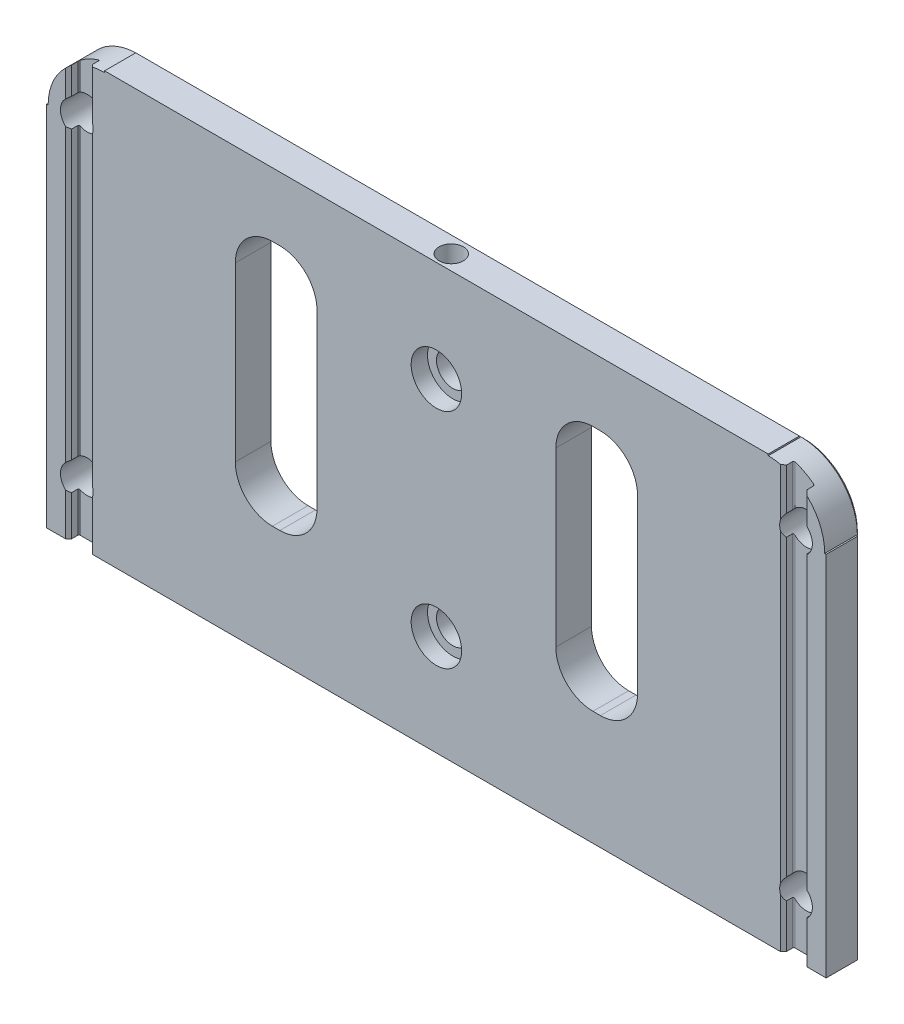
ISO-10303-21;
HEADER;
FILE_DESCRIPTION(('STEP AP214'),'2;1');
FILE_NAME('part.step','',(''),(''),'','','');
FILE_SCHEMA(('AUTOMOTIVE_DESIGN { 1 0 10303 214 1 1 1 1 }'));
ENDSEC;
DATA;
#1=APPLICATION_CONTEXT('core data for automotive mechanical design processes');
#2=APPLICATION_PROTOCOL_DEFINITION('international standard','automotive_design',2000,#1);
#3=PRODUCT_CONTEXT('',#1,'mechanical');
#4=PRODUCT('Part','Part','',(#3));
#5=PRODUCT_RELATED_PRODUCT_CATEGORY('part','',(#4));
#6=PRODUCT_DEFINITION_FORMATION('','',#4);
#7=PRODUCT_DEFINITION_CONTEXT('part definition',#1,'design');
#8=PRODUCT_DEFINITION('design','',#6,#7);
#9=PRODUCT_DEFINITION_SHAPE('','',#8);
#10=(LENGTH_UNIT() NAMED_UNIT(*) SI_UNIT(.MILLI.,.METRE.));
#11=(NAMED_UNIT(*) PLANE_ANGLE_UNIT() SI_UNIT($,.RADIAN.));
#12=(NAMED_UNIT(*) SI_UNIT($,.STERADIAN.) SOLID_ANGLE_UNIT());
#13=UNCERTAINTY_MEASURE_WITH_UNIT(LENGTH_MEASURE(1.E-05),#10,'distance_accuracy_value','');
#14=(GEOMETRIC_REPRESENTATION_CONTEXT(3) GLOBAL_UNCERTAINTY_ASSIGNED_CONTEXT((#13)) GLOBAL_UNIT_ASSIGNED_CONTEXT((#10,
#11,#12)) REPRESENTATION_CONTEXT('',''));
#15=CARTESIAN_POINT('',(0.,0.,0.));
#16=DIRECTION('',(0.,0.,1.));
#17=DIRECTION('',(1.,0.,0.));
#18=AXIS2_PLACEMENT_3D('',#15,#16,#17);
#19=CARTESIAN_POINT('',(-66.6496,-36.322,0.));
#20=DIRECTION('',(0.,0.,1.));
#21=DIRECTION('',(1.,0.,0.));
#22=AXIS2_PLACEMENT_3D('',#19,#20,#21);
#23=PLANE('',#22);
#24=CARTESIAN_POINT('',(56.7436,26.416,0.));
#25=DIRECTION('',(0.,0.,-1.));
#26=DIRECTION('',(-1.,0.,0.));
#27=AXIS2_PLACEMENT_3D('',#24,#25,#26);
#28=CIRCLE('',#27,9.652);
#29=CARTESIAN_POINT('',(63.3984,33.4070472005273,0.));
#30=VERTEX_POINT('',#29);
#31=CARTESIAN_POINT('',(66.3956,26.416,0.));
#32=VERTEX_POINT('',#31);
#33=EDGE_CURVE('E712',#30,#32,#28,.T.);
#34=ORIENTED_EDGE('',*,*,#33,.F.);
#35=DIRECTION('',(0.,-1.,0.));
#36=VECTOR('',#35,1.);
#37=CARTESIAN_POINT('',(63.3984,-36.322,0.));
#38=LINE('',#37,#36);
#39=CARTESIAN_POINT('',(63.3984,28.8408715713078,0.));
#40=VERTEX_POINT('',#39);
#41=EDGE_CURVE('E2169',#30,#40,#38,.T.);
#42=ORIENTED_EDGE('',*,*,#41,.T.);
#43=CARTESIAN_POINT('',(61.4934,26.797,0.));
#44=DIRECTION('',(0.,0.,1.));
#45=DIRECTION('',(1.,0.,0.));
#46=AXIS2_PLACEMENT_3D('',#43,#44,#45);
#47=CIRCLE('',#46,2.794);
#48=CARTESIAN_POINT('',(63.3984,24.7531284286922,0.));
#49=VERTEX_POINT('',#48);
#50=EDGE_CURVE('E654',#49,#40,#47,.T.);
#51=ORIENTED_EDGE('',*,*,#50,.F.);
#52=DIRECTION('',(0.,-1.,0.));
#53=VECTOR('',#52,1.);
#54=CARTESIAN_POINT('',(63.3984,-36.322,0.));
#55=LINE('',#54,#53);
#56=CARTESIAN_POINT('',(63.3984,-25.0071284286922,0.));
#57=VERTEX_POINT('',#56);
#58=EDGE_CURVE('E2163',#49,#57,#55,.T.);
#59=ORIENTED_EDGE('',*,*,#58,.T.);
#60=CARTESIAN_POINT('',(61.4934,-27.051,0.));
#61=DIRECTION('',(0.,0.,1.));
#62=DIRECTION('',(1.,0.,0.));
#63=AXIS2_PLACEMENT_3D('',#60,#61,#62);
#64=CIRCLE('',#63,2.794);
#65=CARTESIAN_POINT('',(63.3984,-29.0948715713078,0.));
#66=VERTEX_POINT('',#65);
#67=EDGE_CURVE('E675',#66,#57,#64,.T.);
#68=ORIENTED_EDGE('',*,*,#67,.F.);
#69=DIRECTION('',(0.,-1.,0.));
#70=VECTOR('',#69,1.);
#71=CARTESIAN_POINT('',(63.3984,-36.322,0.));
#72=LINE('',#71,#70);
#73=CARTESIAN_POINT('',(63.3984,-36.322,0.));
#74=VERTEX_POINT('',#73);
#75=EDGE_CURVE('E2166',#66,#74,#72,.T.);
#76=ORIENTED_EDGE('',*,*,#75,.T.);
#77=DIRECTION('',(1.,0.,0.));
#78=VECTOR('',#77,1.);
#79=CARTESIAN_POINT('',(-66.6496,-36.322,0.));
#80=LINE('',#79,#78);
#81=CARTESIAN_POINT('',(66.6496,-36.322,0.));
#82=VERTEX_POINT('',#81);
#83=EDGE_CURVE('E730',#74,#82,#80,.T.);
#84=ORIENTED_EDGE('',*,*,#83,.T.);
#85=DIRECTION('',(0.,1.,0.));
#86=VECTOR('',#85,1.);
#87=CARTESIAN_POINT('',(66.6496,36.322,0.));
#88=LINE('',#87,#86);
#89=CARTESIAN_POINT('',(66.6496,26.416,0.));
#90=VERTEX_POINT('',#89);
#91=EDGE_CURVE('E734',#82,#90,#88,.T.);
#92=ORIENTED_EDGE('',*,*,#91,.T.);
#93=DIRECTION('',(1.,0.,0.));
#94=VECTOR('',#93,1.);
#95=CARTESIAN_POINT('',(66.3956,26.416,0.));
#96=LINE('',#95,#94);
#97=EDGE_CURVE('E716',#32,#90,#96,.T.);
#98=ORIENTED_EDGE('',*,*,#97,.F.);
#99=EDGE_LOOP('',(#34,#42,#51,#59,#68,#76,#84,#92,#98));
#100=FACE_BOUND('',#99,.T.);
#101=ADVANCED_FACE('F15',(#100),#23,.T.);
#102=DIRECTION('',(0.,1.,0.));
#103=VECTOR('',#102,1.);
#104=CARTESIAN_POINT('',(20.4216,19.05,0.));
#105=LINE('',#104,#103);
#106=CARTESIAN_POINT('',(20.4216,-10.414,0.));
#107=VERTEX_POINT('',#106);
#108=CARTESIAN_POINT('',(20.4216,19.05,0.));
#109=VERTEX_POINT('',#108);
#110=EDGE_CURVE('E567',#107,#109,#105,.T.);
#111=ORIENTED_EDGE('',*,*,#110,.T.);
#112=CARTESIAN_POINT('',(26.7716,19.05,0.));
#113=DIRECTION('',(0.,0.,-1.));
#114=DIRECTION('',(-1.,0.,0.));
#115=AXIS2_PLACEMENT_3D('',#112,#113,#114);
#116=CIRCLE('',#115,6.35);
#117=CARTESIAN_POINT('',(26.7716,25.4,0.));
#118=VERTEX_POINT('',#117);
#119=EDGE_CURVE('E545',#109,#118,#116,.T.);
#120=ORIENTED_EDGE('',*,*,#119,.T.);
#121=DIRECTION('',(1.,0.,0.));
#122=VECTOR('',#121,1.);
#123=CARTESIAN_POINT('',(28.0416,25.4,0.));
#124=LINE('',#123,#122);
#125=CARTESIAN_POINT('',(28.0416,25.4,0.));
#126=VERTEX_POINT('',#125);
#127=EDGE_CURVE('E549',#118,#126,#124,.T.);
#128=ORIENTED_EDGE('',*,*,#127,.T.);
#129=CARTESIAN_POINT('',(28.0416,19.05,0.));
#130=DIRECTION('',(0.,0.,-1.));
#131=DIRECTION('',(-1.,0.,0.));
#132=AXIS2_PLACEMENT_3D('',#129,#130,#131);
#133=CIRCLE('',#132,6.35);
#134=CARTESIAN_POINT('',(34.3916,19.05,0.));
#135=VERTEX_POINT('',#134);
#136=EDGE_CURVE('E582',#126,#135,#133,.T.);
#137=ORIENTED_EDGE('',*,*,#136,.T.);
#138=DIRECTION('',(0.,-1.,0.));
#139=VECTOR('',#138,1.);
#140=CARTESIAN_POINT('',(34.3916,19.05,0.));
#141=LINE('',#140,#139);
#142=CARTESIAN_POINT('',(34.3916,-10.414,0.));
#143=VERTEX_POINT('',#142);
#144=EDGE_CURVE('E579',#135,#143,#141,.T.);
#145=ORIENTED_EDGE('',*,*,#144,.T.);
#146=CARTESIAN_POINT('',(28.0416,-10.414,0.));
#147=DIRECTION('',(0.,0.,-1.));
#148=DIRECTION('',(-1.,0.,0.));
#149=AXIS2_PLACEMENT_3D('',#146,#147,#148);
#150=CIRCLE('',#149,6.35);
#151=CARTESIAN_POINT('',(28.0416,-16.764,0.));
#152=VERTEX_POINT('',#151);
#153=EDGE_CURVE('E576',#143,#152,#150,.T.);
#154=ORIENTED_EDGE('',*,*,#153,.T.);
#155=DIRECTION('',(-1.,0.,0.));
#156=VECTOR('',#155,1.);
#157=CARTESIAN_POINT('',(28.0416,-16.764,0.));
#158=LINE('',#157,#156);
#159=CARTESIAN_POINT('',(26.7716,-16.764,0.));
#160=VERTEX_POINT('',#159);
#161=EDGE_CURVE('E573',#152,#160,#158,.T.);
#162=ORIENTED_EDGE('',*,*,#161,.T.);
#163=CARTESIAN_POINT('',(26.7716,-10.414,0.));
#164=DIRECTION('',(0.,0.,-1.));
#165=DIRECTION('',(-1.,0.,0.));
#166=AXIS2_PLACEMENT_3D('',#163,#164,#165);
#167=CIRCLE('',#166,6.35);
#168=EDGE_CURVE('E570',#160,#107,#167,.T.);
#169=ORIENTED_EDGE('',*,*,#168,.T.);
#170=EDGE_LOOP('',(#111,#120,#128,#137,#145,#154,#162,#169));
#171=FACE_BOUND('',#170,.T.);
#172=CARTESIAN_POINT('',(-26.7716,19.05,0.));
#173=DIRECTION('',(0.,0.,1.));
#174=DIRECTION('',(1.,0.,0.));
#175=AXIS2_PLACEMENT_3D('',#172,#173,#174);
#176=CIRCLE('',#175,6.35);
#177=CARTESIAN_POINT('',(-20.4216,19.05,0.));
#178=VERTEX_POINT('',#177);
#179=CARTESIAN_POINT('',(-26.7716,25.4,0.));
#180=VERTEX_POINT('',#179);
#181=EDGE_CURVE('E590',#178,#180,#176,.T.);
#182=ORIENTED_EDGE('',*,*,#181,.F.);
#183=DIRECTION('',(0.,1.,0.));
#184=VECTOR('',#183,1.);
#185=CARTESIAN_POINT('',(-20.4216,19.05,0.));
#186=LINE('',#185,#184);
#187=CARTESIAN_POINT('',(-20.4216,-10.414,0.));
#188=VERTEX_POINT('',#187);
#189=EDGE_CURVE('E609',#188,#178,#186,.T.);
#190=ORIENTED_EDGE('',*,*,#189,.F.);
#191=CARTESIAN_POINT('',(-26.7716,-10.414,0.));
#192=DIRECTION('',(0.,0.,1.));
#193=DIRECTION('',(1.,0.,0.));
#194=AXIS2_PLACEMENT_3D('',#191,#192,#193);
#195=CIRCLE('',#194,6.35);
#196=CARTESIAN_POINT('',(-26.7716,-16.764,0.));
#197=VERTEX_POINT('',#196);
#198=EDGE_CURVE('E647',#197,#188,#195,.T.);
#199=ORIENTED_EDGE('',*,*,#198,.F.);
#200=DIRECTION('',(1.,0.,0.));
#201=VECTOR('',#200,1.);
#202=CARTESIAN_POINT('',(-28.0416,-16.764,0.));
#203=LINE('',#202,#201);
#204=CARTESIAN_POINT('',(-28.0416,-16.764,0.));
#205=VERTEX_POINT('',#204);
#206=EDGE_CURVE('E644',#205,#197,#203,.T.);
#207=ORIENTED_EDGE('',*,*,#206,.F.);
#208=CARTESIAN_POINT('',(-28.0416,-10.414,0.));
#209=DIRECTION('',(0.,0.,1.));
#210=DIRECTION('',(1.,0.,0.));
#211=AXIS2_PLACEMENT_3D('',#208,#209,#210);
#212=CIRCLE('',#211,6.35);
#213=CARTESIAN_POINT('',(-34.3916,-10.414,0.));
#214=VERTEX_POINT('',#213);
#215=EDGE_CURVE('E641',#214,#205,#212,.T.);
#216=ORIENTED_EDGE('',*,*,#215,.F.);
#217=DIRECTION('',(0.,-1.,0.));
#218=VECTOR('',#217,1.);
#219=CARTESIAN_POINT('',(-34.3916,19.05,0.));
#220=LINE('',#219,#218);
#221=CARTESIAN_POINT('',(-34.3916,19.05,0.));
#222=VERTEX_POINT('',#221);
#223=EDGE_CURVE('E638',#222,#214,#220,.T.);
#224=ORIENTED_EDGE('',*,*,#223,.F.);
#225=CARTESIAN_POINT('',(-28.0416,19.05,0.));
#226=DIRECTION('',(0.,0.,1.));
#227=DIRECTION('',(1.,0.,0.));
#228=AXIS2_PLACEMENT_3D('',#225,#226,#227);
#229=CIRCLE('',#228,6.35);
#230=CARTESIAN_POINT('',(-28.0416,25.4,0.));
#231=VERTEX_POINT('',#230);
#232=EDGE_CURVE('E635',#231,#222,#229,.T.);
#233=ORIENTED_EDGE('',*,*,#232,.F.);
#234=DIRECTION('',(-1.,0.,0.));
#235=VECTOR('',#234,1.);
#236=CARTESIAN_POINT('',(-28.0416,25.4,0.));
#237=LINE('',#236,#235);
#238=EDGE_CURVE('E632',#180,#231,#237,.T.);
#239=ORIENTED_EDGE('',*,*,#238,.F.);
#240=EDGE_LOOP('',(#182,#190,#199,#207,#216,#224,#233,#239));
#241=FACE_BOUND('',#240,.T.);
#242=CARTESIAN_POINT('',(0.,-19.05,0.));
#243=DIRECTION('',(0.,0.,1.));
#244=DIRECTION('',(1.,0.,0.));
#245=AXIS2_PLACEMENT_3D('',#242,#243,#244);
#246=CIRCLE('',#245,4.318);
#247=CARTESIAN_POINT('',(4.318,-19.05,0.));
#248=VERTEX_POINT('',#247);
#249=EDGE_CURVE('E542',#248,#248,#246,.T.);
#250=ORIENTED_EDGE('',*,*,#249,.F.);
#251=EDGE_LOOP('',(#250));
#252=FACE_BOUND('',#251,.T.);
#253=CARTESIAN_POINT('',(0.,19.05,0.));
#254=DIRECTION('',(0.,0.,1.));
#255=DIRECTION('',(1.,0.,0.));
#256=AXIS2_PLACEMENT_3D('',#253,#254,#255);
#257=CIRCLE('',#256,4.318);
#258=CARTESIAN_POINT('',(4.318,19.05,0.));
#259=VERTEX_POINT('',#258);
#260=EDGE_CURVE('E530',#259,#259,#257,.T.);
#261=ORIENTED_EDGE('',*,*,#260,.F.);
#262=EDGE_LOOP('',(#261));
#263=FACE_BOUND('',#262,.T.);
#264=CARTESIAN_POINT('',(58.8264,27.6297946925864,0.));
#265=VERTEX_POINT('',#264);
#266=CARTESIAN_POINT('',(58.8264,25.9642053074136,0.));
#267=VERTEX_POINT('',#266);
#268=EDGE_CURVE('E671',#265,#267,#47,.T.);
#269=ORIENTED_EDGE('',*,*,#268,.F.);
#270=DIRECTION('',(0.,1.,0.));
#271=VECTOR('',#270,1.);
#272=CARTESIAN_POINT('',(58.8264,-36.322,0.));
#273=LINE('',#272,#271);
#274=CARTESIAN_POINT('',(58.8264,35.8405980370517,0.));
#275=VERTEX_POINT('',#274);
#276=EDGE_CURVE('E2146',#265,#275,#273,.T.);
#277=ORIENTED_EDGE('',*,*,#276,.T.);
#278=CARTESIAN_POINT('',(56.7436,36.068,0.));
#279=VERTEX_POINT('',#278);
#280=EDGE_CURVE('E713',#279,#275,#28,.T.);
#281=ORIENTED_EDGE('',*,*,#280,.F.);
#282=DIRECTION('',(0.,-1.,0.));
#283=VECTOR('',#282,1.);
#284=CARTESIAN_POINT('',(56.7436,-36.3220000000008,0.));
#285=LINE('',#284,#283);
#286=CARTESIAN_POINT('',(56.7436,36.322,0.));
#287=VERTEX_POINT('',#286);
#288=EDGE_CURVE('E744',#287,#279,#285,.T.);
#289=ORIENTED_EDGE('',*,*,#288,.F.);
#290=DIRECTION('',(-1.,0.,0.));
#291=VECTOR('',#290,1.);
#292=CARTESIAN_POINT('',(-66.6496,36.322,0.));
#293=LINE('',#292,#291);
#294=CARTESIAN_POINT('',(-56.7436,36.322,0.));
#295=VERTEX_POINT('',#294);
#296=EDGE_CURVE('E738',#287,#295,#293,.T.);
#297=ORIENTED_EDGE('',*,*,#296,.T.);
#298=DIRECTION('',(0.,-1.,0.));
#299=VECTOR('',#298,1.);
#300=CARTESIAN_POINT('',(-56.7436,-36.322,0.));
#301=LINE('',#300,#299);
#302=CARTESIAN_POINT('',(-56.7436,36.068,0.));
#303=VERTEX_POINT('',#302);
#304=EDGE_CURVE('E748',#295,#303,#301,.T.);
#305=ORIENTED_EDGE('',*,*,#304,.T.);
#306=CARTESIAN_POINT('',(-56.7436,26.416,0.));
#307=DIRECTION('',(0.,0.,1.));
#308=DIRECTION('',(1.,0.,0.));
#309=AXIS2_PLACEMENT_3D('',#306,#307,#308);
#310=CIRCLE('',#309,9.652);
#311=CARTESIAN_POINT('',(-58.8264,35.8405980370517,0.));
#312=VERTEX_POINT('',#311);
#313=EDGE_CURVE('E700',#303,#312,#310,.T.);
#314=ORIENTED_EDGE('',*,*,#313,.T.);
#315=DIRECTION('',(0.,-1.,0.));
#316=VECTOR('',#315,1.);
#317=CARTESIAN_POINT('',(-58.8264,28.5704584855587,0.));
#318=LINE('',#317,#316);
#319=CARTESIAN_POINT('',(-58.8264,27.6297946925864,0.));
#320=VERTEX_POINT('',#319);
#321=EDGE_CURVE('E1064',#312,#320,#318,.T.);
#322=ORIENTED_EDGE('',*,*,#321,.T.);
#323=CARTESIAN_POINT('',(-61.4934,26.797,0.));
#324=DIRECTION('',(0.,0.,1.));
#325=DIRECTION('',(1.,0.,0.));
#326=AXIS2_PLACEMENT_3D('',#323,#324,#325);
#327=CIRCLE('',#326,2.794);
#328=CARTESIAN_POINT('',(-58.8264,25.9642053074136,0.));
#329=VERTEX_POINT('',#328);
#330=EDGE_CURVE('E682',#329,#320,#327,.T.);
#331=ORIENTED_EDGE('',*,*,#330,.F.);
#332=DIRECTION('',(0.,-1.,0.));
#333=VECTOR('',#332,1.);
#334=CARTESIAN_POINT('',(-58.8264,-25.2775415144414,0.));
#335=LINE('',#334,#333);
#336=CARTESIAN_POINT('',(-58.8264,-26.2182053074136,0.));
#337=VERTEX_POINT('',#336);
#338=EDGE_CURVE('E2136',#329,#337,#335,.T.);
#339=ORIENTED_EDGE('',*,*,#338,.T.);
#340=CARTESIAN_POINT('',(-61.4934,-27.051,0.));
#341=DIRECTION('',(0.,0.,1.));
#342=DIRECTION('',(1.,0.,0.));
#343=AXIS2_PLACEMENT_3D('',#340,#341,#342);
#344=CIRCLE('',#343,2.794);
#345=CARTESIAN_POINT('',(-58.8264,-27.8837946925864,0.));
#346=VERTEX_POINT('',#345);
#347=EDGE_CURVE('E689',#346,#337,#344,.T.);
#348=ORIENTED_EDGE('',*,*,#347,.F.);
#349=DIRECTION('',(0.,-1.,0.));
#350=VECTOR('',#349,1.);
#351=CARTESIAN_POINT('',(-58.8264,-36.322,0.));
#352=LINE('',#351,#350);
#353=CARTESIAN_POINT('',(-58.8264,-36.322,0.));
#354=VERTEX_POINT('',#353);
#355=EDGE_CURVE('E2126',#346,#354,#352,.T.);
#356=ORIENTED_EDGE('',*,*,#355,.T.);
#357=CARTESIAN_POINT('',(58.8264,-36.322,0.));
#358=VERTEX_POINT('',#357);
#359=EDGE_CURVE('E735',#354,#358,#80,.T.);
#360=ORIENTED_EDGE('',*,*,#359,.T.);
#361=DIRECTION('',(0.,1.,0.));
#362=VECTOR('',#361,1.);
#363=CARTESIAN_POINT('',(58.8264,-36.322,0.));
#364=LINE('',#363,#362);
#365=CARTESIAN_POINT('',(58.8264,-27.8837946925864,0.));
#366=VERTEX_POINT('',#365);
#367=EDGE_CURVE('E2143',#358,#366,#364,.T.);
#368=ORIENTED_EDGE('',*,*,#367,.T.);
#369=CARTESIAN_POINT('',(58.8264,-26.2182053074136,0.));
#370=VERTEX_POINT('',#369);
#371=EDGE_CURVE('E678',#370,#366,#64,.T.);
#372=ORIENTED_EDGE('',*,*,#371,.F.);
#373=DIRECTION('',(0.,1.,0.));
#374=VECTOR('',#373,1.);
#375=CARTESIAN_POINT('',(58.8264,-36.322,0.));
#376=LINE('',#375,#374);
#377=EDGE_CURVE('E2138',#370,#267,#376,.T.);
#378=ORIENTED_EDGE('',*,*,#377,.T.);
#379=EDGE_LOOP('',(#269,#277,#281,#289,#297,#305,#314,#322,#331,#339,#348,#356,#360,#368,#372,#378));
#380=FACE_BOUND('',#379,.T.);
#381=ADVANCED_FACE('F1083',(#171,#241,#252,#263,#380),#23,.T.);
#382=CARTESIAN_POINT('',(-66.6496,-36.322,-6.096));
#383=DIRECTION('',(0.,-1.,0.));
#384=DIRECTION('',(0.,0.,-1.));
#385=AXIS2_PLACEMENT_3D('',#382,#383,#384);
#386=PLANE('',#385);
#387=DIRECTION('',(0.,0.,1.));
#388=VECTOR('',#387,1.);
#389=CARTESIAN_POINT('',(-66.6496,-36.322,-6.096));
#390=LINE('',#389,#388);
#391=CARTESIAN_POINT('',(-66.6496,-36.322,-5.334));
#392=VERTEX_POINT('',#391);
#393=CARTESIAN_POINT('',(-66.6496,-36.322,0.));
#394=VERTEX_POINT('',#393);
#395=EDGE_CURVE('E741',#392,#394,#390,.T.);
#396=ORIENTED_EDGE('',*,*,#395,.F.);
#397=DIRECTION('',(1.,0.,0.));
#398=VECTOR('',#397,1.);
#399=CARTESIAN_POINT('',(66.6496,-36.322,-5.334));
#400=LINE('',#399,#398);
#401=CARTESIAN_POINT('',(66.6496,-36.322,-5.334));
#402=VERTEX_POINT('',#401);
#403=EDGE_CURVE('E1182',#392,#402,#400,.T.);
#404=ORIENTED_EDGE('',*,*,#403,.T.);
#405=DIRECTION('',(0.,0.,1.));
#406=VECTOR('',#405,1.);
#407=CARTESIAN_POINT('',(66.6496,-36.322,-6.096));
#408=LINE('',#407,#406);
#409=EDGE_CURVE('E742',#402,#82,#408,.T.);
#410=ORIENTED_EDGE('',*,*,#409,.T.);
#411=ORIENTED_EDGE('',*,*,#83,.F.);
#412=DIRECTION('',(0.707106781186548,0.,0.707106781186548));
#413=VECTOR('',#412,1.);
#414=CARTESIAN_POINT('',(-4.6736,-36.322,-68.072));
#415=LINE('',#414,#413);
#416=CARTESIAN_POINT('',(62.8904,-36.322,-0.507999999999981));
#417=VERTEX_POINT('',#416);
#418=EDGE_CURVE('E2177',#74,#417,#415,.F.);
#419=ORIENTED_EDGE('',*,*,#418,.T.);
#420=DIRECTION('',(0.,0.,-1.));
#421=VECTOR('',#420,1.);
#422=CARTESIAN_POINT('',(62.8904,-36.322,-6.096));
#423=LINE('',#422,#421);
#424=CARTESIAN_POINT('',(62.8904,-36.322,-1.5748));
#425=VERTEX_POINT('',#424);
#426=EDGE_CURVE('E2055',#417,#425,#423,.T.);
#427=ORIENTED_EDGE('',*,*,#426,.T.);
#428=CARTESIAN_POINT('',(62.6872,-36.322,-1.5748));
#429=DIRECTION('',(0.,-1.,0.));
#430=DIRECTION('',(0.,0.,-1.));
#431=AXIS2_PLACEMENT_3D('',#428,#429,#430);
#432=CIRCLE('',#431,0.2032);
#433=CARTESIAN_POINT('',(62.6872,-36.322,-1.778));
#434=VERTEX_POINT('',#433);
#435=EDGE_CURVE('E843',#425,#434,#432,.F.);
#436=ORIENTED_EDGE('',*,*,#435,.T.);
#437=DIRECTION('',(-1.,0.,0.));
#438=VECTOR('',#437,1.);
#439=CARTESIAN_POINT('',(-66.6496,-36.322,-1.778));
#440=LINE('',#439,#438);
#441=CARTESIAN_POINT('',(59.5376,-36.322,-1.778));
#442=VERTEX_POINT('',#441);
#443=EDGE_CURVE('E2272',#434,#442,#440,.T.);
#444=ORIENTED_EDGE('',*,*,#443,.T.);
#445=CARTESIAN_POINT('',(59.5376,-36.322,-1.5748));
#446=DIRECTION('',(0.,-1.,0.));
#447=DIRECTION('',(0.,0.,-1.));
#448=AXIS2_PLACEMENT_3D('',#445,#446,#447);
#449=CIRCLE('',#448,0.2032);
#450=CARTESIAN_POINT('',(59.3344,-36.322,-1.5748));
#451=VERTEX_POINT('',#450);
#452=EDGE_CURVE('E955',#442,#451,#449,.F.);
#453=ORIENTED_EDGE('',*,*,#452,.T.);
#454=DIRECTION('',(0.,0.,1.));
#455=VECTOR('',#454,1.);
#456=CARTESIAN_POINT('',(59.3344,-36.322,-6.096));
#457=LINE('',#456,#455);
#458=CARTESIAN_POINT('',(59.3344,-36.322,-0.507999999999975));
#459=VERTEX_POINT('',#458);
#460=EDGE_CURVE('E2227',#451,#459,#457,.T.);
#461=ORIENTED_EDGE('',*,*,#460,.T.);
#462=DIRECTION('',(0.707106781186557,0.,-0.707106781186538));
#463=VECTOR('',#462,1.);
#464=CARTESIAN_POINT('',(-0.863600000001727,-36.322,59.69));
#465=LINE('',#464,#463);
#466=EDGE_CURVE('E2175',#459,#358,#465,.F.);
#467=ORIENTED_EDGE('',*,*,#466,.T.);
#468=ORIENTED_EDGE('',*,*,#359,.F.);
#469=DIRECTION('',(-0.707106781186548,0.,-0.707106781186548));
#470=VECTOR('',#469,1.);
#471=CARTESIAN_POINT('',(-65.786,-36.322,-6.9596));
#472=LINE('',#471,#470);
#473=CARTESIAN_POINT('',(-59.3344,-36.322,-0.508000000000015));
#474=VERTEX_POINT('',#473);
#475=EDGE_CURVE('E2125',#354,#474,#472,.T.);
#476=ORIENTED_EDGE('',*,*,#475,.T.);
#477=DIRECTION('',(0.,0.,1.));
#478=VECTOR('',#477,1.);
#479=CARTESIAN_POINT('',(-59.3344,-36.322,-6.096));
#480=LINE('',#479,#478);
#481=CARTESIAN_POINT('',(-59.3344,-36.322,-1.5748));
#482=VERTEX_POINT('',#481);
#483=EDGE_CURVE('E2080',#482,#474,#480,.T.);
#484=ORIENTED_EDGE('',*,*,#483,.F.);
#485=CARTESIAN_POINT('',(-59.5376,-36.322,-1.5748));
#486=DIRECTION('',(0.,-1.,0.));
#487=DIRECTION('',(0.,0.,-1.));
#488=AXIS2_PLACEMENT_3D('',#485,#486,#487);
#489=CIRCLE('',#488,0.2032);
#490=CARTESIAN_POINT('',(-59.5376,-36.322,-1.778));
#491=VERTEX_POINT('',#490);
#492=EDGE_CURVE('E964',#482,#491,#489,.F.);
#493=ORIENTED_EDGE('',*,*,#492,.T.);
#494=DIRECTION('',(-1.,0.,0.));
#495=VECTOR('',#494,1.);
#496=CARTESIAN_POINT('',(-66.6496,-36.322,-1.778));
#497=LINE('',#496,#495);
#498=CARTESIAN_POINT('',(-62.6872,-36.322,-1.778));
#499=VERTEX_POINT('',#498);
#500=EDGE_CURVE('E2070',#491,#499,#497,.T.);
#501=ORIENTED_EDGE('',*,*,#500,.T.);
#502=CARTESIAN_POINT('',(-62.6872,-36.322,-1.5748));
#503=DIRECTION('',(0.,-1.,0.));
#504=DIRECTION('',(0.,0.,-1.));
#505=AXIS2_PLACEMENT_3D('',#502,#503,#504);
#506=CIRCLE('',#505,0.2032);
#507=CARTESIAN_POINT('',(-62.8904,-36.322,-1.5748));
#508=VERTEX_POINT('',#507);
#509=EDGE_CURVE('E1025',#499,#508,#506,.F.);
#510=ORIENTED_EDGE('',*,*,#509,.T.);
#511=DIRECTION('',(0.,0.,-1.));
#512=VECTOR('',#511,1.);
#513=CARTESIAN_POINT('',(-62.8904,-36.322,-6.096));
#514=LINE('',#513,#512);
#515=CARTESIAN_POINT('',(-62.8904,-36.322,-0.508));
#516=VERTEX_POINT('',#515);
#517=EDGE_CURVE('E507',#516,#508,#514,.T.);
#518=ORIENTED_EDGE('',*,*,#517,.F.);
#519=DIRECTION('',(-0.707106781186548,0.,0.707106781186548));
#520=VECTOR('',#519,1.);
#521=CARTESIAN_POINT('',(-61.976,-36.322,-1.4224));
#522=LINE('',#521,#520);
#523=CARTESIAN_POINT('',(-63.3984,-36.322,0.));
#524=VERTEX_POINT('',#523);
#525=EDGE_CURVE('E1112',#516,#524,#522,.T.);
#526=ORIENTED_EDGE('',*,*,#525,.T.);
#527=EDGE_CURVE('E731',#394,#524,#80,.T.);
#528=ORIENTED_EDGE('',*,*,#527,.F.);
#529=EDGE_LOOP('',(#396,#404,#410,#411,#419,#427,#436,#444,#453,#461,#467,#468,#476,#484,#493,
#501,#510,#518,#526,#528));
#530=FACE_BOUND('',#529,.T.);
#531=ADVANCED_FACE('F1089',(#530),#386,.T.);
#532=CARTESIAN_POINT('',(56.7436,26.416,-6.096));
#533=DIRECTION('',(0.,0.,1.));
#534=DIRECTION('',(1.,0.,0.));
#535=AXIS2_PLACEMENT_3D('',#532,#533,#534);
#536=CYLINDRICAL_SURFACE('',#535,9.652);
#537=DIRECTION('',(0.,0.,1.));
#538=VECTOR('',#537,1.);
#539=CARTESIAN_POINT('',(66.3956,26.416,-6.096));
#540=LINE('',#539,#538);
#541=CARTESIAN_POINT('',(66.3956,26.416,-5.588));
#542=VERTEX_POINT('',#541);
#543=EDGE_CURVE('E719',#542,#32,#540,.T.);
#544=ORIENTED_EDGE('',*,*,#543,.F.);
#545=CARTESIAN_POINT('',(56.7436,26.416,-5.588));
#546=DIRECTION('',(0.,0.,1.));
#547=DIRECTION('',(1.,0.,0.));
#548=AXIS2_PLACEMENT_3D('',#545,#546,#547);
#549=CIRCLE('',#548,9.652);
#550=CARTESIAN_POINT('',(56.7436,36.068,-5.588));
#551=VERTEX_POINT('',#550);
#552=EDGE_CURVE('E9',#542,#551,#549,.T.);
#553=ORIENTED_EDGE('',*,*,#552,.T.);
#554=DIRECTION('',(0.,0.,1.));
#555=VECTOR('',#554,1.);
#556=CARTESIAN_POINT('',(56.7436,36.068,-6.096));
#557=LINE('',#556,#555);
#558=EDGE_CURVE('E718',#551,#279,#557,.T.);
#559=ORIENTED_EDGE('',*,*,#558,.T.);
#560=ORIENTED_EDGE('',*,*,#280,.T.);
#561=CARTESIAN_POINT('',(56.7436,26.416,2.08279999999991));
#562=DIRECTION('',(-0.707106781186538,0.,-0.707106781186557));
#563=DIRECTION('',(-0.707106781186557,0.,0.707106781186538));
#564=AXIS2_PLACEMENT_3D('',#561,#562,#563);
#565=ELLIPSE('',#564,13.6499893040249,9.652);
#566=CARTESIAN_POINT('',(59.3344,35.7137878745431,-0.508));
#567=VERTEX_POINT('',#566);
#568=EDGE_CURVE('E2151',#275,#567,#565,.T.);
#569=ORIENTED_EDGE('',*,*,#568,.T.);
#570=DIRECTION('',(0.,0.,1.));
#571=VECTOR('',#570,1.);
#572=CARTESIAN_POINT('',(59.3344,35.7137878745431,-6.096));
#573=LINE('',#572,#571);
#574=CARTESIAN_POINT('',(59.3344,35.7137878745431,-1.5748));
#575=VERTEX_POINT('',#574);
#576=EDGE_CURVE('E2224',#575,#567,#573,.T.);
#577=ORIENTED_EDGE('',*,*,#576,.F.);
#578=CARTESIAN_POINT('',(59.3344,35.7137878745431,-1.5748));
#579=CARTESIAN_POINT('',(59.3343889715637,35.7137903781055,-1.58592168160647));
#580=CARTESIAN_POINT('',(59.3353123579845,35.7135336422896,-1.59703818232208));
#581=CARTESIAN_POINT('',(59.3389439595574,35.7125208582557,-1.61893295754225));
#582=CARTESIAN_POINT('',(59.3416490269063,35.7117656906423,-1.62971179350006));
#583=CARTESIAN_POINT('',(59.3487610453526,35.7097749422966,-1.65064627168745));
#584=CARTESIAN_POINT('',(59.3531682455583,35.708539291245,-1.66080182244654));
#585=CARTESIAN_POINT('',(59.3635347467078,35.7056218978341,-1.68021618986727));
#586=CARTESIAN_POINT('',(59.369494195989,35.7039401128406,-1.68947492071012));
#587=CARTESIAN_POINT('',(59.3828769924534,35.7001461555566,-1.70699051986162));
#588=CARTESIAN_POINT('',(59.3903208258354,35.698027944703,-1.71523040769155));
#589=CARTESIAN_POINT('',(59.4063873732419,35.6934316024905,-1.73034809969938));
#590=CARTESIAN_POINT('',(59.4150103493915,35.6909533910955,-1.73722560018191));
#591=CARTESIAN_POINT('',(59.433506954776,35.6856062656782,-1.74968147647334));
#592=CARTESIAN_POINT('',(59.4434138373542,35.6827266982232,-1.7552058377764));
#593=CARTESIAN_POINT('',(59.4639441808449,35.6767205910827,-1.76451580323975));
#594=CARTESIAN_POINT('',(59.4745676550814,35.6735940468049,-1.76830137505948));
#595=CARTESIAN_POINT('',(59.4939353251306,35.6678559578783,-1.77344955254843));
#596=CARTESIAN_POINT('',(59.5025994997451,35.6652760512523,-1.77515598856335));
#597=CARTESIAN_POINT('',(59.5200432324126,35.6600549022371,-1.77743122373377));
#598=CARTESIAN_POINT('',(59.5288225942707,35.6574137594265,-1.77800175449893));
#599=CARTESIAN_POINT('',(59.5376,35.6547590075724,-1.778));
#600=B_SPLINE_CURVE_WITH_KNOTS('',3,(#578,#579,#580,#581,#582,#583,#584,#585,#586,#587,#588,
#589,#590,#591,#592,#593,#594,#595,#596,#597,#598,#599),.UNSPECIFIED.,.F.,.F.,(4,2,2,2,2,2,2,2,
2,2,4),(0.,0.0333159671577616,0.0665732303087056,0.0998353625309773,0.133100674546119,
0.166861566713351,0.200629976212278,0.235582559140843,0.270535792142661,0.298066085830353,
0.32555437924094),.UNSPECIFIED.);
#601=CARTESIAN_POINT('',(59.5376,35.6547590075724,-1.778));
#602=VERTEX_POINT('',#601);
#603=EDGE_CURVE('E916',#575,#602,#600,.T.);
#604=ORIENTED_EDGE('',*,*,#603,.T.);
#605=CARTESIAN_POINT('',(56.7436,26.416,-1.778));
#606=DIRECTION('',(0.,0.,1.));
#607=DIRECTION('',(1.,0.,0.));
#608=AXIS2_PLACEMENT_3D('',#605,#606,#607);
#609=CIRCLE('',#608,9.652);
#610=CARTESIAN_POINT('',(62.6872,34.0209144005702,-1.778));
#611=VERTEX_POINT('',#610);
#612=EDGE_CURVE('E2276',#611,#602,#609,.T.);
#613=ORIENTED_EDGE('',*,*,#612,.F.);
#614=CARTESIAN_POINT('',(62.6872,34.0209144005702,-1.778));
#615=CARTESIAN_POINT('',(62.7007198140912,34.0103502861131,-1.7779911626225));
#616=CARTESIAN_POINT('',(62.7142260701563,33.9997342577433,-1.77664930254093));
#617=CARTESIAN_POINT('',(62.7409259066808,33.9786363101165,-1.77124719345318));
#618=CARTESIAN_POINT('',(62.7541170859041,33.9681555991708,-1.76717046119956));
#619=CARTESIAN_POINT('',(62.7781630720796,33.9489517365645,-1.75691287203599));
#620=CARTESIAN_POINT('',(62.7891064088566,33.940170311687,-1.75104999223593));
#621=CARTESIAN_POINT('',(62.8100629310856,33.9232838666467,-1.73713486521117));
#622=CARTESIAN_POINT('',(62.8200782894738,33.9151772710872,-1.72908791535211));
#623=CARTESIAN_POINT('',(62.8367091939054,33.9016671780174,-1.71279031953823));
#624=CARTESIAN_POINT('',(62.8435874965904,33.8960617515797,-1.7049756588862));
#625=CARTESIAN_POINT('',(62.8562698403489,33.8857013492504,-1.68801391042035));
#626=CARTESIAN_POINT('',(62.8620748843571,33.8809455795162,-1.67886808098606));
#627=CARTESIAN_POINT('',(62.8714215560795,33.8732741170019,-1.66103228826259));
#628=CARTESIAN_POINT('',(62.8751805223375,33.8701828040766,-1.65253218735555));
#629=CARTESIAN_POINT('',(62.881551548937,33.8649376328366,-1.63484716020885));
#630=CARTESIAN_POINT('',(62.8841657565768,33.8627820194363,-1.62566355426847));
#631=CARTESIAN_POINT('',(62.8875315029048,33.8600051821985,-1.60951253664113));
#632=CARTESIAN_POINT('',(62.8886009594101,33.8591222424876,-1.60265463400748));
#633=CARTESIAN_POINT('',(62.890038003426,33.8579355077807,-1.58880015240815));
#634=CARTESIAN_POINT('',(62.8904039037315,33.8576331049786,-1.58180328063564));
#635=CARTESIAN_POINT('',(62.8904,33.8576364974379,-1.5748));
#636=B_SPLINE_CURVE_WITH_KNOTS('',3,(#614,#615,#616,#617,#618,#619,#620,#621,#622,#623,#624,
#625,#626,#627,#628,#629,#630,#631,#632,#633,#634,#635),.UNSPECIFIED.,.F.,.F.,(4,2,2,2,2,2,2,2,
2,2,4),(0.,0.0514588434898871,0.103230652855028,0.14867634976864,0.194012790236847,
0.229354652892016,0.264663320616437,0.293929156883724,0.323139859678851,0.344072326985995,
0.365054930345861),.UNSPECIFIED.);
#637=CARTESIAN_POINT('',(62.8904,33.8576364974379,-1.5748));
#638=VERTEX_POINT('',#637);
#639=EDGE_CURVE('E2033',#611,#638,#636,.T.);
#640=ORIENTED_EDGE('',*,*,#639,.T.);
#641=DIRECTION('',(0.,0.,1.));
#642=VECTOR('',#641,1.);
#643=CARTESIAN_POINT('',(62.8904,33.8576364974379,-6.096));
#644=LINE('',#643,#642);
#645=CARTESIAN_POINT('',(62.8904,33.8576364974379,-0.507999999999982));
#646=VERTEX_POINT('',#645);
#647=EDGE_CURVE('E2052',#646,#638,#644,.F.);
#648=ORIENTED_EDGE('',*,*,#647,.F.);
#649=CARTESIAN_POINT('',(56.7436,26.416,-6.6548));
#650=DIRECTION('',(0.707106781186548,0.,-0.707106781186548));
#651=DIRECTION('',(0.707106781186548,0.,0.707106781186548));
#652=AXIS2_PLACEMENT_3D('',#649,#650,#651);
#653=ELLIPSE('',#652,13.6499893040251,9.652);
#654=EDGE_CURVE('E2149',#646,#30,#653,.T.);
#655=ORIENTED_EDGE('',*,*,#654,.T.);
#656=ORIENTED_EDGE('',*,*,#33,.T.);
#657=EDGE_LOOP('',(#544,#553,#559,#560,#569,#577,#604,#613,#640,#648,#655,#656));
#658=FACE_BOUND('',#657,.T.);
#659=ADVANCED_FACE('F1212',(#658),#536,.T.);
#660=CARTESIAN_POINT('',(61.4934,-27.051,0.));
#661=DIRECTION('',(0.,0.,1.));
#662=DIRECTION('',(1.,0.,0.));
#663=AXIS2_PLACEMENT_3D('',#660,#661,#662);
#664=CYLINDRICAL_SURFACE('',#663,2.794);
#665=CARTESIAN_POINT('',(61.4934,-27.051,-6.096));
#666=DIRECTION('',(0.,0.,1.));
#667=DIRECTION('',(1.,0.,0.));
#668=AXIS2_PLACEMENT_3D('',#665,#666,#667);
#669=CIRCLE('',#668,2.794);
#670=CARTESIAN_POINT('',(64.2874,-27.051,-6.096));
#671=VERTEX_POINT('',#670);
#672=EDGE_CURVE('E679',#671,#671,#669,.T.);
#673=ORIENTED_EDGE('',*,*,#672,.F.);
#674=EDGE_LOOP('',(#673));
#675=FACE_BOUND('',#674,.T.);
#676=DIRECTION('',(0.,0.,1.));
#677=VECTOR('',#676,1.);
#678=CARTESIAN_POINT('',(62.8904,-29.4706749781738,0.));
#679=LINE('',#678,#677);
#680=CARTESIAN_POINT('',(62.8904,-29.4706749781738,-0.507999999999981));
#681=VERTEX_POINT('',#680);
#682=CARTESIAN_POINT('',(62.8904,-29.4706749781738,-1.5748));
#683=VERTEX_POINT('',#682);
#684=EDGE_CURVE('E2056',#681,#683,#679,.F.);
#685=ORIENTED_EDGE('',*,*,#684,.F.);
#686=CARTESIAN_POINT('',(61.4934,-27.051,-1.905));
#687=DIRECTION('',(0.707106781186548,0.,-0.707106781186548));
#688=DIRECTION('',(0.707106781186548,0.,0.707106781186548));
#689=AXIS2_PLACEMENT_3D('',#686,#687,#688);
#690=ELLIPSE('',#689,3.95131269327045,2.794);
#691=EDGE_CURVE('E2187',#681,#66,#690,.F.);
#692=ORIENTED_EDGE('',*,*,#691,.T.);
#693=ORIENTED_EDGE('',*,*,#67,.T.);
#694=CARTESIAN_POINT('',(61.4934,-27.051,-1.905));
#695=DIRECTION('',(0.707106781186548,0.,-0.707106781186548));
#696=DIRECTION('',(0.707106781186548,0.,0.707106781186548));
#697=AXIS2_PLACEMENT_3D('',#694,#695,#696);
#698=ELLIPSE('',#697,3.95131269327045,2.794);
#699=CARTESIAN_POINT('',(62.8904,-24.6313250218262,-0.507999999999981));
#700=VERTEX_POINT('',#699);
#701=EDGE_CURVE('E2181',#57,#700,#698,.F.);
#702=ORIENTED_EDGE('',*,*,#701,.T.);
#703=DIRECTION('',(0.,0.,1.));
#704=VECTOR('',#703,1.);
#705=CARTESIAN_POINT('',(62.8904,-24.6313250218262,0.));
#706=LINE('',#705,#704);
#707=CARTESIAN_POINT('',(62.8904,-24.6313250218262,-1.5748));
#708=VERTEX_POINT('',#707);
#709=EDGE_CURVE('E2060',#708,#700,#706,.T.);
#710=ORIENTED_EDGE('',*,*,#709,.F.);
#711=CARTESIAN_POINT('',(62.8904,-24.6313250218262,-1.5748));
#712=CARTESIAN_POINT('',(62.8904133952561,-24.6313346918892,-1.58519090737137));
#713=CARTESIAN_POINT('',(62.8896039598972,-24.6308654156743,-1.59556871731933));
#714=CARTESIAN_POINT('',(62.8864496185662,-24.629047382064,-1.61596172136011));
#715=CARTESIAN_POINT('',(62.8841118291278,-24.6277027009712,-1.62597837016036));
#716=CARTESIAN_POINT('',(62.8780123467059,-24.6242127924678,-1.64540390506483));
#717=CARTESIAN_POINT('',(62.8742521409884,-24.6220684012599,-1.65481341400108));
#718=CARTESIAN_POINT('',(62.8654698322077,-24.6170965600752,-1.67283381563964));
#719=CARTESIAN_POINT('',(62.8604465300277,-24.6142684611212,-1.68144393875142));
#720=CARTESIAN_POINT('',(62.8489970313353,-24.6078794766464,-1.69817148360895));
#721=CARTESIAN_POINT('',(62.8425070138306,-24.6042859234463,-1.7062325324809));
#722=CARTESIAN_POINT('',(62.8285217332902,-24.5966264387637,-1.72116657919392));
#723=CARTESIAN_POINT('',(62.8210261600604,-24.5925603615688,-1.72803920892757));
#724=CARTESIAN_POINT('',(62.8042182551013,-24.5835532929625,-1.74131015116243));
#725=CARTESIAN_POINT('',(62.7947960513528,-24.5785666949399,-1.74753843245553));
#726=CARTESIAN_POINT('',(62.7751631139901,-24.5683316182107,-1.75831649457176));
#727=CARTESIAN_POINT('',(62.7649518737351,-24.5630829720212,-1.7628651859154));
#728=CARTESIAN_POINT('',(62.7436656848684,-24.55231695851,-1.77033188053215));
#729=CARTESIAN_POINT('',(62.7325741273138,-24.5467962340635,-1.77319770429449));
#730=CARTESIAN_POINT('',(62.7100683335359,-24.5357833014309,-1.77703170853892));
#731=CARTESIAN_POINT('',(62.6986544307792,-24.5302910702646,-1.77800178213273));
#732=CARTESIAN_POINT('',(62.6872,-24.5248809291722,-1.778));
#733=B_SPLINE_CURVE_WITH_KNOTS('',3,(#711,#712,#713,#714,#715,#716,#717,#718,#719,#720,#721,
#722,#723,#724,#725,#726,#727,#728,#729,#730,#731,#732),.UNSPECIFIED.,.F.,.F.,(4,2,2,2,2,2,2,2,
2,2,4),(0.,0.0311100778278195,0.062076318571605,0.0930102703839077,0.123973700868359,
0.156708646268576,0.18945371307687,0.226341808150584,0.263253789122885,0.30125692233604,
0.33922208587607),.UNSPECIFIED.);
#734=CARTESIAN_POINT('',(62.6872,-24.5248809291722,-1.778));
#735=VERTEX_POINT('',#734);
#736=EDGE_CURVE('E854',#708,#735,#733,.T.);
#737=ORIENTED_EDGE('',*,*,#736,.T.);
#738=CARTESIAN_POINT('',(61.4934,-27.051,-1.778));
#739=DIRECTION('',(0.,0.,1.));
#740=DIRECTION('',(1.,0.,0.));
#741=AXIS2_PLACEMENT_3D('',#738,#739,#740);
#742=CIRCLE('',#741,2.794);
#743=CARTESIAN_POINT('',(59.5376,-25.0556848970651,-1.778));
#744=VERTEX_POINT('',#743);
#745=EDGE_CURVE('E1191',#744,#735,#742,.F.);
#746=ORIENTED_EDGE('',*,*,#745,.F.);
#747=CARTESIAN_POINT('',(59.5376,-25.0556848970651,-1.778));
#748=CARTESIAN_POINT('',(59.5214935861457,-25.0714558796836,-1.77795719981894));
#749=CARTESIAN_POINT('',(59.5055726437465,-25.0874593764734,-1.77608135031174));
#750=CARTESIAN_POINT('',(59.474398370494,-25.1195354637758,-1.76860409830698));
#751=CARTESIAN_POINT('',(59.4591525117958,-25.135607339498,-1.76296864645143));
#752=CARTESIAN_POINT('',(59.4335100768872,-25.1632613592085,-1.7497536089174));
#753=CARTESIAN_POINT('',(59.4228394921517,-25.1749801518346,-1.7429866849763));
#754=CARTESIAN_POINT('',(59.4025064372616,-25.1976708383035,-1.72713461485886));
#755=CARTESIAN_POINT('',(59.3928407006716,-25.2086451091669,-1.71805733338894));
#756=CARTESIAN_POINT('',(59.3780040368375,-25.2257281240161,-1.7008956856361));
#757=CARTESIAN_POINT('',(59.3724283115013,-25.2322149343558,-1.69353808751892));
#758=CARTESIAN_POINT('',(59.3620876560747,-25.2443437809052,-1.67763661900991));
#759=CARTESIAN_POINT('',(59.3573218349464,-25.2499867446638,-1.66909407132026));
#760=CARTESIAN_POINT('',(59.3498625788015,-25.2588758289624,-1.652932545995));
#761=CARTESIAN_POINT('',(59.3469447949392,-25.2623744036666,-1.64555751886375));
#762=CARTESIAN_POINT('',(59.3419251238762,-25.2684155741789,-1.63017744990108));
#763=CARTESIAN_POINT('',(59.3398208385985,-25.2709609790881,-1.62217434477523));
#764=CARTESIAN_POINT('',(59.3369660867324,-25.2744210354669,-1.60762499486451));
#765=CARTESIAN_POINT('',(59.3360140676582,-25.2755778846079,-1.60117594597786));
#766=CARTESIAN_POINT('',(59.3347262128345,-25.2771443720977,-1.58808895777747));
#767=CARTESIAN_POINT('',(59.3343941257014,-25.277549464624,-1.58145011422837));
#768=CARTESIAN_POINT('',(59.3344,-25.2775415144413,-1.5748));
#769=B_SPLINE_CURVE_WITH_KNOTS('',3,(#747,#748,#749,#750,#751,#752,#753,#754,#755,#756,#757,
#758,#759,#760,#761,#762,#763,#764,#765,#766,#767,#768),.UNSPECIFIED.,.F.,.F.,(4,2,2,2,2,2,2,2,
2,2,4),(0.,0.0676107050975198,0.135842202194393,0.187384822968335,0.238754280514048,
0.27250985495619,0.306228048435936,0.332141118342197,0.357977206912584,0.377768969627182,
0.397680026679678),.UNSPECIFIED.);
#770=CARTESIAN_POINT('',(59.3344,-25.2775415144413,-1.5748));
#771=VERTEX_POINT('',#770);
#772=EDGE_CURVE('E942',#744,#771,#769,.T.);
#773=ORIENTED_EDGE('',*,*,#772,.T.);
#774=DIRECTION('',(0.,0.,1.));
#775=VECTOR('',#774,1.);
#776=CARTESIAN_POINT('',(59.3344,-25.2775415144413,0.));
#777=LINE('',#776,#775);
#778=CARTESIAN_POINT('',(59.3344,-25.2775415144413,-0.508));
#779=VERTEX_POINT('',#778);
#780=EDGE_CURVE('E2228',#779,#771,#777,.F.);
#781=ORIENTED_EDGE('',*,*,#780,.F.);
#782=CARTESIAN_POINT('',(61.4934,-27.051,-2.66699999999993));
#783=DIRECTION('',(-0.707106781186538,0.,-0.707106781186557));
#784=DIRECTION('',(-0.707106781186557,0.,0.707106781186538));
#785=AXIS2_PLACEMENT_3D('',#782,#783,#784);
#786=ELLIPSE('',#785,3.9513126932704,2.794);
#787=EDGE_CURVE('E2183',#779,#370,#786,.F.);
#788=ORIENTED_EDGE('',*,*,#787,.T.);
#789=ORIENTED_EDGE('',*,*,#371,.T.);
#790=CARTESIAN_POINT('',(61.4934,-27.051,-2.66699999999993));
#791=DIRECTION('',(-0.707106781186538,0.,-0.707106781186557));
#792=DIRECTION('',(-0.707106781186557,0.,0.707106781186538));
#793=AXIS2_PLACEMENT_3D('',#790,#791,#792);
#794=ELLIPSE('',#793,3.9513126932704,2.794);
#795=CARTESIAN_POINT('',(59.3344,-28.8244584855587,-0.508));
#796=VERTEX_POINT('',#795);
#797=EDGE_CURVE('E2185',#366,#796,#794,.F.);
#798=ORIENTED_EDGE('',*,*,#797,.T.);
#799=DIRECTION('',(0.,0.,1.));
#800=VECTOR('',#799,1.);
#801=CARTESIAN_POINT('',(59.3344,-28.8244584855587,0.));
#802=LINE('',#801,#800);
#803=CARTESIAN_POINT('',(59.3344,-28.8244584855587,-1.5748));
#804=VERTEX_POINT('',#803);
#805=EDGE_CURVE('E2268',#804,#796,#802,.T.);
#806=ORIENTED_EDGE('',*,*,#805,.F.);
#807=CARTESIAN_POINT('',(59.3344,-28.8244584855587,-1.5748));
#808=CARTESIAN_POINT('',(59.3343841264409,-28.8244371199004,-1.58350103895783));
#809=CARTESIAN_POINT('',(59.3349577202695,-28.8251375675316,-1.59216852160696));
#810=CARTESIAN_POINT('',(59.3371372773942,-28.8277869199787,-1.60907805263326));
#811=CARTESIAN_POINT('',(59.3387312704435,-28.8297213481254,-1.61732385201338));
#812=CARTESIAN_POINT('',(59.3428019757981,-28.8346405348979,-1.63320900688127));
#813=CARTESIAN_POINT('',(59.345274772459,-28.8376206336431,-1.64085087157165));
#814=CARTESIAN_POINT('',(59.3509414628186,-28.8444121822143,-1.6554878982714));
#815=CARTESIAN_POINT('',(59.3541375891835,-28.84822620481,-1.66248096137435));
#816=CARTESIAN_POINT('',(59.362966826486,-28.8586942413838,-1.67932927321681));
#817=CARTESIAN_POINT('',(59.368988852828,-28.8657759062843,-1.68871391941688));
#818=CARTESIAN_POINT('',(59.3819904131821,-28.8808868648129,-1.70592052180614));
#819=CARTESIAN_POINT('',(59.3889721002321,-28.8889182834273,-1.7137388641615));
#820=CARTESIAN_POINT('',(59.4070684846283,-28.9094725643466,-1.73124877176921));
#821=CARTESIAN_POINT('',(59.4185910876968,-28.922341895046,-1.74011099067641));
#822=CARTESIAN_POINT('',(59.442679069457,-28.9487093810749,-1.75502479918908));
#823=CARTESIAN_POINT('',(59.455245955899,-28.9622084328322,-1.76107223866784));
#824=CARTESIAN_POINT('',(59.4793448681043,-28.987563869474,-1.76983280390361));
#825=CARTESIAN_POINT('',(59.4907833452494,-28.9993923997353,-1.7728888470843));
#826=CARTESIAN_POINT('',(59.5139792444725,-29.0229547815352,-1.77696051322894));
#827=CARTESIAN_POINT('',(59.5257345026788,-29.0346887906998,-1.77798755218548));
#828=CARTESIAN_POINT('',(59.5376,-29.0463151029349,-1.778));
#829=B_SPLINE_CURVE_WITH_KNOTS('',3,(#807,#808,#809,#810,#811,#812,#813,#814,#815,#816,#817,
#818,#819,#820,#821,#822,#823,#824,#825,#826,#827,#828),.UNSPECIFIED.,.F.,.F.,(4,2,2,2,2,2,2,2,
2,2,4),(0.,0.0260029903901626,0.0517063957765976,0.0772966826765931,0.102967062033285,
0.142372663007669,0.181868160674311,0.239801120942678,0.297819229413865,0.347901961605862,
0.397702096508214),.UNSPECIFIED.);
#830=CARTESIAN_POINT('',(59.5376,-29.0463151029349,-1.778));
#831=VERTEX_POINT('',#830);
#832=EDGE_CURVE('E949',#804,#831,#829,.T.);
#833=ORIENTED_EDGE('',*,*,#832,.T.);
#834=CARTESIAN_POINT('',(62.6872,-29.5771190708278,-1.778));
#835=VERTEX_POINT('',#834);
#836=EDGE_CURVE('E2280',#835,#831,#742,.F.);
#837=ORIENTED_EDGE('',*,*,#836,.F.);
#838=CARTESIAN_POINT('',(62.6872,-29.5771190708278,-1.778));
#839=CARTESIAN_POINT('',(62.6998477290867,-29.5711464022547,-1.77800226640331));
#840=CARTESIAN_POINT('',(62.7124448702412,-29.5650727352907,-1.77681944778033));
#841=CARTESIAN_POINT('',(62.7372225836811,-29.552904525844,-1.77214976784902));
#842=CARTESIAN_POINT('',(62.7494023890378,-29.5468099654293,-1.76865888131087));
#843=CARTESIAN_POINT('',(62.7729910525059,-29.534799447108,-1.75943669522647));
#844=CARTESIAN_POINT('',(62.7843994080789,-29.5288836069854,-1.75370395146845));
#845=CARTESIAN_POINT('',(62.8060843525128,-29.5174641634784,-1.74008897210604));
#846=CARTESIAN_POINT('',(62.816361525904,-29.5119603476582,-1.7322078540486));
#847=CARTESIAN_POINT('',(62.8350434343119,-29.5018239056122,-1.71476305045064));
#848=CARTESIAN_POINT('',(62.8435045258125,-29.4971661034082,-1.70527477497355));
#849=CARTESIAN_POINT('',(62.85864745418,-29.4887470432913,-1.68461588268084));
#850=CARTESIAN_POINT('',(62.8653303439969,-29.4849852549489,-1.67344626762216));
#851=CARTESIAN_POINT('',(62.8758537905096,-29.4790217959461,-1.65117583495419));
#852=CARTESIAN_POINT('',(62.8799382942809,-29.4766875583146,-1.64022572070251));
#853=CARTESIAN_POINT('',(62.8861771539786,-29.4731108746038,-1.61763310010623));
#854=CARTESIAN_POINT('',(62.888337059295,-29.4718652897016,-1.60599268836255));
#855=CARTESIAN_POINT('',(62.8897785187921,-29.4710336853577,-1.59101253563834));
#856=CARTESIAN_POINT('',(62.8900115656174,-29.4708991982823,-1.58777369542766));
#857=CARTESIAN_POINT('',(62.8903220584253,-29.4707199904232,-1.58129045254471));
#858=CARTESIAN_POINT('',(62.8903997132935,-29.4706751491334,-1.57804606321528));
#859=CARTESIAN_POINT('',(62.8904,-29.4706749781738,-1.5748));
#860=B_SPLINE_CURVE_WITH_KNOTS('',3,(#838,#839,#840,#841,#842,#843,#844,#845,#846,#847,#848,
#849,#850,#851,#852,#853,#854,#855,#856,#857,#858,#859),.UNSPECIFIED.,.F.,.F.,(4,2,2,2,2,2,2,2,
2,2,4),(0.,0.0419087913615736,0.083890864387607,0.125900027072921,0.167887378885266,
0.208277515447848,0.248643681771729,0.284195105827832,0.319643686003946,0.329390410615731,
0.339124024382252),.UNSPECIFIED.);
#861=EDGE_CURVE('E845',#835,#683,#860,.T.);
#862=ORIENTED_EDGE('',*,*,#861,.T.);
#863=EDGE_LOOP('',(#685,#692,#693,#702,#710,#737,#746,#773,#781,#788,#789,#798,#806,#833,#837,#862));
#864=FACE_BOUND('',#863,.T.);
#865=ADVANCED_FACE('F861',(#675,#864),#664,.F.);
#866=CARTESIAN_POINT('',(61.4934,26.797,0.));
#867=DIRECTION('',(0.,0.,1.));
#868=DIRECTION('',(1.,0.,0.));
#869=AXIS2_PLACEMENT_3D('',#866,#867,#868);
#870=CYLINDRICAL_SURFACE('',#869,2.794);
#871=CARTESIAN_POINT('',(61.4934,26.797,-6.096));
#872=DIRECTION('',(0.,0.,1.));
#873=DIRECTION('',(1.,0.,0.));
#874=AXIS2_PLACEMENT_3D('',#871,#872,#873);
#875=CIRCLE('',#874,2.794);
#876=CARTESIAN_POINT('',(64.2874,26.797,-6.096));
#877=VERTEX_POINT('',#876);
#878=EDGE_CURVE('E672',#877,#877,#875,.T.);
#879=ORIENTED_EDGE('',*,*,#878,.F.);
#880=EDGE_LOOP('',(#879));
#881=FACE_BOUND('',#880,.T.);
#882=DIRECTION('',(0.,0.,1.));
#883=VECTOR('',#882,1.);
#884=CARTESIAN_POINT('',(59.3344,28.5704584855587,0.));
#885=LINE('',#884,#883);
#886=CARTESIAN_POINT('',(59.3344,28.5704584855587,-0.508));
#887=VERTEX_POINT('',#886);
#888=CARTESIAN_POINT('',(59.3344,28.5704584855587,-1.5748));
#889=VERTEX_POINT('',#888);
#890=EDGE_CURVE('E768',#887,#889,#885,.F.);
#891=ORIENTED_EDGE('',*,*,#890,.F.);
#892=CARTESIAN_POINT('',(61.4934,26.797,-2.66699999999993));
#893=DIRECTION('',(-0.707106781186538,0.,-0.707106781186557));
#894=DIRECTION('',(-0.707106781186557,0.,0.707106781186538));
#895=AXIS2_PLACEMENT_3D('',#892,#893,#894);
#896=ELLIPSE('',#895,3.9513126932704,2.794);
#897=EDGE_CURVE('E2161',#887,#265,#896,.F.);
#898=ORIENTED_EDGE('',*,*,#897,.T.);
#899=ORIENTED_EDGE('',*,*,#268,.T.);
#900=CARTESIAN_POINT('',(61.4934,26.797,-2.66699999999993));
#901=DIRECTION('',(-0.707106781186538,0.,-0.707106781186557));
#902=DIRECTION('',(-0.707106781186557,0.,0.707106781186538));
#903=AXIS2_PLACEMENT_3D('',#900,#901,#902);
#904=ELLIPSE('',#903,3.9513126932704,2.794);
#905=CARTESIAN_POINT('',(59.3344,25.0235415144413,-0.508));
#906=VERTEX_POINT('',#905);
#907=EDGE_CURVE('E2157',#267,#906,#904,.F.);
#908=ORIENTED_EDGE('',*,*,#907,.T.);
#909=DIRECTION('',(0.,0.,1.));
#910=VECTOR('',#909,1.);
#911=CARTESIAN_POINT('',(59.3344,25.0235415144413,0.));
#912=LINE('',#911,#910);
#913=CARTESIAN_POINT('',(59.3344,25.0235415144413,-1.5748));
#914=VERTEX_POINT('',#913);
#915=EDGE_CURVE('E774',#914,#906,#912,.T.);
#916=ORIENTED_EDGE('',*,*,#915,.F.);
#917=CARTESIAN_POINT('',(59.3344,25.0235415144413,-1.5748));
#918=CARTESIAN_POINT('',(59.3343841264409,25.0235628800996,-1.58350103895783));
#919=CARTESIAN_POINT('',(59.3349577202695,25.0228624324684,-1.59216852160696));
#920=CARTESIAN_POINT('',(59.3371372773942,25.0202130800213,-1.60907805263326));
#921=CARTESIAN_POINT('',(59.3387312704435,25.0182786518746,-1.61732385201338));
#922=CARTESIAN_POINT('',(59.3428019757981,25.0133594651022,-1.63320900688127));
#923=CARTESIAN_POINT('',(59.345274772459,25.0103793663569,-1.64085087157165));
#924=CARTESIAN_POINT('',(59.3509414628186,25.0035878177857,-1.6554878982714));
#925=CARTESIAN_POINT('',(59.3541375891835,24.99977379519,-1.66248096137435));
#926=CARTESIAN_POINT('',(59.362966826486,24.9893057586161,-1.67932927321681));
#927=CARTESIAN_POINT('',(59.368988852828,24.9822240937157,-1.68871391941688));
#928=CARTESIAN_POINT('',(59.3819904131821,24.9671131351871,-1.70592052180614));
#929=CARTESIAN_POINT('',(59.3889721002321,24.9590817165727,-1.7137388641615));
#930=CARTESIAN_POINT('',(59.4070684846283,24.9385274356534,-1.73124877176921));
#931=CARTESIAN_POINT('',(59.4185910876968,24.925658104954,-1.74011099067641));
#932=CARTESIAN_POINT('',(59.442679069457,24.8992906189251,-1.75502479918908));
#933=CARTESIAN_POINT('',(59.455245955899,24.8857915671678,-1.76107223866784));
#934=CARTESIAN_POINT('',(59.4793448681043,24.860436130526,-1.76983280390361));
#935=CARTESIAN_POINT('',(59.4907833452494,24.8486076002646,-1.7728888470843));
#936=CARTESIAN_POINT('',(59.5139792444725,24.8250452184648,-1.77696051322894));
#937=CARTESIAN_POINT('',(59.5257345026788,24.8133112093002,-1.77798755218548));
#938=CARTESIAN_POINT('',(59.5376,24.8016848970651,-1.778));
#939=B_SPLINE_CURVE_WITH_KNOTS('',3,(#917,#918,#919,#920,#921,#922,#923,#924,#925,#926,#927,
#928,#929,#930,#931,#932,#933,#934,#935,#936,#937,#938),.UNSPECIFIED.,.F.,.F.,(4,2,2,2,2,2,2,2,
2,2,4),(0.,0.0260029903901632,0.0517063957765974,0.0772966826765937,0.102967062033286,
0.142372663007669,0.181868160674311,0.239801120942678,0.297819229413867,0.347901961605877,
0.397702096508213),.UNSPECIFIED.);
#940=CARTESIAN_POINT('',(59.5376,24.8016848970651,-1.778));
#941=VERTEX_POINT('',#940);
#942=EDGE_CURVE('E915',#914,#941,#939,.T.);
#943=ORIENTED_EDGE('',*,*,#942,.T.);
#944=CARTESIAN_POINT('',(61.4934,26.797,-1.778));
#945=DIRECTION('',(0.,0.,1.));
#946=DIRECTION('',(1.,0.,0.));
#947=AXIS2_PLACEMENT_3D('',#944,#945,#946);
#948=CIRCLE('',#947,2.794);
#949=CARTESIAN_POINT('',(62.6872,24.2708809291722,-1.778));
#950=VERTEX_POINT('',#949);
#951=EDGE_CURVE('E769',#950,#941,#948,.F.);
#952=ORIENTED_EDGE('',*,*,#951,.F.);
#953=CARTESIAN_POINT('',(62.6872,24.2708809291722,-1.778));
#954=CARTESIAN_POINT('',(62.6998477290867,24.2768535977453,-1.77800226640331));
#955=CARTESIAN_POINT('',(62.7124448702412,24.2829272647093,-1.77681944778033));
#956=CARTESIAN_POINT('',(62.7372225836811,24.295095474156,-1.77214976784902));
#957=CARTESIAN_POINT('',(62.7494023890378,24.3011900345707,-1.76865888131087));
#958=CARTESIAN_POINT('',(62.7729910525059,24.313200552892,-1.75943669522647));
#959=CARTESIAN_POINT('',(62.7843994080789,24.3191163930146,-1.75370395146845));
#960=CARTESIAN_POINT('',(62.8060843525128,24.3305358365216,-1.74008897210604));
#961=CARTESIAN_POINT('',(62.816361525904,24.3360396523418,-1.7322078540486));
#962=CARTESIAN_POINT('',(62.8350434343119,24.3461760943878,-1.71476305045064));
#963=CARTESIAN_POINT('',(62.8435045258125,24.3508338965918,-1.70527477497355));
#964=CARTESIAN_POINT('',(62.85864745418,24.3592529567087,-1.68461588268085));
#965=CARTESIAN_POINT('',(62.8653303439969,24.3630147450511,-1.67344626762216));
#966=CARTESIAN_POINT('',(62.8758537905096,24.3689782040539,-1.65117583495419));
#967=CARTESIAN_POINT('',(62.8799382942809,24.3713124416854,-1.64022572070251));
#968=CARTESIAN_POINT('',(62.8861771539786,24.3748891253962,-1.61763310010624));
#969=CARTESIAN_POINT('',(62.888337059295,24.3761347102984,-1.60599268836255));
#970=CARTESIAN_POINT('',(62.8897785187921,24.3769663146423,-1.59101253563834));
#971=CARTESIAN_POINT('',(62.8900115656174,24.3771008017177,-1.58777369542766));
#972=CARTESIAN_POINT('',(62.8903220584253,24.3772800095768,-1.58129045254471));
#973=CARTESIAN_POINT('',(62.8903997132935,24.3773248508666,-1.57804606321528));
#974=CARTESIAN_POINT('',(62.8904,24.3773250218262,-1.5748));
#975=B_SPLINE_CURVE_WITH_KNOTS('',3,(#953,#954,#955,#956,#957,#958,#959,#960,#961,#962,#963,
#964,#965,#966,#967,#968,#969,#970,#971,#972,#973,#974),.UNSPECIFIED.,.F.,.F.,(4,2,2,2,2,2,2,2,
2,2,4),(0.,0.0419087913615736,0.083890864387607,0.125900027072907,0.167887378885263,
0.208277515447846,0.248643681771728,0.284195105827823,0.319643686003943,0.329390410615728,
0.33912402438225),.UNSPECIFIED.);
#976=CARTESIAN_POINT('',(62.8904,24.3773250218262,-1.5748));
#977=VERTEX_POINT('',#976);
#978=EDGE_CURVE('E882',#950,#977,#975,.T.);
#979=ORIENTED_EDGE('',*,*,#978,.T.);
#980=DIRECTION('',(0.,0.,1.));
#981=VECTOR('',#980,1.);
#982=CARTESIAN_POINT('',(62.8904,24.3773250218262,0.));
#983=LINE('',#982,#981);
#984=CARTESIAN_POINT('',(62.8904,24.3773250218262,-0.507999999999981));
#985=VERTEX_POINT('',#984);
#986=EDGE_CURVE('E777',#985,#977,#983,.F.);
#987=ORIENTED_EDGE('',*,*,#986,.F.);
#988=CARTESIAN_POINT('',(61.4934,26.797,-1.905));
#989=DIRECTION('',(0.707106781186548,0.,-0.707106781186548));
#990=DIRECTION('',(0.707106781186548,0.,0.707106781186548));
#991=AXIS2_PLACEMENT_3D('',#988,#989,#990);
#992=ELLIPSE('',#991,3.95131269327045,2.794);
#993=EDGE_CURVE('E2155',#985,#49,#992,.F.);
#994=ORIENTED_EDGE('',*,*,#993,.T.);
#995=ORIENTED_EDGE('',*,*,#50,.T.);
#996=CARTESIAN_POINT('',(61.4934,26.797,-1.905));
#997=DIRECTION('',(0.707106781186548,0.,-0.707106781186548));
#998=DIRECTION('',(0.707106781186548,0.,0.707106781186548));
#999=AXIS2_PLACEMENT_3D('',#996,#997,#998);
#1000=ELLIPSE('',#999,3.95131269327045,2.794);
#1001=CARTESIAN_POINT('',(62.8904,29.2166749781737,-0.507999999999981));
#1002=VERTEX_POINT('',#1001);
#1003=EDGE_CURVE('E2159',#40,#1002,#1000,.F.);
#1004=ORIENTED_EDGE('',*,*,#1003,.T.);
#1005=DIRECTION('',(0.,0.,1.));
#1006=VECTOR('',#1005,1.);
#1007=CARTESIAN_POINT('',(62.8904,29.2166749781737,0.));
#1008=LINE('',#1007,#1006);
#1009=CARTESIAN_POINT('',(62.8904,29.2166749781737,-1.5748));
#1010=VERTEX_POINT('',#1009);
#1011=EDGE_CURVE('E771',#1010,#1002,#1008,.T.);
#1012=ORIENTED_EDGE('',*,*,#1011,.F.);
#1013=CARTESIAN_POINT('',(62.8904,29.2166749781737,-1.5748));
#1014=CARTESIAN_POINT('',(62.8904133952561,29.2166653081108,-1.58519090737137));
#1015=CARTESIAN_POINT('',(62.8896039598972,29.2171345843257,-1.59556871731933));
#1016=CARTESIAN_POINT('',(62.8864496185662,29.218952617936,-1.61596172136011));
#1017=CARTESIAN_POINT('',(62.8841118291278,29.2202972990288,-1.62597837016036));
#1018=CARTESIAN_POINT('',(62.8780123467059,29.2237872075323,-1.64540390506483));
#1019=CARTESIAN_POINT('',(62.8742521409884,29.2259315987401,-1.65481341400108));
#1020=CARTESIAN_POINT('',(62.8654698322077,29.2309034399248,-1.67283381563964));
#1021=CARTESIAN_POINT('',(62.8604465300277,29.2337315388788,-1.68144393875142));
#1022=CARTESIAN_POINT('',(62.8489970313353,29.2401205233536,-1.69817148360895));
#1023=CARTESIAN_POINT('',(62.8425070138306,29.2437140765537,-1.7062325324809));
#1024=CARTESIAN_POINT('',(62.8285217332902,29.2513735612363,-1.72116657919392));
#1025=CARTESIAN_POINT('',(62.8210261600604,29.2554396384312,-1.72803920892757));
#1026=CARTESIAN_POINT('',(62.8042182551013,29.2644467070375,-1.74131015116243));
#1027=CARTESIAN_POINT('',(62.7947960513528,29.2694333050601,-1.74753843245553));
#1028=CARTESIAN_POINT('',(62.7751631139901,29.2796683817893,-1.75831649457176));
#1029=CARTESIAN_POINT('',(62.7649518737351,29.2849170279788,-1.7628651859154));
#1030=CARTESIAN_POINT('',(62.7436656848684,29.29568304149,-1.77033188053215));
#1031=CARTESIAN_POINT('',(62.7325741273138,29.3012037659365,-1.77319770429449));
#1032=CARTESIAN_POINT('',(62.7100683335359,29.3122166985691,-1.77703170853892));
#1033=CARTESIAN_POINT('',(62.6986544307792,29.3177089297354,-1.77800178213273));
#1034=CARTESIAN_POINT('',(62.6872,29.3231190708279,-1.778));
#1035=B_SPLINE_CURVE_WITH_KNOTS('',3,(#1013,#1014,#1015,#1016,#1017,#1018,#1019,#1020,#1021,
#1022,#1023,#1024,#1025,#1026,#1027,#1028,#1029,#1030,#1031,#1032,#1033,#1034),.UNSPECIFIED.,
.F.,.F.,(4,2,2,2,2,2,2,2,2,2,4),(0.,0.0311100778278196,0.0620763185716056,0.0930102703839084,
0.123973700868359,0.156708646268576,0.18945371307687,0.226341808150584,0.263253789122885,
0.30125692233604,0.339222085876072),.UNSPECIFIED.);
#1036=CARTESIAN_POINT('',(62.6872,29.3231190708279,-1.778));
#1037=VERTEX_POINT('',#1036);
#1038=EDGE_CURVE('E889',#1010,#1037,#1035,.T.);
#1039=ORIENTED_EDGE('',*,*,#1038,.T.);
#1040=CARTESIAN_POINT('',(59.5376,28.7923151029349,-1.778));
#1041=VERTEX_POINT('',#1040);
#1042=EDGE_CURVE('E765',#1041,#1037,#948,.F.);
#1043=ORIENTED_EDGE('',*,*,#1042,.F.);
#1044=CARTESIAN_POINT('',(59.5376,28.7923151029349,-1.778));
#1045=CARTESIAN_POINT('',(59.5214935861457,28.7765441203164,-1.77795719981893));
#1046=CARTESIAN_POINT('',(59.5055726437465,28.7605406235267,-1.77608135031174));
#1047=CARTESIAN_POINT('',(59.474398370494,28.7284645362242,-1.76860409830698));
#1048=CARTESIAN_POINT('',(59.4591525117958,28.712392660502,-1.76296864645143));
#1049=CARTESIAN_POINT('',(59.4335100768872,28.6847386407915,-1.7497536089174));
#1050=CARTESIAN_POINT('',(59.4228394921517,28.6730198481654,-1.7429866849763));
#1051=CARTESIAN_POINT('',(59.4025064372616,28.6503291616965,-1.72713461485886));
#1052=CARTESIAN_POINT('',(59.3928407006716,28.6393548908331,-1.71805733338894));
#1053=CARTESIAN_POINT('',(59.3780040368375,28.6222718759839,-1.7008956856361));
#1054=CARTESIAN_POINT('',(59.3724283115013,28.6157850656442,-1.69353808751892));
#1055=CARTESIAN_POINT('',(59.3620876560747,28.6036562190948,-1.67763661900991));
#1056=CARTESIAN_POINT('',(59.3573218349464,28.5980132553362,-1.66909407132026));
#1057=CARTESIAN_POINT('',(59.3498625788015,28.5891241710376,-1.652932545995));
#1058=CARTESIAN_POINT('',(59.3469447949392,28.5856255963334,-1.64555751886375));
#1059=CARTESIAN_POINT('',(59.3419251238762,28.5795844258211,-1.63017744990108));
#1060=CARTESIAN_POINT('',(59.3398208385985,28.5770390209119,-1.62217434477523));
#1061=CARTESIAN_POINT('',(59.3369660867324,28.5735789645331,-1.60762499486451));
#1062=CARTESIAN_POINT('',(59.3360140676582,28.5724221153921,-1.60117594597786));
#1063=CARTESIAN_POINT('',(59.3347262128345,28.5708556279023,-1.58808895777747));
#1064=CARTESIAN_POINT('',(59.3343941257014,28.570450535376,-1.58145011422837));
#1065=CARTESIAN_POINT('',(59.3344,28.5704584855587,-1.5748));
#1066=B_SPLINE_CURVE_WITH_KNOTS('',3,(#1044,#1045,#1046,#1047,#1048,#1049,#1050,#1051,#1052,
#1053,#1054,#1055,#1056,#1057,#1058,#1059,#1060,#1061,#1062,#1063,#1064,#1065),.UNSPECIFIED.,
.F.,.F.,(4,2,2,2,2,2,2,2,2,2,4),(0.,0.0676107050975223,0.135842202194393,0.187384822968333,
0.238754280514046,0.272509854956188,0.306228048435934,0.332141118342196,0.357977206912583,
0.377768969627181,0.397680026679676),.UNSPECIFIED.);
#1067=EDGE_CURVE('E908',#1041,#889,#1066,.T.);
#1068=ORIENTED_EDGE('',*,*,#1067,.T.);
#1069=EDGE_LOOP('',(#891,#898,#899,#908,#916,#943,#952,#979,#987,#994,#995,#1004,#1012,#1039,
#1043,#1068));
#1070=FACE_BOUND('',#1069,.T.);
#1071=ADVANCED_FACE('F895',(#881,#1070),#870,.F.);
#1072=ORIENTED_EDGE('',*,*,#527,.T.);
#1073=DIRECTION('',(0.,1.,0.));
#1074=VECTOR('',#1073,1.);
#1075=CARTESIAN_POINT('',(-63.3984,-29.4706749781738,0.));
#1076=LINE('',#1075,#1074);
#1077=CARTESIAN_POINT('',(-63.3984,-29.0948715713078,0.));
#1078=VERTEX_POINT('',#1077);
#1079=EDGE_CURVE('E1104',#524,#1078,#1076,.T.);
#1080=ORIENTED_EDGE('',*,*,#1079,.T.);
#1081=CARTESIAN_POINT('',(-63.3984,-25.0071284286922,0.));
#1082=VERTEX_POINT('',#1081);
#1083=EDGE_CURVE('E690',#1082,#1078,#344,.T.);
#1084=ORIENTED_EDGE('',*,*,#1083,.F.);
#1085=DIRECTION('',(0.,1.,0.));
#1086=VECTOR('',#1085,1.);
#1087=CARTESIAN_POINT('',(-63.3984,24.3773250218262,0.));
#1088=LINE('',#1087,#1086);
#1089=CARTESIAN_POINT('',(-63.3984,24.7531284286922,0.));
#1090=VERTEX_POINT('',#1089);
#1091=EDGE_CURVE('E1116',#1082,#1090,#1088,.T.);
#1092=ORIENTED_EDGE('',*,*,#1091,.T.);
#1093=CARTESIAN_POINT('',(-63.3984,28.8408715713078,0.));
#1094=VERTEX_POINT('',#1093);
#1095=EDGE_CURVE('E683',#1094,#1090,#327,.T.);
#1096=ORIENTED_EDGE('',*,*,#1095,.F.);
#1097=DIRECTION('',(0.,1.,0.));
#1098=VECTOR('',#1097,1.);
#1099=CARTESIAN_POINT('',(-63.3984,33.8576364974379,0.));
#1100=LINE('',#1099,#1098);
#1101=CARTESIAN_POINT('',(-63.3984,33.4070472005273,0.));
#1102=VERTEX_POINT('',#1101);
#1103=EDGE_CURVE('E1120',#1094,#1102,#1100,.T.);
#1104=ORIENTED_EDGE('',*,*,#1103,.T.);
#1105=CARTESIAN_POINT('',(-66.3956,26.416,0.));
#1106=VERTEX_POINT('',#1105);
#1107=EDGE_CURVE('E699',#1102,#1106,#310,.T.);
#1108=ORIENTED_EDGE('',*,*,#1107,.T.);
#1109=DIRECTION('',(-1.,0.,0.));
#1110=VECTOR('',#1109,1.);
#1111=CARTESIAN_POINT('',(-66.3956,26.416,0.));
#1112=LINE('',#1111,#1110);
#1113=CARTESIAN_POINT('',(-66.6496,26.416,0.));
#1114=VERTEX_POINT('',#1113);
#1115=EDGE_CURVE('E696',#1106,#1114,#1112,.T.);
#1116=ORIENTED_EDGE('',*,*,#1115,.T.);
#1117=DIRECTION('',(0.,-1.,0.));
#1118=VECTOR('',#1117,1.);
#1119=CARTESIAN_POINT('',(-66.6496,36.322,0.));
#1120=LINE('',#1119,#1118);
#1121=EDGE_CURVE('E727',#1114,#394,#1120,.T.);
#1122=ORIENTED_EDGE('',*,*,#1121,.T.);
#1123=EDGE_LOOP('',(#1072,#1080,#1084,#1092,#1096,#1104,#1108,#1116,#1122));
#1124=FACE_BOUND('',#1123,.T.);
#1125=ADVANCED_FACE('F899',(#1124),#23,.T.);
#1126=CARTESIAN_POINT('',(-66.6496,-36.322,-6.096));
#1127=DIRECTION('',(0.,0.,1.));
#1128=DIRECTION('',(1.,0.,0.));
#1129=AXIS2_PLACEMENT_3D('',#1126,#1127,#1128);
#1130=PLANE('',#1129);
#1131=DIRECTION('',(0.,1.,0.));
#1132=VECTOR('',#1131,1.);
#1133=CARTESIAN_POINT('',(-65.8876,26.416,-6.096));
#1134=LINE('',#1133,#1132);
#1135=CARTESIAN_POINT('',(-65.8876,-35.56,-6.096));
#1136=VERTEX_POINT('',#1135);
#1137=CARTESIAN_POINT('',(-65.8876,26.416,-6.096));
#1138=VERTEX_POINT('',#1137);
#1139=EDGE_CURVE('E1163',#1136,#1138,#1134,.T.);
#1140=ORIENTED_EDGE('',*,*,#1139,.T.);
#1141=CARTESIAN_POINT('',(-56.7436,26.416,-6.096));
#1142=DIRECTION('',(0.,0.,1.));
#1143=DIRECTION('',(1.,0.,0.));
#1144=AXIS2_PLACEMENT_3D('',#1141,#1142,#1143);
#1145=CIRCLE('',#1144,9.144);
#1146=CARTESIAN_POINT('',(-56.7436,35.56,-6.096));
#1147=VERTEX_POINT('',#1146);
#1148=EDGE_CURVE('E1198',#1138,#1147,#1145,.F.);
#1149=ORIENTED_EDGE('',*,*,#1148,.T.);
#1150=DIRECTION('',(1.,0.,0.));
#1151=VECTOR('',#1150,1.);
#1152=CARTESIAN_POINT('',(56.7436,35.56,-6.096));
#1153=LINE('',#1152,#1151);
#1154=CARTESIAN_POINT('',(56.7436,35.56,-6.096));
#1155=VERTEX_POINT('',#1154);
#1156=EDGE_CURVE('E1168',#1147,#1155,#1153,.T.);
#1157=ORIENTED_EDGE('',*,*,#1156,.T.);
#1158=CARTESIAN_POINT('',(56.7436,26.416,-6.096));
#1159=DIRECTION('',(0.,0.,1.));
#1160=DIRECTION('',(1.,0.,0.));
#1161=AXIS2_PLACEMENT_3D('',#1158,#1159,#1160);
#1162=CIRCLE('',#1161,9.144);
#1163=CARTESIAN_POINT('',(65.8876,26.416,-6.096));
#1164=VERTEX_POINT('',#1163);
#1165=EDGE_CURVE('E1196',#1155,#1164,#1162,.F.);
#1166=ORIENTED_EDGE('',*,*,#1165,.T.);
#1167=DIRECTION('',(0.,-1.,0.));
#1168=VECTOR('',#1167,1.);
#1169=CARTESIAN_POINT('',(65.8876,-36.322,-6.096));
#1170=LINE('',#1169,#1168);
#1171=CARTESIAN_POINT('',(65.8876,-35.56,-6.096));
#1172=VERTEX_POINT('',#1171);
#1173=EDGE_CURVE('E1166',#1164,#1172,#1170,.T.);
#1174=ORIENTED_EDGE('',*,*,#1173,.T.);
#1175=DIRECTION('',(-1.,0.,0.));
#1176=VECTOR('',#1175,1.);
#1177=CARTESIAN_POINT('',(-66.6496,-35.56,-6.096));
#1178=LINE('',#1177,#1176);
#1179=EDGE_CURVE('E1161',#1172,#1136,#1178,.T.);
#1180=ORIENTED_EDGE('',*,*,#1179,.T.);
#1181=EDGE_LOOP('',(#1140,#1149,#1157,#1166,#1174,#1180));
#1182=FACE_BOUND('',#1181,.T.);
#1183=CARTESIAN_POINT('',(0.,19.05,-6.096));
#1184=DIRECTION('',(0.,0.,1.));
#1185=DIRECTION('',(1.,0.,0.));
#1186=AXIS2_PLACEMENT_3D('',#1183,#1184,#1185);
#1187=CIRCLE('',#1186,2.7813);
#1188=CARTESIAN_POINT('',(2.7813,19.05,-6.096));
#1189=VERTEX_POINT('',#1188);
#1190=EDGE_CURVE('E521',#1189,#1189,#1187,.T.);
#1191=ORIENTED_EDGE('',*,*,#1190,.T.);
#1192=EDGE_LOOP('',(#1191));
#1193=FACE_BOUND('',#1192,.T.);
#1194=CARTESIAN_POINT('',(0.,-19.05,-6.096));
#1195=DIRECTION('',(0.,0.,1.));
#1196=DIRECTION('',(1.,0.,0.));
#1197=AXIS2_PLACEMENT_3D('',#1194,#1195,#1196);
#1198=CIRCLE('',#1197,2.7813);
#1199=CARTESIAN_POINT('',(2.7813,-19.05,-6.096));
#1200=VERTEX_POINT('',#1199);
#1201=EDGE_CURVE('E533',#1200,#1200,#1198,.T.);
#1202=ORIENTED_EDGE('',*,*,#1201,.T.);
#1203=EDGE_LOOP('',(#1202));
#1204=FACE_BOUND('',#1203,.T.);
#1205=CARTESIAN_POINT('',(-61.4934,-27.051,-6.096));
#1206=DIRECTION('',(0.,0.,1.));
#1207=DIRECTION('',(1.,0.,0.));
#1208=AXIS2_PLACEMENT_3D('',#1205,#1206,#1207);
#1209=CIRCLE('',#1208,2.794);
#1210=CARTESIAN_POINT('',(-58.6994,-27.051,-6.096));
#1211=VERTEX_POINT('',#1210);
#1212=EDGE_CURVE('E693',#1211,#1211,#1209,.T.);
#1213=ORIENTED_EDGE('',*,*,#1212,.T.);
#1214=EDGE_LOOP('',(#1213));
#1215=FACE_BOUND('',#1214,.T.);
#1216=CARTESIAN_POINT('',(-61.4934,26.797,-6.096));
#1217=DIRECTION('',(0.,0.,1.));
#1218=DIRECTION('',(1.,0.,0.));
#1219=AXIS2_PLACEMENT_3D('',#1216,#1217,#1218);
#1220=CIRCLE('',#1219,2.794);
#1221=CARTESIAN_POINT('',(-58.6994,26.797,-6.096));
#1222=VERTEX_POINT('',#1221);
#1223=EDGE_CURVE('E686',#1222,#1222,#1220,.T.);
#1224=ORIENTED_EDGE('',*,*,#1223,.T.);
#1225=EDGE_LOOP('',(#1224));
#1226=FACE_BOUND('',#1225,.T.);
#1227=ORIENTED_EDGE('',*,*,#672,.T.);
#1228=EDGE_LOOP('',(#1227));
#1229=FACE_BOUND('',#1228,.T.);
#1230=ORIENTED_EDGE('',*,*,#878,.T.);
#1231=EDGE_LOOP('',(#1230));
#1232=FACE_BOUND('',#1231,.T.);
#1233=DIRECTION('',(0.,1.,0.));
#1234=VECTOR('',#1233,1.);
#1235=CARTESIAN_POINT('',(-20.4216,19.05,-6.096));
#1236=LINE('',#1235,#1234);
#1237=CARTESIAN_POINT('',(-20.4216,-10.414,-6.096));
#1238=VERTEX_POINT('',#1237);
#1239=CARTESIAN_POINT('',(-20.4216,19.05,-6.096));
#1240=VERTEX_POINT('',#1239);
#1241=EDGE_CURVE('E627',#1238,#1240,#1236,.T.);
#1242=ORIENTED_EDGE('',*,*,#1241,.T.);
#1243=CARTESIAN_POINT('',(-26.7716,19.05,-6.096));
#1244=DIRECTION('',(0.,0.,1.));
#1245=DIRECTION('',(1.,0.,0.));
#1246=AXIS2_PLACEMENT_3D('',#1243,#1244,#1245);
#1247=CIRCLE('',#1246,6.35);
#1248=CARTESIAN_POINT('',(-26.7716,25.4,-6.096));
#1249=VERTEX_POINT('',#1248);
#1250=EDGE_CURVE('E605',#1240,#1249,#1247,.T.);
#1251=ORIENTED_EDGE('',*,*,#1250,.T.);
#1252=DIRECTION('',(-1.,0.,0.));
#1253=VECTOR('',#1252,1.);
#1254=CARTESIAN_POINT('',(-28.0416,25.4,-6.096));
#1255=LINE('',#1254,#1253);
#1256=CARTESIAN_POINT('',(-28.0416,25.4,-6.096));
#1257=VERTEX_POINT('',#1256);
#1258=EDGE_CURVE('E608',#1249,#1257,#1255,.T.);
#1259=ORIENTED_EDGE('',*,*,#1258,.T.);
#1260=CARTESIAN_POINT('',(-28.0416,19.05,-6.096));
#1261=DIRECTION('',(0.,0.,1.));
#1262=DIRECTION('',(1.,0.,0.));
#1263=AXIS2_PLACEMENT_3D('',#1260,#1261,#1262);
#1264=CIRCLE('',#1263,6.35);
#1265=CARTESIAN_POINT('',(-34.3916,19.05,-6.096));
#1266=VERTEX_POINT('',#1265);
#1267=EDGE_CURVE('E612',#1257,#1266,#1264,.T.);
#1268=ORIENTED_EDGE('',*,*,#1267,.T.);
#1269=DIRECTION('',(0.,-1.,0.));
#1270=VECTOR('',#1269,1.);
#1271=CARTESIAN_POINT('',(-34.3916,19.05,-6.096));
#1272=LINE('',#1271,#1270);
#1273=CARTESIAN_POINT('',(-34.3916,-10.414,-6.096));
#1274=VERTEX_POINT('',#1273);
#1275=EDGE_CURVE('E615',#1266,#1274,#1272,.T.);
#1276=ORIENTED_EDGE('',*,*,#1275,.T.);
#1277=CARTESIAN_POINT('',(-28.0416,-10.414,-6.096));
#1278=DIRECTION('',(0.,0.,1.));
#1279=DIRECTION('',(1.,0.,0.));
#1280=AXIS2_PLACEMENT_3D('',#1277,#1278,#1279);
#1281=CIRCLE('',#1280,6.35);
#1282=CARTESIAN_POINT('',(-28.0416,-16.764,-6.096));
#1283=VERTEX_POINT('',#1282);
#1284=EDGE_CURVE('E618',#1274,#1283,#1281,.T.);
#1285=ORIENTED_EDGE('',*,*,#1284,.T.);
#1286=DIRECTION('',(1.,0.,0.));
#1287=VECTOR('',#1286,1.);
#1288=CARTESIAN_POINT('',(-28.0416,-16.764,-6.096));
#1289=LINE('',#1288,#1287);
#1290=CARTESIAN_POINT('',(-26.7716,-16.764,-6.096));
#1291=VERTEX_POINT('',#1290);
#1292=EDGE_CURVE('E621',#1283,#1291,#1289,.T.);
#1293=ORIENTED_EDGE('',*,*,#1292,.T.);
#1294=CARTESIAN_POINT('',(-26.7716,-10.414,-6.096));
#1295=DIRECTION('',(0.,0.,1.));
#1296=DIRECTION('',(1.,0.,0.));
#1297=AXIS2_PLACEMENT_3D('',#1294,#1295,#1296);
#1298=CIRCLE('',#1297,6.35);
#1299=EDGE_CURVE('E624',#1291,#1238,#1298,.T.);
#1300=ORIENTED_EDGE('',*,*,#1299,.T.);
#1301=EDGE_LOOP('',(#1242,#1251,#1259,#1268,#1276,#1285,#1293,#1300));
#1302=FACE_BOUND('',#1301,.T.);
#1303=CARTESIAN_POINT('',(26.7716,19.05,-6.096));
#1304=DIRECTION('',(0.,0.,-1.));
#1305=DIRECTION('',(-1.,0.,0.));
#1306=AXIS2_PLACEMENT_3D('',#1303,#1304,#1305);
#1307=CIRCLE('',#1306,6.35);
#1308=CARTESIAN_POINT('',(20.4216,19.05,-6.096));
#1309=VERTEX_POINT('',#1308);
#1310=CARTESIAN_POINT('',(26.7716,25.4,-6.096));
#1311=VERTEX_POINT('',#1310);
#1312=EDGE_CURVE('E546',#1309,#1311,#1307,.T.);
#1313=ORIENTED_EDGE('',*,*,#1312,.F.);
#1314=DIRECTION('',(0.,1.,0.));
#1315=VECTOR('',#1314,1.);
#1316=CARTESIAN_POINT('',(20.4216,19.05,-6.096));
#1317=LINE('',#1316,#1315);
#1318=CARTESIAN_POINT('',(20.4216,-10.414,-6.096));
#1319=VERTEX_POINT('',#1318);
#1320=EDGE_CURVE('E548',#1319,#1309,#1317,.T.);
#1321=ORIENTED_EDGE('',*,*,#1320,.F.);
#1322=CARTESIAN_POINT('',(26.7716,-10.414,-6.096));
#1323=DIRECTION('',(0.,0.,-1.));
#1324=DIRECTION('',(-1.,0.,0.));
#1325=AXIS2_PLACEMENT_3D('',#1322,#1323,#1324);
#1326=CIRCLE('',#1325,6.35);
#1327=CARTESIAN_POINT('',(26.7716,-16.764,-6.096));
#1328=VERTEX_POINT('',#1327);
#1329=EDGE_CURVE('E551',#1328,#1319,#1326,.T.);
#1330=ORIENTED_EDGE('',*,*,#1329,.F.);
#1331=DIRECTION('',(-1.,0.,0.));
#1332=VECTOR('',#1331,1.);
#1333=CARTESIAN_POINT('',(28.0416,-16.764,-6.096));
#1334=LINE('',#1333,#1332);
#1335=CARTESIAN_POINT('',(28.0416,-16.764,-6.096));
#1336=VERTEX_POINT('',#1335);
#1337=EDGE_CURVE('E554',#1336,#1328,#1334,.T.);
#1338=ORIENTED_EDGE('',*,*,#1337,.F.);
#1339=CARTESIAN_POINT('',(28.0416,-10.414,-6.096));
#1340=DIRECTION('',(0.,0.,-1.));
#1341=DIRECTION('',(-1.,0.,0.));
#1342=AXIS2_PLACEMENT_3D('',#1339,#1340,#1341);
#1343=CIRCLE('',#1342,6.35);
#1344=CARTESIAN_POINT('',(34.3916,-10.414,-6.096));
#1345=VERTEX_POINT('',#1344);
#1346=EDGE_CURVE('E556',#1345,#1336,#1343,.T.);
#1347=ORIENTED_EDGE('',*,*,#1346,.F.);
#1348=DIRECTION('',(0.,-1.,0.));
#1349=VECTOR('',#1348,1.);
#1350=CARTESIAN_POINT('',(34.3916,19.05,-6.096));
#1351=LINE('',#1350,#1349);
#1352=CARTESIAN_POINT('',(34.3916,19.05,-6.096));
#1353=VERTEX_POINT('',#1352);
#1354=EDGE_CURVE('E558',#1353,#1345,#1351,.T.);
#1355=ORIENTED_EDGE('',*,*,#1354,.F.);
#1356=CARTESIAN_POINT('',(28.0416,19.05,-6.096));
#1357=DIRECTION('',(0.,0.,-1.));
#1358=DIRECTION('',(-1.,0.,0.));
#1359=AXIS2_PLACEMENT_3D('',#1356,#1357,#1358);
#1360=CIRCLE('',#1359,6.35);
#1361=CARTESIAN_POINT('',(28.0416,25.4,-6.096));
#1362=VERTEX_POINT('',#1361);
#1363=EDGE_CURVE('E560',#1362,#1353,#1360,.T.);
#1364=ORIENTED_EDGE('',*,*,#1363,.F.);
#1365=DIRECTION('',(1.,0.,0.));
#1366=VECTOR('',#1365,1.);
#1367=CARTESIAN_POINT('',(28.0416,25.4,-6.096));
#1368=LINE('',#1367,#1366);
#1369=EDGE_CURVE('E562',#1311,#1362,#1368,.T.);
#1370=ORIENTED_EDGE('',*,*,#1369,.F.);
#1371=EDGE_LOOP('',(#1313,#1321,#1330,#1338,#1347,#1355,#1364,#1370));
#1372=FACE_BOUND('',#1371,.T.);
#1373=ADVANCED_FACE('F1095',(#1182,#1193,#1204,#1215,#1226,#1229,#1232,#1302,#1372),#1130,.F.);
#1374=CARTESIAN_POINT('',(-66.6496,36.322,-6.096));
#1375=DIRECTION('',(-1.,0.,0.));
#1376=DIRECTION('',(0.,-1.,0.));
#1377=AXIS2_PLACEMENT_3D('',#1374,#1375,#1376);
#1378=PLANE('',#1377);
#1379=DIRECTION('',(0.,0.,-1.));
#1380=VECTOR('',#1379,1.);
#1381=CARTESIAN_POINT('',(-66.6496,26.416,-6.096));
#1382=LINE('',#1381,#1380);
#1383=CARTESIAN_POINT('',(-66.6496,26.416,-5.334));
#1384=VERTEX_POINT('',#1383);
#1385=EDGE_CURVE('E706',#1114,#1384,#1382,.T.);
#1386=ORIENTED_EDGE('',*,*,#1385,.T.);
#1387=DIRECTION('',(0.,-1.,0.));
#1388=VECTOR('',#1387,1.);
#1389=CARTESIAN_POINT('',(-66.6496,-36.322,-5.334));
#1390=LINE('',#1389,#1388);
#1391=EDGE_CURVE('E1178',#1384,#392,#1390,.T.);
#1392=ORIENTED_EDGE('',*,*,#1391,.T.);
#1393=ORIENTED_EDGE('',*,*,#395,.T.);
#1394=ORIENTED_EDGE('',*,*,#1121,.F.);
#1395=EDGE_LOOP('',(#1386,#1392,#1393,#1394));
#1396=FACE_BOUND('',#1395,.T.);
#1397=ADVANCED_FACE('F872',(#1396),#1378,.T.);
#1398=CARTESIAN_POINT('',(-66.6496,36.322,-6.096));
#1399=DIRECTION('',(0.,1.,0.));
#1400=DIRECTION('',(0.,0.,1.));
#1401=AXIS2_PLACEMENT_3D('',#1398,#1399,#1400);
#1402=PLANE('',#1401);
#1403=CARTESIAN_POINT('',(0.,36.322,-2.54));
#1404=DIRECTION('',(0.,1.,0.));
#1405=DIRECTION('',(0.,0.,1.));
#1406=AXIS2_PLACEMENT_3D('',#1403,#1404,#1405);
#1407=CIRCLE('',#1406,2.0828);
#1408=CARTESIAN_POINT('',(0.,36.322,-0.4572));
#1409=VERTEX_POINT('',#1408);
#1410=EDGE_CURVE('E518',#1409,#1409,#1407,.T.);
#1411=ORIENTED_EDGE('',*,*,#1410,.F.);
#1412=EDGE_LOOP('',(#1411));
#1413=FACE_BOUND('',#1412,.T.);
#1414=DIRECTION('',(0.,0.,1.));
#1415=VECTOR('',#1414,1.);
#1416=CARTESIAN_POINT('',(56.7436,36.322,-6.096));
#1417=LINE('',#1416,#1415);
#1418=CARTESIAN_POINT('',(56.7436,36.322,-5.334));
#1419=VERTEX_POINT('',#1418);
#1420=EDGE_CURVE('E721',#1419,#287,#1417,.T.);
#1421=ORIENTED_EDGE('',*,*,#1420,.F.);
#1422=DIRECTION('',(-1.,0.,0.));
#1423=VECTOR('',#1422,1.);
#1424=CARTESIAN_POINT('',(-56.7436,36.322,-5.334));
#1425=LINE('',#1424,#1423);
#1426=CARTESIAN_POINT('',(-56.7436,36.322,-5.334));
#1427=VERTEX_POINT('',#1426);
#1428=EDGE_CURVE('E1155',#1419,#1427,#1425,.T.);
#1429=ORIENTED_EDGE('',*,*,#1428,.T.);
#1430=DIRECTION('',(0.,0.,1.));
#1431=VECTOR('',#1430,1.);
#1432=CARTESIAN_POINT('',(-56.7436,36.322,-6.096));
#1433=LINE('',#1432,#1431);
#1434=EDGE_CURVE('E710',#1427,#295,#1433,.T.);
#1435=ORIENTED_EDGE('',*,*,#1434,.T.);
#1436=ORIENTED_EDGE('',*,*,#296,.F.);
#1437=EDGE_LOOP('',(#1421,#1429,#1435,#1436));
#1438=FACE_BOUND('',#1437,.T.);
#1439=ADVANCED_FACE('F1969',(#1413,#1438),#1402,.T.);
#1440=CARTESIAN_POINT('',(66.6496,36.322,-6.096));
#1441=DIRECTION('',(1.,0.,0.));
#1442=DIRECTION('',(0.,1.,0.));
#1443=AXIS2_PLACEMENT_3D('',#1440,#1441,#1442);
#1444=PLANE('',#1443);
#1445=ORIENTED_EDGE('',*,*,#409,.F.);
#1446=DIRECTION('',(0.,1.,0.));
#1447=VECTOR('',#1446,1.);
#1448=CARTESIAN_POINT('',(66.6496,26.416,-5.334));
#1449=LINE('',#1448,#1447);
#1450=CARTESIAN_POINT('',(66.6496,26.416,-5.334));
#1451=VERTEX_POINT('',#1450);
#1452=EDGE_CURVE('E1172',#402,#1451,#1449,.T.);
#1453=ORIENTED_EDGE('',*,*,#1452,.T.);
#1454=DIRECTION('',(0.,0.,-1.));
#1455=VECTOR('',#1454,1.);
#1456=CARTESIAN_POINT('',(66.6496,26.416,-6.096));
#1457=LINE('',#1456,#1455);
#1458=EDGE_CURVE('E724',#90,#1451,#1457,.T.);
#1459=ORIENTED_EDGE('',*,*,#1458,.F.);
#1460=ORIENTED_EDGE('',*,*,#91,.F.);
#1461=EDGE_LOOP('',(#1445,#1453,#1459,#1460));
#1462=FACE_BOUND('',#1461,.T.);
#1463=ADVANCED_FACE('F1245',(#1462),#1444,.T.);
#1464=CARTESIAN_POINT('',(66.3956,26.416,-6.096));
#1465=DIRECTION('',(0.,-1.,0.));
#1466=DIRECTION('',(0.,0.,-1.));
#1467=AXIS2_PLACEMENT_3D('',#1464,#1465,#1466);
#1468=PLANE('',#1467);
#1469=ORIENTED_EDGE('',*,*,#1458,.T.);
#1470=DIRECTION('',(-0.707106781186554,0.,-0.707106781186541));
#1471=VECTOR('',#1470,1.);
#1472=CARTESIAN_POINT('',(66.6496,26.416,-5.334));
#1473=LINE('',#1472,#1471);
#1474=EDGE_CURVE('E1175',#1451,#542,#1473,.T.);
#1475=ORIENTED_EDGE('',*,*,#1474,.T.);
#1476=ORIENTED_EDGE('',*,*,#543,.T.);
#1477=ORIENTED_EDGE('',*,*,#97,.T.);
#1478=EDGE_LOOP('',(#1469,#1475,#1476,#1477));
#1479=FACE_BOUND('',#1478,.T.);
#1480=ADVANCED_FACE('F1208',(#1479),#1468,.F.);
#1481=CARTESIAN_POINT('',(56.7436,41.148,-6.096));
#1482=DIRECTION('',(-1.,0.,0.));
#1483=DIRECTION('',(0.,-1.,0.));
#1484=AXIS2_PLACEMENT_3D('',#1481,#1482,#1483);
#1485=PLANE('',#1484);
#1486=ORIENTED_EDGE('',*,*,#558,.F.);
#1487=DIRECTION('',(0.,0.707106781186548,0.707106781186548));
#1488=VECTOR('',#1487,1.);
#1489=CARTESIAN_POINT('',(56.7436,36.3219999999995,-5.33400000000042));
#1490=LINE('',#1489,#1488);
#1491=EDGE_CURVE('E1170',#551,#1419,#1490,.T.);
#1492=ORIENTED_EDGE('',*,*,#1491,.T.);
#1493=ORIENTED_EDGE('',*,*,#1420,.T.);
#1494=ORIENTED_EDGE('',*,*,#288,.T.);
#1495=EDGE_LOOP('',(#1486,#1492,#1493,#1494));
#1496=FACE_BOUND('',#1495,.T.);
#1497=ADVANCED_FACE('F1942',(#1496),#1485,.F.);
#1498=CARTESIAN_POINT('',(-56.7436,41.148,-6.096));
#1499=DIRECTION('',(-1.,0.,0.));
#1500=DIRECTION('',(0.,-1.,0.));
#1501=AXIS2_PLACEMENT_3D('',#1498,#1499,#1500);
#1502=PLANE('',#1501);
#1503=ORIENTED_EDGE('',*,*,#1434,.F.);
#1504=DIRECTION('',(0.,-0.707106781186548,-0.707106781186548));
#1505=VECTOR('',#1504,1.);
#1506=CARTESIAN_POINT('',(-56.7436,38.354,-3.302));
#1507=LINE('',#1506,#1505);
#1508=CARTESIAN_POINT('',(-56.7436,36.068,-5.588));
#1509=VERTEX_POINT('',#1508);
#1510=EDGE_CURVE('E1158',#1427,#1509,#1507,.T.);
#1511=ORIENTED_EDGE('',*,*,#1510,.T.);
#1512=DIRECTION('',(0.,0.,1.));
#1513=VECTOR('',#1512,1.);
#1514=CARTESIAN_POINT('',(-56.7436,36.068,-6.096));
#1515=LINE('',#1514,#1513);
#1516=EDGE_CURVE('E704',#1509,#303,#1515,.T.);
#1517=ORIENTED_EDGE('',*,*,#1516,.T.);
#1518=ORIENTED_EDGE('',*,*,#304,.F.);
#1519=EDGE_LOOP('',(#1503,#1511,#1517,#1518));
#1520=FACE_BOUND('',#1519,.T.);
#1521=ADVANCED_FACE('F1014',(#1520),#1502,.T.);
#1522=CARTESIAN_POINT('',(-56.7436,26.416,-6.096));
#1523=DIRECTION('',(0.,0.,1.));
#1524=DIRECTION('',(1.,0.,0.));
#1525=AXIS2_PLACEMENT_3D('',#1522,#1523,#1524);
#1526=CYLINDRICAL_SURFACE('',#1525,9.652);
#1527=ORIENTED_EDGE('',*,*,#1516,.F.);
#1528=CARTESIAN_POINT('',(-56.7436,26.416,-5.588));
#1529=DIRECTION('',(0.,0.,1.));
#1530=DIRECTION('',(1.,0.,0.));
#1531=AXIS2_PLACEMENT_3D('',#1528,#1529,#1530);
#1532=CIRCLE('',#1531,9.652);
#1533=CARTESIAN_POINT('',(-66.3956,26.416,-5.588));
#1534=VERTEX_POINT('',#1533);
#1535=EDGE_CURVE('E1184',#1509,#1534,#1532,.T.);
#1536=ORIENTED_EDGE('',*,*,#1535,.T.);
#1537=DIRECTION('',(0.,0.,1.));
#1538=VECTOR('',#1537,1.);
#1539=CARTESIAN_POINT('',(-66.3956,26.416,-6.096));
#1540=LINE('',#1539,#1538);
#1541=EDGE_CURVE('E703',#1534,#1106,#1540,.T.);
#1542=ORIENTED_EDGE('',*,*,#1541,.T.);
#1543=ORIENTED_EDGE('',*,*,#1107,.F.);
#1544=CARTESIAN_POINT('',(-56.7436,26.416,-6.6548));
#1545=DIRECTION('',(0.707106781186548,0.,0.707106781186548));
#1546=DIRECTION('',(-0.707106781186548,0.,0.707106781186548));
#1547=AXIS2_PLACEMENT_3D('',#1544,#1545,#1546);
#1548=ELLIPSE('',#1547,13.6499893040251,9.652);
#1549=CARTESIAN_POINT('',(-62.8904,33.8576364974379,-0.508000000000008));
#1550=VERTEX_POINT('',#1549);
#1551=EDGE_CURVE('E1150',#1102,#1550,#1548,.F.);
#1552=ORIENTED_EDGE('',*,*,#1551,.T.);
#1553=DIRECTION('',(0.,0.,1.));
#1554=VECTOR('',#1553,1.);
#1555=CARTESIAN_POINT('',(-62.8904,33.8576364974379,-6.096));
#1556=LINE('',#1555,#1554);
#1557=CARTESIAN_POINT('',(-62.8904,33.8576364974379,-1.5748));
#1558=VERTEX_POINT('',#1557);
#1559=EDGE_CURVE('E512',#1558,#1550,#1556,.T.);
#1560=ORIENTED_EDGE('',*,*,#1559,.F.);
#1561=CARTESIAN_POINT('',(-62.8904,33.8576364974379,-1.5748));
#1562=CARTESIAN_POINT('',(-62.8904148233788,33.8576236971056,-1.58442073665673));
#1563=CARTESIAN_POINT('',(-62.8897178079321,33.8581999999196,-1.59402260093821));
#1564=CARTESIAN_POINT('',(-62.8870265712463,33.8604220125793,-1.61284858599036));
#1565=CARTESIAN_POINT('',(-62.8850415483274,33.8620601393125,-1.62207489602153));
#1566=CARTESIAN_POINT('',(-62.879902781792,33.8662954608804,-1.6399354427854));
#1567=CARTESIAN_POINT('',(-62.8767513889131,33.868890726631,-1.64857082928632));
#1568=CARTESIAN_POINT('',(-62.8694501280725,33.8748931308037,-1.6651163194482));
#1569=CARTESIAN_POINT('',(-62.8652984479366,33.8783017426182,-1.67302507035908));
#1570=CARTESIAN_POINT('',(-62.8546815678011,33.8870003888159,-1.69045243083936));
#1571=CARTESIAN_POINT('',(-62.8479033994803,33.8925415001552,-1.69965520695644));
#1572=CARTESIAN_POINT('',(-62.8332594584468,33.9044738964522,-1.71651093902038));
#1573=CARTESIAN_POINT('',(-62.8253920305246,33.910866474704,-1.72416149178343));
#1574=CARTESIAN_POINT('',(-62.8066652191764,33.9260282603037,-1.73973424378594));
#1575=CARTESIAN_POINT('',(-62.7955655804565,33.9349782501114,-1.74719077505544));
#1576=CARTESIAN_POINT('',(-62.7725241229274,33.953466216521,-1.75968399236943));
#1577=CARTESIAN_POINT('',(-62.7605813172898,33.9630048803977,-1.76471778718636));
#1578=CARTESIAN_POINT('',(-62.7384007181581,33.9806302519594,-1.77172270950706));
#1579=CARTESIAN_POINT('',(-62.7282440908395,33.9886684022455,-1.77408256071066));
#1580=CARTESIAN_POINT('',(-62.7077965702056,34.0047834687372,-1.77721557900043));
#1581=CARTESIAN_POINT('',(-62.6975065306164,34.0128600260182,-1.77799613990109));
#1582=CARTESIAN_POINT('',(-62.6872,34.0209144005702,-1.778));
#1583=B_SPLINE_CURVE_WITH_KNOTS('',3,(#1561,#1562,#1563,#1564,#1565,#1566,#1567,#1568,#1569,
#1570,#1571,#1572,#1573,#1574,#1575,#1576,#1577,#1578,#1579,#1580,#1581,#1582),.UNSPECIFIED.,
.F.,.F.,(4,2,2,2,2,2,2,2,2,2,4),(0.,0.0287898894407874,0.0573764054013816,0.0859056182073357,
0.114486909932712,0.152386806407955,0.190344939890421,0.238365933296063,0.286444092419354,
0.325847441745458,0.365065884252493),.UNSPECIFIED.);
#1584=CARTESIAN_POINT('',(-62.6872,34.0209144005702,-1.778));
#1585=VERTEX_POINT('',#1584);
#1586=EDGE_CURVE('E1019',#1558,#1585,#1583,.T.);
#1587=ORIENTED_EDGE('',*,*,#1586,.T.);
#1588=CARTESIAN_POINT('',(-56.7436,26.416,-1.778));
#1589=DIRECTION('',(0.,0.,1.));
#1590=DIRECTION('',(1.,0.,0.));
#1591=AXIS2_PLACEMENT_3D('',#1588,#1589,#1590);
#1592=CIRCLE('',#1591,9.652);
#1593=CARTESIAN_POINT('',(-59.5376,35.6547590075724,-1.778));
#1594=VERTEX_POINT('',#1593);
#1595=EDGE_CURVE('E2067',#1585,#1594,#1592,.F.);
#1596=ORIENTED_EDGE('',*,*,#1595,.T.);
#1597=CARTESIAN_POINT('',(-59.5376,35.6547590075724,-1.778));
#1598=CARTESIAN_POINT('',(-59.525837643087,35.6583171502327,-1.77800817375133));
#1599=CARTESIAN_POINT('',(-59.5140667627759,35.6618514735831,-1.77697901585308));
#1600=CARTESIAN_POINT('',(-59.4908317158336,35.6687814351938,-1.77289420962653));
#1601=CARTESIAN_POINT('',(-59.4793677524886,35.6721769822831,-1.76983725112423));
#1602=CARTESIAN_POINT('',(-59.4570746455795,35.6787369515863,-1.76174087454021));
#1603=CARTESIAN_POINT('',(-59.4462461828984,35.6819011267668,-1.75669937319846));
#1604=CARTESIAN_POINT('',(-59.4255784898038,35.6879043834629,-1.74475206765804));
#1605=CARTESIAN_POINT('',(-59.4157386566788,35.6907436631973,-1.73784740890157));
#1606=CARTESIAN_POINT('',(-59.397586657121,35.6959539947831,-1.72253014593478));
#1607=CARTESIAN_POINT('',(-59.3892437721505,35.6983345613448,-1.71415722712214));
#1608=CARTESIAN_POINT('',(-59.3740884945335,35.7026407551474,-1.69601805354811));
#1609=CARTESIAN_POINT('',(-59.3672762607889,35.7045663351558,-1.68625165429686));
#1610=CARTESIAN_POINT('',(-59.3556647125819,35.7078381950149,-1.66601739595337));
#1611=CARTESIAN_POINT('',(-59.3507972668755,35.7092041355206,-1.65559173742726));
#1612=CARTESIAN_POINT('',(-59.3428842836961,35.7114205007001,-1.63402480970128));
#1613=CARTESIAN_POINT('',(-59.3398366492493,35.7122715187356,-1.62288438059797));
#1614=CARTESIAN_POINT('',(-59.3366380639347,35.7131640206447,-1.60550294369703));
#1615=CARTESIAN_POINT('',(-59.3357991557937,35.7133979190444,-1.59939032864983));
#1616=CARTESIAN_POINT('',(-59.3346804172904,35.7137097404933,-1.58711950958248));
#1617=CARTESIAN_POINT('',(-59.3343997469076,35.7137878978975,-1.58096138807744));
#1618=CARTESIAN_POINT('',(-59.3344,35.7137878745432,-1.57480000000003));
#1619=B_SPLINE_CURVE_WITH_KNOTS('',3,(#1597,#1598,#1599,#1600,#1601,#1602,#1603,#1604,#1605,
#1606,#1607,#1608,#1609,#1610,#1611,#1612,#1613,#1614,#1615,#1616,#1617,#1618),.UNSPECIFIED.,
.F.,.F.,(4,2,2,2,2,2,2,2,2,2,4),(0.,0.0368256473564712,0.0736751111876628,0.11056336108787,
0.147428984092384,0.183419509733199,0.219413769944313,0.254004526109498,0.288555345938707,
0.307054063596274,0.325524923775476),.UNSPECIFIED.);
#1620=CARTESIAN_POINT('',(-59.3344,35.7137878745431,-1.5748));
#1621=VERTEX_POINT('',#1620);
#1622=EDGE_CURVE('E995',#1594,#1621,#1619,.T.);
#1623=ORIENTED_EDGE('',*,*,#1622,.T.);
#1624=DIRECTION('',(0.,0.,1.));
#1625=VECTOR('',#1624,1.);
#1626=CARTESIAN_POINT('',(-59.3344,35.7137878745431,-6.096));
#1627=LINE('',#1626,#1625);
#1628=CARTESIAN_POINT('',(-59.3344,35.7137878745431,-0.508000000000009));
#1629=VERTEX_POINT('',#1628);
#1630=EDGE_CURVE('E2078',#1629,#1621,#1627,.F.);
#1631=ORIENTED_EDGE('',*,*,#1630,.F.);
#1632=CARTESIAN_POINT('',(-56.7436,26.416,2.08279999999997));
#1633=DIRECTION('',(-0.707106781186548,0.,0.707106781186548));
#1634=DIRECTION('',(0.707106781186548,0.,0.707106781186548));
#1635=AXIS2_PLACEMENT_3D('',#1632,#1633,#1634);
#1636=ELLIPSE('',#1635,13.6499893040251,9.652);
#1637=EDGE_CURVE('E1148',#1629,#312,#1636,.F.);
#1638=ORIENTED_EDGE('',*,*,#1637,.T.);
#1639=ORIENTED_EDGE('',*,*,#313,.F.);
#1640=EDGE_LOOP('',(#1527,#1536,#1542,#1543,#1552,#1560,#1587,#1596,#1623,#1631,#1638,#1639));
#1641=FACE_BOUND('',#1640,.T.);
#1642=ADVANCED_FACE('F1009',(#1641),#1526,.T.);
#1643=CARTESIAN_POINT('',(-66.3956,26.416,-6.096));
#1644=DIRECTION('',(0.,1.,0.));
#1645=DIRECTION('',(0.,0.,1.));
#1646=AXIS2_PLACEMENT_3D('',#1643,#1644,#1645);
#1647=PLANE('',#1646);
#1648=ORIENTED_EDGE('',*,*,#1541,.F.);
#1649=DIRECTION('',(-0.707106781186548,0.,0.707106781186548));
#1650=VECTOR('',#1649,1.);
#1651=CARTESIAN_POINT('',(-66.1416,26.416,-5.842));
#1652=LINE('',#1651,#1650);
#1653=EDGE_CURVE('E1180',#1534,#1384,#1652,.T.);
#1654=ORIENTED_EDGE('',*,*,#1653,.T.);
#1655=ORIENTED_EDGE('',*,*,#1385,.F.);
#1656=ORIENTED_EDGE('',*,*,#1115,.F.);
#1657=EDGE_LOOP('',(#1648,#1654,#1655,#1656));
#1658=FACE_BOUND('',#1657,.T.);
#1659=ADVANCED_FACE('F1013',(#1658),#1647,.T.);
#1660=CARTESIAN_POINT('',(-61.4934,-27.051,0.));
#1661=DIRECTION('',(0.,0.,1.));
#1662=DIRECTION('',(1.,0.,0.));
#1663=AXIS2_PLACEMENT_3D('',#1660,#1661,#1662);
#1664=CYLINDRICAL_SURFACE('',#1663,2.794);
#1665=ORIENTED_EDGE('',*,*,#1083,.T.);
#1666=CARTESIAN_POINT('',(-61.4934,-27.051,-1.905));
#1667=DIRECTION('',(0.707106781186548,0.,0.707106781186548));
#1668=DIRECTION('',(-0.707106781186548,0.,0.707106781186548));
#1669=AXIS2_PLACEMENT_3D('',#1666,#1667,#1668);
#1670=ELLIPSE('',#1669,3.95131269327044,2.794);
#1671=CARTESIAN_POINT('',(-62.8904,-29.4706749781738,-0.508000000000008));
#1672=VERTEX_POINT('',#1671);
#1673=EDGE_CURVE('E1114',#1078,#1672,#1670,.T.);
#1674=ORIENTED_EDGE('',*,*,#1673,.T.);
#1675=DIRECTION('',(0.,0.,1.));
#1676=VECTOR('',#1675,1.);
#1677=CARTESIAN_POINT('',(-62.8904,-29.4706749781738,0.));
#1678=LINE('',#1677,#1676);
#1679=CARTESIAN_POINT('',(-62.8904,-29.4706749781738,-1.5748));
#1680=VERTEX_POINT('',#1679);
#1681=EDGE_CURVE('E2086',#1672,#1680,#1678,.F.);
#1682=ORIENTED_EDGE('',*,*,#1681,.T.);
#1683=CARTESIAN_POINT('',(-62.8904,-29.4706749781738,-1.5748));
#1684=CARTESIAN_POINT('',(-62.8904133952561,-29.4706653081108,-1.58519090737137));
#1685=CARTESIAN_POINT('',(-62.8896039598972,-29.4711345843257,-1.59556871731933));
#1686=CARTESIAN_POINT('',(-62.8864496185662,-29.472952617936,-1.61596172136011));
#1687=CARTESIAN_POINT('',(-62.8841118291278,-29.4742972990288,-1.62597837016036));
#1688=CARTESIAN_POINT('',(-62.8780123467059,-29.4777872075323,-1.64540390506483));
#1689=CARTESIAN_POINT('',(-62.8742521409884,-29.4799315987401,-1.65481341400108));
#1690=CARTESIAN_POINT('',(-62.8654698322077,-29.4849034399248,-1.67283381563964));
#1691=CARTESIAN_POINT('',(-62.8604465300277,-29.4877315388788,-1.68144393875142));
#1692=CARTESIAN_POINT('',(-62.8489970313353,-29.4941205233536,-1.69817148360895));
#1693=CARTESIAN_POINT('',(-62.8425070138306,-29.4977140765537,-1.70623253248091));
#1694=CARTESIAN_POINT('',(-62.8285217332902,-29.5053735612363,-1.72116657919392));
#1695=CARTESIAN_POINT('',(-62.8210261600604,-29.5094396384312,-1.72803920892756));
#1696=CARTESIAN_POINT('',(-62.8042182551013,-29.5184467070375,-1.74131015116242));
#1697=CARTESIAN_POINT('',(-62.7947960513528,-29.5234333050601,-1.74753843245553));
#1698=CARTESIAN_POINT('',(-62.7751631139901,-29.5336683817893,-1.75831649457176));
#1699=CARTESIAN_POINT('',(-62.7649518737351,-29.5389170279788,-1.7628651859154));
#1700=CARTESIAN_POINT('',(-62.7436656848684,-29.54968304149,-1.77033188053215));
#1701=CARTESIAN_POINT('',(-62.7325741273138,-29.5552037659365,-1.77319770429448));
#1702=CARTESIAN_POINT('',(-62.7100683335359,-29.5662166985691,-1.77703170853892));
#1703=CARTESIAN_POINT('',(-62.6986544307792,-29.5717089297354,-1.77800178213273));
#1704=CARTESIAN_POINT('',(-62.6872,-29.5771190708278,-1.778));
#1705=B_SPLINE_CURVE_WITH_KNOTS('',3,(#1683,#1684,#1685,#1686,#1687,#1688,#1689,#1690,#1691,
#1692,#1693,#1694,#1695,#1696,#1697,#1698,#1699,#1700,#1701,#1702,#1703,#1704),.UNSPECIFIED.,
.F.,.F.,(4,2,2,2,2,2,2,2,2,2,4),(0.,0.0311100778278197,0.0620763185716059,0.093010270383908,
0.123973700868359,0.156708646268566,0.189453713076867,0.226341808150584,0.263253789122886,
0.30125692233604,0.339222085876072),.UNSPECIFIED.);
#1706=CARTESIAN_POINT('',(-62.6872,-29.5771190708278,-1.778));
#1707=VERTEX_POINT('',#1706);
#1708=EDGE_CURVE('E1046',#1680,#1707,#1705,.T.);
#1709=ORIENTED_EDGE('',*,*,#1708,.T.);
#1710=CARTESIAN_POINT('',(-61.4934,-27.051,-1.778));
#1711=DIRECTION('',(0.,0.,1.));
#1712=DIRECTION('',(1.,0.,0.));
#1713=AXIS2_PLACEMENT_3D('',#1710,#1711,#1712);
#1714=CIRCLE('',#1713,2.794);
#1715=CARTESIAN_POINT('',(-59.5376,-29.0463151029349,-1.778));
#1716=VERTEX_POINT('',#1715);
#1717=EDGE_CURVE('E2066',#1716,#1707,#1714,.F.);
#1718=ORIENTED_EDGE('',*,*,#1717,.F.);
#1719=CARTESIAN_POINT('',(-59.5376,-29.0463151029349,-1.778));
#1720=CARTESIAN_POINT('',(-59.5214935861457,-29.0305441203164,-1.77795719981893));
#1721=CARTESIAN_POINT('',(-59.5055726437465,-29.0145406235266,-1.77608135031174));
#1722=CARTESIAN_POINT('',(-59.474398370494,-28.9824645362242,-1.76860409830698));
#1723=CARTESIAN_POINT('',(-59.4591525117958,-28.966392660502,-1.76296864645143));
#1724=CARTESIAN_POINT('',(-59.4335100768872,-28.9387386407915,-1.7497536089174));
#1725=CARTESIAN_POINT('',(-59.4228394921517,-28.9270198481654,-1.7429866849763));
#1726=CARTESIAN_POINT('',(-59.4025064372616,-28.9043291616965,-1.72713461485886));
#1727=CARTESIAN_POINT('',(-59.3928407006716,-28.8933548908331,-1.71805733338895));
#1728=CARTESIAN_POINT('',(-59.3780040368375,-28.8762718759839,-1.70089568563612));
#1729=CARTESIAN_POINT('',(-59.3724283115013,-28.8697850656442,-1.69353808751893));
#1730=CARTESIAN_POINT('',(-59.3620876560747,-28.8576562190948,-1.67763661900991));
#1731=CARTESIAN_POINT('',(-59.3573218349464,-28.8520132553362,-1.66909407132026));
#1732=CARTESIAN_POINT('',(-59.3498625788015,-28.8431241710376,-1.652932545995));
#1733=CARTESIAN_POINT('',(-59.3469447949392,-28.8396255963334,-1.64555751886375));
#1734=CARTESIAN_POINT('',(-59.3419251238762,-28.8335844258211,-1.63017744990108));
#1735=CARTESIAN_POINT('',(-59.3398208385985,-28.8310390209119,-1.62217434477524));
#1736=CARTESIAN_POINT('',(-59.3369660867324,-28.8275789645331,-1.60762499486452));
#1737=CARTESIAN_POINT('',(-59.3360140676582,-28.8264221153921,-1.60117594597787));
#1738=CARTESIAN_POINT('',(-59.3347262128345,-28.8248556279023,-1.58808895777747));
#1739=CARTESIAN_POINT('',(-59.3343941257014,-28.824450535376,-1.58145011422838));
#1740=CARTESIAN_POINT('',(-59.3344,-28.8244584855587,-1.5748));
#1741=B_SPLINE_CURVE_WITH_KNOTS('',3,(#1719,#1720,#1721,#1722,#1723,#1724,#1725,#1726,#1727,
#1728,#1729,#1730,#1731,#1732,#1733,#1734,#1735,#1736,#1737,#1738,#1739,#1740),.UNSPECIFIED.,
.F.,.F.,(4,2,2,2,2,2,2,2,2,2,4),(0.,0.0676107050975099,0.135842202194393,0.187384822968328,
0.23875428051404,0.272509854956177,0.306228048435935,0.332141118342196,0.35797720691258,
0.377768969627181,0.397680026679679),.UNSPECIFIED.);
#1742=CARTESIAN_POINT('',(-59.3344,-28.8244584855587,-1.5748));
#1743=VERTEX_POINT('',#1742);
#1744=EDGE_CURVE('E957',#1716,#1743,#1741,.T.);
#1745=ORIENTED_EDGE('',*,*,#1744,.T.);
#1746=DIRECTION('',(0.,0.,1.));
#1747=VECTOR('',#1746,1.);
#1748=CARTESIAN_POINT('',(-59.3344,-28.8244584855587,0.));
#1749=LINE('',#1748,#1747);
#1750=CARTESIAN_POINT('',(-59.3344,-28.8244584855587,-0.508000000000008));
#1751=VERTEX_POINT('',#1750);
#1752=EDGE_CURVE('E2073',#1743,#1751,#1749,.T.);
#1753=ORIENTED_EDGE('',*,*,#1752,.T.);
#1754=CARTESIAN_POINT('',(-61.4934,-27.051,-2.667));
#1755=DIRECTION('',(-0.707106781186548,0.,0.707106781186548));
#1756=DIRECTION('',(0.707106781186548,0.,0.707106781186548));
#1757=AXIS2_PLACEMENT_3D('',#1754,#1755,#1756);
#1758=ELLIPSE('',#1757,3.95131269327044,2.794);
#1759=EDGE_CURVE('E1125',#1751,#346,#1758,.T.);
#1760=ORIENTED_EDGE('',*,*,#1759,.T.);
#1761=ORIENTED_EDGE('',*,*,#347,.T.);
#1762=CARTESIAN_POINT('',(-61.4934,-27.051,-2.667));
#1763=DIRECTION('',(-0.707106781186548,0.,0.707106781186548));
#1764=DIRECTION('',(0.707106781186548,0.,0.707106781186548));
#1765=AXIS2_PLACEMENT_3D('',#1762,#1763,#1764);
#1766=ELLIPSE('',#1765,3.95131269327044,2.794);
#1767=CARTESIAN_POINT('',(-59.3344,-25.2775415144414,-0.508000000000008));
#1768=VERTEX_POINT('',#1767);
#1769=EDGE_CURVE('E1118',#337,#1768,#1766,.T.);
#1770=ORIENTED_EDGE('',*,*,#1769,.T.);
#1771=DIRECTION('',(0.,0.,1.));
#1772=VECTOR('',#1771,1.);
#1773=CARTESIAN_POINT('',(-59.3344,-25.2775415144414,0.));
#1774=LINE('',#1773,#1772);
#1775=CARTESIAN_POINT('',(-59.3344,-25.2775415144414,-1.5748));
#1776=VERTEX_POINT('',#1775);
#1777=EDGE_CURVE('E2076',#1768,#1776,#1774,.F.);
#1778=ORIENTED_EDGE('',*,*,#1777,.T.);
#1779=CARTESIAN_POINT('',(-59.3344,-25.2775415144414,-1.5748));
#1780=CARTESIAN_POINT('',(-59.3343841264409,-25.2775628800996,-1.58350103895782));
#1781=CARTESIAN_POINT('',(-59.3349577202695,-25.2768624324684,-1.59216852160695));
#1782=CARTESIAN_POINT('',(-59.3371372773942,-25.2742130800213,-1.60907805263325));
#1783=CARTESIAN_POINT('',(-59.3387312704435,-25.2722786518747,-1.61732385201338));
#1784=CARTESIAN_POINT('',(-59.3428019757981,-25.2673594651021,-1.63320900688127));
#1785=CARTESIAN_POINT('',(-59.345274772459,-25.2643793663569,-1.64085087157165));
#1786=CARTESIAN_POINT('',(-59.3509414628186,-25.2575878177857,-1.6554878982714));
#1787=CARTESIAN_POINT('',(-59.3541375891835,-25.25377379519,-1.66248096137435));
#1788=CARTESIAN_POINT('',(-59.3629668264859,-25.2433057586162,-1.6793292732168));
#1789=CARTESIAN_POINT('',(-59.368988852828,-25.2362240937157,-1.68871391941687));
#1790=CARTESIAN_POINT('',(-59.381990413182,-25.2211131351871,-1.70592052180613));
#1791=CARTESIAN_POINT('',(-59.3889721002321,-25.2130817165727,-1.7137388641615));
#1792=CARTESIAN_POINT('',(-59.4070684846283,-25.1925274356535,-1.73124877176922));
#1793=CARTESIAN_POINT('',(-59.4185910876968,-25.1796581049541,-1.7401109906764));
#1794=CARTESIAN_POINT('',(-59.442679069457,-25.1532906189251,-1.75502479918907));
#1795=CARTESIAN_POINT('',(-59.455245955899,-25.1397915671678,-1.76107223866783));
#1796=CARTESIAN_POINT('',(-59.4793448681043,-25.114436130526,-1.76983280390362));
#1797=CARTESIAN_POINT('',(-59.4907833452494,-25.1026076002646,-1.7728888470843));
#1798=CARTESIAN_POINT('',(-59.5139792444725,-25.0790452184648,-1.77696051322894));
#1799=CARTESIAN_POINT('',(-59.5257345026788,-25.0673112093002,-1.77798755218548));
#1800=CARTESIAN_POINT('',(-59.5376,-25.0556848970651,-1.778));
#1801=B_SPLINE_CURVE_WITH_KNOTS('',3,(#1779,#1780,#1781,#1782,#1783,#1784,#1785,#1786,#1787,
#1788,#1789,#1790,#1791,#1792,#1793,#1794,#1795,#1796,#1797,#1798,#1799,#1800),.UNSPECIFIED.,
.F.,.F.,(4,2,2,2,2,2,2,2,2,2,4),(0.,0.0260029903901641,0.0517063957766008,0.0772966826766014,
0.102967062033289,0.142372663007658,0.181868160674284,0.239801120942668,0.297819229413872,
0.347901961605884,0.397702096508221),.UNSPECIFIED.);
#1802=CARTESIAN_POINT('',(-59.5376,-25.0556848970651,-1.778));
#1803=VERTEX_POINT('',#1802);
#1804=EDGE_CURVE('E989',#1776,#1803,#1801,.T.);
#1805=ORIENTED_EDGE('',*,*,#1804,.T.);
#1806=CARTESIAN_POINT('',(-62.6872,-24.5248809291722,-1.778));
#1807=VERTEX_POINT('',#1806);
#1808=EDGE_CURVE('E2058',#1807,#1803,#1714,.F.);
#1809=ORIENTED_EDGE('',*,*,#1808,.F.);
#1810=CARTESIAN_POINT('',(-62.6872,-24.5248809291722,-1.778));
#1811=CARTESIAN_POINT('',(-62.6998477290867,-24.5308535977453,-1.77800226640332));
#1812=CARTESIAN_POINT('',(-62.7124448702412,-24.5369272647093,-1.77681944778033));
#1813=CARTESIAN_POINT('',(-62.7372225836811,-24.549095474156,-1.77214976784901));
#1814=CARTESIAN_POINT('',(-62.7494023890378,-24.5551900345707,-1.76865888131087));
#1815=CARTESIAN_POINT('',(-62.7729910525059,-24.5672005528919,-1.75943669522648));
#1816=CARTESIAN_POINT('',(-62.7843994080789,-24.5731163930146,-1.75370395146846));
#1817=CARTESIAN_POINT('',(-62.8060843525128,-24.5845358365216,-1.74008897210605));
#1818=CARTESIAN_POINT('',(-62.8163615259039,-24.5900396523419,-1.73220785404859));
#1819=CARTESIAN_POINT('',(-62.8350434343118,-24.6001760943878,-1.71476305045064));
#1820=CARTESIAN_POINT('',(-62.8435045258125,-24.6048338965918,-1.70527477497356));
#1821=CARTESIAN_POINT('',(-62.8586474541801,-24.6132529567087,-1.68461588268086));
#1822=CARTESIAN_POINT('',(-62.8653303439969,-24.6170147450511,-1.67344626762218));
#1823=CARTESIAN_POINT('',(-62.8758537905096,-24.6229782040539,-1.65117583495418));
#1824=CARTESIAN_POINT('',(-62.8799382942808,-24.6253124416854,-1.64022572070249));
#1825=CARTESIAN_POINT('',(-62.8861771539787,-24.6288891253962,-1.61763310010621));
#1826=CARTESIAN_POINT('',(-62.8883370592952,-24.6301347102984,-1.60599268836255));
#1827=CARTESIAN_POINT('',(-62.8897785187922,-24.6309663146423,-1.59101253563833));
#1828=CARTESIAN_POINT('',(-62.8900115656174,-24.6311008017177,-1.58777369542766));
#1829=CARTESIAN_POINT('',(-62.8903220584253,-24.6312800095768,-1.5812904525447));
#1830=CARTESIAN_POINT('',(-62.8903997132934,-24.6313248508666,-1.57804606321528));
#1831=CARTESIAN_POINT('',(-62.8904,-24.6313250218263,-1.5748));
#1832=B_SPLINE_CURVE_WITH_KNOTS('',3,(#1810,#1811,#1812,#1813,#1814,#1815,#1816,#1817,#1818,
#1819,#1820,#1821,#1822,#1823,#1824,#1825,#1826,#1827,#1828,#1829,#1830,#1831),.UNSPECIFIED.,
.F.,.F.,(4,2,2,2,2,2,2,2,2,2,4),(0.,0.0419087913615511,0.0838908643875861,0.125900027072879,
0.167887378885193,0.2082775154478,0.248643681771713,0.284195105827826,0.319643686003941,
0.32939041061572,0.339124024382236),.UNSPECIFIED.);
#1833=CARTESIAN_POINT('',(-62.8904,-24.6313250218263,-1.5748));
#1834=VERTEX_POINT('',#1833);
#1835=EDGE_CURVE('E1052',#1807,#1834,#1832,.T.);
#1836=ORIENTED_EDGE('',*,*,#1835,.T.);
#1837=DIRECTION('',(0.,0.,1.));
#1838=VECTOR('',#1837,1.);
#1839=CARTESIAN_POINT('',(-62.8904,-24.6313250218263,0.));
#1840=LINE('',#1839,#1838);
#1841=CARTESIAN_POINT('',(-62.8904,-24.6313250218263,-0.508000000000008));
#1842=VERTEX_POINT('',#1841);
#1843=EDGE_CURVE('E2083',#1834,#1842,#1840,.T.);
#1844=ORIENTED_EDGE('',*,*,#1843,.T.);
#1845=CARTESIAN_POINT('',(-61.4934,-27.051,-1.905));
#1846=DIRECTION('',(0.707106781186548,0.,0.707106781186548));
#1847=DIRECTION('',(-0.707106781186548,0.,0.707106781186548));
#1848=AXIS2_PLACEMENT_3D('',#1845,#1846,#1847);
#1849=ELLIPSE('',#1848,3.95131269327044,2.794);
#1850=EDGE_CURVE('E1115',#1842,#1082,#1849,.T.);
#1851=ORIENTED_EDGE('',*,*,#1850,.T.);
#1852=EDGE_LOOP('',(#1665,#1674,#1682,#1709,#1718,#1745,#1753,#1760,#1761,#1770,#1778,#1805,
#1809,#1836,#1844,#1851));
#1853=FACE_BOUND('',#1852,.T.);
#1854=ORIENTED_EDGE('',*,*,#1212,.F.);
#1855=EDGE_LOOP('',(#1854));
#1856=FACE_BOUND('',#1855,.T.);
#1857=ADVANCED_FACE('F966',(#1853,#1856),#1664,.F.);
#1858=CARTESIAN_POINT('',(-61.4934,26.797,0.));
#1859=DIRECTION('',(0.,0.,1.));
#1860=DIRECTION('',(1.,0.,0.));
#1861=AXIS2_PLACEMENT_3D('',#1858,#1859,#1860);
#1862=CYLINDRICAL_SURFACE('',#1861,2.794);
#1863=DIRECTION('',(0.,0.,1.));
#1864=VECTOR('',#1863,1.);
#1865=CARTESIAN_POINT('',(-59.3344,25.0235415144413,0.));
#1866=LINE('',#1865,#1864);
#1867=CARTESIAN_POINT('',(-59.3344,25.0235415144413,-1.5748));
#1868=VERTEX_POINT('',#1867);
#1869=CARTESIAN_POINT('',(-59.3344,25.0235415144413,-0.508000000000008));
#1870=VERTEX_POINT('',#1869);
#1871=EDGE_CURVE('E760',#1868,#1870,#1866,.T.);
#1872=ORIENTED_EDGE('',*,*,#1871,.T.);
#1873=CARTESIAN_POINT('',(-61.4934,26.797,-2.667));
#1874=DIRECTION('',(-0.707106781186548,0.,0.707106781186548));
#1875=DIRECTION('',(0.707106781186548,0.,0.707106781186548));
#1876=AXIS2_PLACEMENT_3D('',#1873,#1874,#1875);
#1877=ELLIPSE('',#1876,3.95131269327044,2.794);
#1878=EDGE_CURVE('E1140',#1870,#329,#1877,.T.);
#1879=ORIENTED_EDGE('',*,*,#1878,.T.);
#1880=ORIENTED_EDGE('',*,*,#330,.T.);
#1881=CARTESIAN_POINT('',(-61.4934,26.797,-2.667));
#1882=DIRECTION('',(-0.707106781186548,0.,0.707106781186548));
#1883=DIRECTION('',(0.707106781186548,0.,0.707106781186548));
#1884=AXIS2_PLACEMENT_3D('',#1881,#1882,#1883);
#1885=ELLIPSE('',#1884,3.95131269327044,2.794);
#1886=CARTESIAN_POINT('',(-59.3344,28.5704584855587,-0.508000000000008));
#1887=VERTEX_POINT('',#1886);
#1888=EDGE_CURVE('E1134',#320,#1887,#1885,.T.);
#1889=ORIENTED_EDGE('',*,*,#1888,.T.);
#1890=DIRECTION('',(0.,0.,1.));
#1891=VECTOR('',#1890,1.);
#1892=CARTESIAN_POINT('',(-59.3344,28.5704584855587,0.));
#1893=LINE('',#1892,#1891);
#1894=CARTESIAN_POINT('',(-59.3344,28.5704584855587,-1.5748));
#1895=VERTEX_POINT('',#1894);
#1896=EDGE_CURVE('E754',#1887,#1895,#1893,.F.);
#1897=ORIENTED_EDGE('',*,*,#1896,.T.);
#1898=CARTESIAN_POINT('',(-59.3344,28.5704584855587,-1.5748));
#1899=CARTESIAN_POINT('',(-59.3343841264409,28.5704371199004,-1.58350103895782));
#1900=CARTESIAN_POINT('',(-59.3349577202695,28.5711375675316,-1.59216852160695));
#1901=CARTESIAN_POINT('',(-59.3371372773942,28.5737869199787,-1.60907805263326));
#1902=CARTESIAN_POINT('',(-59.3387312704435,28.5757213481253,-1.61732385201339));
#1903=CARTESIAN_POINT('',(-59.3428019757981,28.5806405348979,-1.63320900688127));
#1904=CARTESIAN_POINT('',(-59.345274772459,28.5836206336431,-1.64085087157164));
#1905=CARTESIAN_POINT('',(-59.3509414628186,28.5904121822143,-1.6554878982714));
#1906=CARTESIAN_POINT('',(-59.3541375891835,28.59422620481,-1.66248096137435));
#1907=CARTESIAN_POINT('',(-59.3629668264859,28.6046942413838,-1.6793292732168));
#1908=CARTESIAN_POINT('',(-59.368988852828,28.6117759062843,-1.68871391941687));
#1909=CARTESIAN_POINT('',(-59.381990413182,28.6268868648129,-1.70592052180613));
#1910=CARTESIAN_POINT('',(-59.3889721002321,28.6349182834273,-1.7137388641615));
#1911=CARTESIAN_POINT('',(-59.4070684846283,28.6554725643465,-1.73124877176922));
#1912=CARTESIAN_POINT('',(-59.4185910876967,28.6683418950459,-1.7401109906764));
#1913=CARTESIAN_POINT('',(-59.442679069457,28.6947093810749,-1.75502479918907));
#1914=CARTESIAN_POINT('',(-59.455245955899,28.7082084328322,-1.76107223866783));
#1915=CARTESIAN_POINT('',(-59.4793448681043,28.733563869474,-1.76983280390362));
#1916=CARTESIAN_POINT('',(-59.4907833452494,28.7453923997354,-1.7728888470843));
#1917=CARTESIAN_POINT('',(-59.5139792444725,28.7689547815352,-1.77696051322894));
#1918=CARTESIAN_POINT('',(-59.5257345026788,28.7806887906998,-1.77798755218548));
#1919=CARTESIAN_POINT('',(-59.5376,28.7923151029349,-1.778));
#1920=B_SPLINE_CURVE_WITH_KNOTS('',3,(#1898,#1899,#1900,#1901,#1902,#1903,#1904,#1905,#1906,
#1907,#1908,#1909,#1910,#1911,#1912,#1913,#1914,#1915,#1916,#1917,#1918,#1919),.UNSPECIFIED.,
.F.,.F.,(4,2,2,2,2,2,2,2,2,2,4),(0.,0.0260029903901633,0.0517063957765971,0.0772966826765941,
0.102967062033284,0.142372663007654,0.181868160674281,0.239801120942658,0.297819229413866,
0.347901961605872,0.397702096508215),.UNSPECIFIED.);
#1921=CARTESIAN_POINT('',(-59.5376,28.7923151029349,-1.778));
#1922=VERTEX_POINT('',#1921);
#1923=EDGE_CURVE('E1003',#1895,#1922,#1920,.T.);
#1924=ORIENTED_EDGE('',*,*,#1923,.T.);
#1925=CARTESIAN_POINT('',(-61.4934,26.797,-1.778));
#1926=DIRECTION('',(0.,0.,1.));
#1927=DIRECTION('',(1.,0.,0.));
#1928=AXIS2_PLACEMENT_3D('',#1925,#1926,#1927);
#1929=CIRCLE('',#1928,2.794);
#1930=CARTESIAN_POINT('',(-62.6872,29.3231190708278,-1.778));
#1931=VERTEX_POINT('',#1930);
#1932=EDGE_CURVE('E751',#1931,#1922,#1929,.F.);
#1933=ORIENTED_EDGE('',*,*,#1932,.F.);
#1934=CARTESIAN_POINT('',(-62.6872,29.3231190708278,-1.778));
#1935=CARTESIAN_POINT('',(-62.6998477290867,29.3171464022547,-1.77800226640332));
#1936=CARTESIAN_POINT('',(-62.7124448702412,29.3110727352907,-1.77681944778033));
#1937=CARTESIAN_POINT('',(-62.7372225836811,29.298904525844,-1.77214976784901));
#1938=CARTESIAN_POINT('',(-62.7494023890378,29.2928099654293,-1.76865888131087));
#1939=CARTESIAN_POINT('',(-62.7729910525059,29.2807994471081,-1.75943669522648));
#1940=CARTESIAN_POINT('',(-62.7843994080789,29.2748836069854,-1.75370395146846));
#1941=CARTESIAN_POINT('',(-62.8060843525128,29.2634641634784,-1.74008897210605));
#1942=CARTESIAN_POINT('',(-62.8163615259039,29.2579603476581,-1.73220785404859));
#1943=CARTESIAN_POINT('',(-62.8350434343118,29.2478239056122,-1.71476305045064));
#1944=CARTESIAN_POINT('',(-62.8435045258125,29.2431661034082,-1.70527477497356));
#1945=CARTESIAN_POINT('',(-62.8586474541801,29.2347470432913,-1.68461588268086));
#1946=CARTESIAN_POINT('',(-62.8653303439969,29.2309852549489,-1.67344626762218));
#1947=CARTESIAN_POINT('',(-62.8758537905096,29.2250217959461,-1.65117583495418));
#1948=CARTESIAN_POINT('',(-62.8799382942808,29.2226875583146,-1.64022572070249));
#1949=CARTESIAN_POINT('',(-62.8861771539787,29.2191108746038,-1.61763310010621));
#1950=CARTESIAN_POINT('',(-62.8883370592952,29.2178652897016,-1.60599268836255));
#1951=CARTESIAN_POINT('',(-62.8897785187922,29.2170336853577,-1.59101253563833));
#1952=CARTESIAN_POINT('',(-62.8900115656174,29.2168991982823,-1.58777369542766));
#1953=CARTESIAN_POINT('',(-62.8903220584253,29.2167199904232,-1.5812904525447));
#1954=CARTESIAN_POINT('',(-62.8903997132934,29.2166751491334,-1.57804606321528));
#1955=CARTESIAN_POINT('',(-62.8904,29.2166749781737,-1.5748));
#1956=B_SPLINE_CURVE_WITH_KNOTS('',3,(#1934,#1935,#1936,#1937,#1938,#1939,#1940,#1941,#1942,
#1943,#1944,#1945,#1946,#1947,#1948,#1949,#1950,#1951,#1952,#1953,#1954,#1955),.UNSPECIFIED.,
.F.,.F.,(4,2,2,2,2,2,2,2,2,2,4),(0.,0.0419087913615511,0.0838908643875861,0.125900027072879,
0.167887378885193,0.208277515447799,0.248643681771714,0.284195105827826,0.319643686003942,
0.32939041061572,0.339124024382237),.UNSPECIFIED.);
#1957=CARTESIAN_POINT('',(-62.8904,29.2166749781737,-1.5748));
#1958=VERTEX_POINT('',#1957);
#1959=EDGE_CURVE('E1026',#1931,#1958,#1956,.T.);
#1960=ORIENTED_EDGE('',*,*,#1959,.T.);
#1961=DIRECTION('',(0.,0.,1.));
#1962=VECTOR('',#1961,1.);
#1963=CARTESIAN_POINT('',(-62.8904,29.2166749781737,0.));
#1964=LINE('',#1963,#1962);
#1965=CARTESIAN_POINT('',(-62.8904,29.2166749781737,-0.508000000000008));
#1966=VERTEX_POINT('',#1965);
#1967=EDGE_CURVE('E757',#1958,#1966,#1964,.T.);
#1968=ORIENTED_EDGE('',*,*,#1967,.T.);
#1969=CARTESIAN_POINT('',(-61.4934,26.797,-1.905));
#1970=DIRECTION('',(0.707106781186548,0.,0.707106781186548));
#1971=DIRECTION('',(-0.707106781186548,0.,0.707106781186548));
#1972=AXIS2_PLACEMENT_3D('',#1969,#1970,#1971);
#1973=ELLIPSE('',#1972,3.95131269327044,2.794);
#1974=EDGE_CURVE('E1136',#1966,#1094,#1973,.T.);
#1975=ORIENTED_EDGE('',*,*,#1974,.T.);
#1976=ORIENTED_EDGE('',*,*,#1095,.T.);
#1977=CARTESIAN_POINT('',(-61.4934,26.797,-1.905));
#1978=DIRECTION('',(0.707106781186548,0.,0.707106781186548));
#1979=DIRECTION('',(-0.707106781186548,0.,0.707106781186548));
#1980=AXIS2_PLACEMENT_3D('',#1977,#1978,#1979);
#1981=ELLIPSE('',#1980,3.95131269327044,2.794);
#1982=CARTESIAN_POINT('',(-62.8904,24.3773250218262,-0.508000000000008));
#1983=VERTEX_POINT('',#1982);
#1984=EDGE_CURVE('E1138',#1090,#1983,#1981,.T.);
#1985=ORIENTED_EDGE('',*,*,#1984,.T.);
#1986=DIRECTION('',(0.,0.,1.));
#1987=VECTOR('',#1986,1.);
#1988=CARTESIAN_POINT('',(-62.8904,24.3773250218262,0.));
#1989=LINE('',#1988,#1987);
#1990=CARTESIAN_POINT('',(-62.8904,24.3773250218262,-1.5748));
#1991=VERTEX_POINT('',#1990);
#1992=EDGE_CURVE('E763',#1983,#1991,#1989,.F.);
#1993=ORIENTED_EDGE('',*,*,#1992,.T.);
#1994=CARTESIAN_POINT('',(-62.8904,24.3773250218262,-1.5748));
#1995=CARTESIAN_POINT('',(-62.8904133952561,24.3773346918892,-1.58519090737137));
#1996=CARTESIAN_POINT('',(-62.8896039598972,24.3768654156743,-1.59556871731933));
#1997=CARTESIAN_POINT('',(-62.8864496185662,24.375047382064,-1.61596172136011));
#1998=CARTESIAN_POINT('',(-62.8841118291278,24.3737027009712,-1.62597837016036));
#1999=CARTESIAN_POINT('',(-62.8780123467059,24.3702127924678,-1.64540390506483));
#2000=CARTESIAN_POINT('',(-62.8742521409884,24.3680684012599,-1.65481341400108));
#2001=CARTESIAN_POINT('',(-62.8654698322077,24.3630965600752,-1.67283381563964));
#2002=CARTESIAN_POINT('',(-62.8604465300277,24.3602684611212,-1.68144393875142));
#2003=CARTESIAN_POINT('',(-62.8489970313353,24.3538794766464,-1.69817148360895));
#2004=CARTESIAN_POINT('',(-62.8425070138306,24.3502859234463,-1.70623253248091));
#2005=CARTESIAN_POINT('',(-62.8285217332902,24.3426264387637,-1.72116657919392));
#2006=CARTESIAN_POINT('',(-62.8210261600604,24.3385603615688,-1.72803920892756));
#2007=CARTESIAN_POINT('',(-62.8042182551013,24.3295532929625,-1.74131015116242));
#2008=CARTESIAN_POINT('',(-62.7947960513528,24.3245666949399,-1.74753843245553));
#2009=CARTESIAN_POINT('',(-62.7751631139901,24.3143316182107,-1.75831649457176));
#2010=CARTESIAN_POINT('',(-62.7649518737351,24.3090829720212,-1.7628651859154));
#2011=CARTESIAN_POINT('',(-62.7436656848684,24.29831695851,-1.77033188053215));
#2012=CARTESIAN_POINT('',(-62.7325741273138,24.2927962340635,-1.77319770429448));
#2013=CARTESIAN_POINT('',(-62.7100683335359,24.2817833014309,-1.77703170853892));
#2014=CARTESIAN_POINT('',(-62.6986544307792,24.2762910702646,-1.77800178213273));
#2015=CARTESIAN_POINT('',(-62.6872,24.2708809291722,-1.778));
#2016=B_SPLINE_CURVE_WITH_KNOTS('',3,(#1994,#1995,#1996,#1997,#1998,#1999,#2000,#2001,#2002,
#2003,#2004,#2005,#2006,#2007,#2008,#2009,#2010,#2011,#2012,#2013,#2014,#2015),.UNSPECIFIED.,
.F.,.F.,(4,2,2,2,2,2,2,2,2,2,4),(0.,0.0311100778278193,0.0620763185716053,0.0930102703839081,
0.12397370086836,0.156708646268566,0.189453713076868,0.226341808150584,0.263253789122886,
0.30125692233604,0.339222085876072),.UNSPECIFIED.);
#2017=CARTESIAN_POINT('',(-62.6872,24.2708809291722,-1.778));
#2018=VERTEX_POINT('',#2017);
#2019=EDGE_CURVE('E1058',#1991,#2018,#2016,.T.);
#2020=ORIENTED_EDGE('',*,*,#2019,.T.);
#2021=CARTESIAN_POINT('',(-59.5376,24.8016848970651,-1.778));
#2022=VERTEX_POINT('',#2021);
#2023=EDGE_CURVE('E755',#2022,#2018,#1929,.F.);
#2024=ORIENTED_EDGE('',*,*,#2023,.F.);
#2025=CARTESIAN_POINT('',(-59.5376,24.8016848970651,-1.778));
#2026=CARTESIAN_POINT('',(-59.5214935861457,24.8174558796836,-1.77795719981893));
#2027=CARTESIAN_POINT('',(-59.5055726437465,24.8334593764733,-1.77608135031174));
#2028=CARTESIAN_POINT('',(-59.474398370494,24.8655354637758,-1.76860409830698));
#2029=CARTESIAN_POINT('',(-59.4591525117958,24.881607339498,-1.76296864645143));
#2030=CARTESIAN_POINT('',(-59.4335100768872,24.9092613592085,-1.7497536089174));
#2031=CARTESIAN_POINT('',(-59.4228394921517,24.9209801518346,-1.7429866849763));
#2032=CARTESIAN_POINT('',(-59.4025064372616,24.9436708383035,-1.72713461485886));
#2033=CARTESIAN_POINT('',(-59.3928407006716,24.9546451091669,-1.71805733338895));
#2034=CARTESIAN_POINT('',(-59.3780040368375,24.9717281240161,-1.70089568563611));
#2035=CARTESIAN_POINT('',(-59.3724283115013,24.9782149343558,-1.69353808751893));
#2036=CARTESIAN_POINT('',(-59.3620876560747,24.9903437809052,-1.6776366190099));
#2037=CARTESIAN_POINT('',(-59.3573218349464,24.9959867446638,-1.66909407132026));
#2038=CARTESIAN_POINT('',(-59.3498625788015,25.0048758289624,-1.652932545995));
#2039=CARTESIAN_POINT('',(-59.3469447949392,25.0083744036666,-1.64555751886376));
#2040=CARTESIAN_POINT('',(-59.3419251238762,25.0144155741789,-1.63017744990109));
#2041=CARTESIAN_POINT('',(-59.3398208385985,25.0169609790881,-1.62217434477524));
#2042=CARTESIAN_POINT('',(-59.3369660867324,25.0204210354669,-1.60762499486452));
#2043=CARTESIAN_POINT('',(-59.3360140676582,25.0215778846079,-1.60117594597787));
#2044=CARTESIAN_POINT('',(-59.3347262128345,25.0231443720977,-1.58808895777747));
#2045=CARTESIAN_POINT('',(-59.3343941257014,25.023549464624,-1.58145011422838));
#2046=CARTESIAN_POINT('',(-59.3344,25.0235415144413,-1.5748));
#2047=B_SPLINE_CURVE_WITH_KNOTS('',3,(#2025,#2026,#2027,#2028,#2029,#2030,#2031,#2032,#2033,
#2034,#2035,#2036,#2037,#2038,#2039,#2040,#2041,#2042,#2043,#2044,#2045,#2046),.UNSPECIFIED.,
.F.,.F.,(4,2,2,2,2,2,2,2,2,2,4),(0.,0.0676107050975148,0.13584220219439,0.187384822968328,
0.238754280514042,0.272509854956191,0.306228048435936,0.332141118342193,0.35797720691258,
0.37776896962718,0.397680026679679),.UNSPECIFIED.);
#2048=EDGE_CURVE('E983',#2022,#1868,#2047,.T.);
#2049=ORIENTED_EDGE('',*,*,#2048,.T.);
#2050=EDGE_LOOP('',(#1872,#1879,#1880,#1889,#1897,#1924,#1933,#1960,#1968,#1975,#1976,#1985,
#1993,#2020,#2024,#2049));
#2051=FACE_BOUND('',#2050,.T.);
#2052=ORIENTED_EDGE('',*,*,#1223,.F.);
#2053=EDGE_LOOP('',(#2052));
#2054=FACE_BOUND('',#2053,.T.);
#2055=ADVANCED_FACE('F1066',(#2051,#2054),#1862,.F.);
#2056=CARTESIAN_POINT('',(-26.7716,19.05,-6.096));
#2057=DIRECTION('',(0.,0.,1.));
#2058=DIRECTION('',(1.,0.,0.));
#2059=AXIS2_PLACEMENT_3D('',#2056,#2057,#2058);
#2060=CYLINDRICAL_SURFACE('',#2059,6.35);
#2061=ORIENTED_EDGE('',*,*,#181,.T.);
#2062=DIRECTION('',(0.,0.,1.));
#2063=VECTOR('',#2062,1.);
#2064=CARTESIAN_POINT('',(-26.7716,25.4,-6.096));
#2065=LINE('',#2064,#2063);
#2066=EDGE_CURVE('E630',#1249,#180,#2065,.T.);
#2067=ORIENTED_EDGE('',*,*,#2066,.F.);
#2068=ORIENTED_EDGE('',*,*,#1250,.F.);
#2069=DIRECTION('',(0.,0.,1.));
#2070=VECTOR('',#2069,1.);
#2071=CARTESIAN_POINT('',(-20.4216,19.05,-6.096));
#2072=LINE('',#2071,#2070);
#2073=EDGE_CURVE('E652',#1240,#178,#2072,.T.);
#2074=ORIENTED_EDGE('',*,*,#2073,.T.);
#2075=EDGE_LOOP('',(#2061,#2067,#2068,#2074));
#2076=FACE_BOUND('',#2075,.T.);
#2077=ADVANCED_FACE('F901',(#2076),#2060,.F.);
#2078=CARTESIAN_POINT('',(-20.4216,19.05,-6.096));
#2079=DIRECTION('',(1.,0.,0.));
#2080=DIRECTION('',(0.,0.,-1.));
#2081=AXIS2_PLACEMENT_3D('',#2078,#2079,#2080);
#2082=PLANE('',#2081);
#2083=ORIENTED_EDGE('',*,*,#189,.T.);
#2084=ORIENTED_EDGE('',*,*,#2073,.F.);
#2085=ORIENTED_EDGE('',*,*,#1241,.F.);
#2086=DIRECTION('',(0.,0.,1.));
#2087=VECTOR('',#2086,1.);
#2088=CARTESIAN_POINT('',(-20.4216,-10.414,-6.096));
#2089=LINE('',#2088,#2087);
#2090=EDGE_CURVE('E655',#1238,#188,#2089,.T.);
#2091=ORIENTED_EDGE('',*,*,#2090,.T.);
#2092=EDGE_LOOP('',(#2083,#2084,#2085,#2091));
#2093=FACE_BOUND('',#2092,.T.);
#2094=ADVANCED_FACE('F1078',(#2093),#2082,.F.);
#2095=CARTESIAN_POINT('',(-26.7716,-10.414,-6.096));
#2096=DIRECTION('',(0.,0.,1.));
#2097=DIRECTION('',(1.,0.,0.));
#2098=AXIS2_PLACEMENT_3D('',#2095,#2096,#2097);
#2099=CYLINDRICAL_SURFACE('',#2098,6.35);
#2100=ORIENTED_EDGE('',*,*,#198,.T.);
#2101=ORIENTED_EDGE('',*,*,#2090,.F.);
#2102=ORIENTED_EDGE('',*,*,#1299,.F.);
#2103=DIRECTION('',(0.,0.,1.));
#2104=VECTOR('',#2103,1.);
#2105=CARTESIAN_POINT('',(-26.7716,-16.764,-6.096));
#2106=LINE('',#2105,#2104);
#2107=EDGE_CURVE('E657',#1291,#197,#2106,.T.);
#2108=ORIENTED_EDGE('',*,*,#2107,.T.);
#2109=EDGE_LOOP('',(#2100,#2101,#2102,#2108));
#2110=FACE_BOUND('',#2109,.T.);
#2111=ADVANCED_FACE('F1886',(#2110),#2099,.F.);
#2112=CARTESIAN_POINT('',(-28.0416,-16.764,-6.096));
#2113=DIRECTION('',(0.,-1.,0.));
#2114=DIRECTION('',(0.,0.,-1.));
#2115=AXIS2_PLACEMENT_3D('',#2112,#2113,#2114);
#2116=PLANE('',#2115);
#2117=ORIENTED_EDGE('',*,*,#206,.T.);
#2118=ORIENTED_EDGE('',*,*,#2107,.F.);
#2119=ORIENTED_EDGE('',*,*,#1292,.F.);
#2120=DIRECTION('',(0.,0.,1.));
#2121=VECTOR('',#2120,1.);
#2122=CARTESIAN_POINT('',(-28.0416,-16.764,-6.096));
#2123=LINE('',#2122,#2121);
#2124=EDGE_CURVE('E659',#1283,#205,#2123,.T.);
#2125=ORIENTED_EDGE('',*,*,#2124,.T.);
#2126=EDGE_LOOP('',(#2117,#2118,#2119,#2125));
#2127=FACE_BOUND('',#2126,.T.);
#2128=ADVANCED_FACE('F1876',(#2127),#2116,.F.);
#2129=CARTESIAN_POINT('',(-28.0416,-10.414,-6.096));
#2130=DIRECTION('',(0.,0.,1.));
#2131=DIRECTION('',(1.,0.,0.));
#2132=AXIS2_PLACEMENT_3D('',#2129,#2130,#2131);
#2133=CYLINDRICAL_SURFACE('',#2132,6.35);
#2134=ORIENTED_EDGE('',*,*,#215,.T.);
#2135=ORIENTED_EDGE('',*,*,#2124,.F.);
#2136=ORIENTED_EDGE('',*,*,#1284,.F.);
#2137=DIRECTION('',(0.,0.,1.));
#2138=VECTOR('',#2137,1.);
#2139=CARTESIAN_POINT('',(-34.3916,-10.414,-6.096));
#2140=LINE('',#2139,#2138);
#2141=EDGE_CURVE('E661',#1274,#214,#2140,.T.);
#2142=ORIENTED_EDGE('',*,*,#2141,.T.);
#2143=EDGE_LOOP('',(#2134,#2135,#2136,#2142));
#2144=FACE_BOUND('',#2143,.T.);
#2145=ADVANCED_FACE('F1866',(#2144),#2133,.F.);
#2146=CARTESIAN_POINT('',(-34.3916,19.05,-6.096));
#2147=DIRECTION('',(-1.,0.,0.));
#2148=DIRECTION('',(0.,-1.,0.));
#2149=AXIS2_PLACEMENT_3D('',#2146,#2147,#2148);
#2150=PLANE('',#2149);
#2151=ORIENTED_EDGE('',*,*,#223,.T.);
#2152=ORIENTED_EDGE('',*,*,#2141,.F.);
#2153=ORIENTED_EDGE('',*,*,#1275,.F.);
#2154=DIRECTION('',(0.,0.,1.));
#2155=VECTOR('',#2154,1.);
#2156=CARTESIAN_POINT('',(-34.3916,19.05,-6.096));
#2157=LINE('',#2156,#2155);
#2158=EDGE_CURVE('E663',#1266,#222,#2157,.T.);
#2159=ORIENTED_EDGE('',*,*,#2158,.T.);
#2160=EDGE_LOOP('',(#2151,#2152,#2153,#2159));
#2161=FACE_BOUND('',#2160,.T.);
#2162=ADVANCED_FACE('F1856',(#2161),#2150,.F.);
#2163=CARTESIAN_POINT('',(-28.0416,19.05,-6.096));
#2164=DIRECTION('',(0.,0.,1.));
#2165=DIRECTION('',(1.,0.,0.));
#2166=AXIS2_PLACEMENT_3D('',#2163,#2164,#2165);
#2167=CYLINDRICAL_SURFACE('',#2166,6.35);
#2168=ORIENTED_EDGE('',*,*,#232,.T.);
#2169=ORIENTED_EDGE('',*,*,#2158,.F.);
#2170=ORIENTED_EDGE('',*,*,#1267,.F.);
#2171=DIRECTION('',(0.,0.,1.));
#2172=VECTOR('',#2171,1.);
#2173=CARTESIAN_POINT('',(-28.0416,25.4,-6.096));
#2174=LINE('',#2173,#2172);
#2175=EDGE_CURVE('E665',#1257,#231,#2174,.T.);
#2176=ORIENTED_EDGE('',*,*,#2175,.T.);
#2177=EDGE_LOOP('',(#2168,#2169,#2170,#2176));
#2178=FACE_BOUND('',#2177,.T.);
#2179=ADVANCED_FACE('F1847',(#2178),#2167,.F.);
#2180=CARTESIAN_POINT('',(-28.0416,25.4,-6.096));
#2181=DIRECTION('',(0.,1.,0.));
#2182=DIRECTION('',(0.,0.,1.));
#2183=AXIS2_PLACEMENT_3D('',#2180,#2181,#2182);
#2184=PLANE('',#2183);
#2185=ORIENTED_EDGE('',*,*,#238,.T.);
#2186=ORIENTED_EDGE('',*,*,#2175,.F.);
#2187=ORIENTED_EDGE('',*,*,#1258,.F.);
#2188=ORIENTED_EDGE('',*,*,#2066,.T.);
#2189=EDGE_LOOP('',(#2185,#2186,#2187,#2188));
#2190=FACE_BOUND('',#2189,.T.);
#2191=ADVANCED_FACE('F1837',(#2190),#2184,.F.);
#2192=CARTESIAN_POINT('',(26.7716,19.05,-6.096));
#2193=DIRECTION('',(0.,0.,1.));
#2194=DIRECTION('',(1.,0.,0.));
#2195=AXIS2_PLACEMENT_3D('',#2192,#2193,#2194);
#2196=CYLINDRICAL_SURFACE('',#2195,6.35);
#2197=ORIENTED_EDGE('',*,*,#119,.F.);
#2198=DIRECTION('',(0.,0.,1.));
#2199=VECTOR('',#2198,1.);
#2200=CARTESIAN_POINT('',(20.4216,19.05,-6.096));
#2201=LINE('',#2200,#2199);
#2202=EDGE_CURVE('E564',#1309,#109,#2201,.T.);
#2203=ORIENTED_EDGE('',*,*,#2202,.F.);
#2204=ORIENTED_EDGE('',*,*,#1312,.T.);
#2205=DIRECTION('',(0.,0.,1.));
#2206=VECTOR('',#2205,1.);
#2207=CARTESIAN_POINT('',(26.7716,25.4,-6.096));
#2208=LINE('',#2207,#2206);
#2209=EDGE_CURVE('E587',#1311,#118,#2208,.T.);
#2210=ORIENTED_EDGE('',*,*,#2209,.T.);
#2211=EDGE_LOOP('',(#2197,#2203,#2204,#2210));
#2212=FACE_BOUND('',#2211,.T.);
#2213=ADVANCED_FACE('F1827',(#2212),#2196,.F.);
#2214=CARTESIAN_POINT('',(28.0416,25.4,-6.096));
#2215=DIRECTION('',(0.,-1.,0.));
#2216=DIRECTION('',(0.,0.,-1.));
#2217=AXIS2_PLACEMENT_3D('',#2214,#2215,#2216);
#2218=PLANE('',#2217);
#2219=ORIENTED_EDGE('',*,*,#127,.F.);
#2220=ORIENTED_EDGE('',*,*,#2209,.F.);
#2221=ORIENTED_EDGE('',*,*,#1369,.T.);
#2222=DIRECTION('',(0.,0.,1.));
#2223=VECTOR('',#2222,1.);
#2224=CARTESIAN_POINT('',(28.0416,25.4,-6.096));
#2225=LINE('',#2224,#2223);
#2226=EDGE_CURVE('E591',#1362,#126,#2225,.T.);
#2227=ORIENTED_EDGE('',*,*,#2226,.T.);
#2228=EDGE_LOOP('',(#2219,#2220,#2221,#2227));
#2229=FACE_BOUND('',#2228,.T.);
#2230=ADVANCED_FACE('F1817',(#2229),#2218,.T.);
#2231=CARTESIAN_POINT('',(28.0416,19.05,-6.096));
#2232=DIRECTION('',(0.,0.,1.));
#2233=DIRECTION('',(1.,0.,0.));
#2234=AXIS2_PLACEMENT_3D('',#2231,#2232,#2233);
#2235=CYLINDRICAL_SURFACE('',#2234,6.35);
#2236=ORIENTED_EDGE('',*,*,#136,.F.);
#2237=ORIENTED_EDGE('',*,*,#2226,.F.);
#2238=ORIENTED_EDGE('',*,*,#1363,.T.);
#2239=DIRECTION('',(0.,0.,1.));
#2240=VECTOR('',#2239,1.);
#2241=CARTESIAN_POINT('',(34.3916,19.05,-6.096));
#2242=LINE('',#2241,#2240);
#2243=EDGE_CURVE('E593',#1353,#135,#2242,.T.);
#2244=ORIENTED_EDGE('',*,*,#2243,.T.);
#2245=EDGE_LOOP('',(#2236,#2237,#2238,#2244));
#2246=FACE_BOUND('',#2245,.T.);
#2247=ADVANCED_FACE('F1807',(#2246),#2235,.F.);
#2248=CARTESIAN_POINT('',(34.3916,19.05,-6.096));
#2249=DIRECTION('',(-1.,0.,0.));
#2250=DIRECTION('',(0.,-1.,0.));
#2251=AXIS2_PLACEMENT_3D('',#2248,#2249,#2250);
#2252=PLANE('',#2251);
#2253=ORIENTED_EDGE('',*,*,#144,.F.);
#2254=ORIENTED_EDGE('',*,*,#2243,.F.);
#2255=ORIENTED_EDGE('',*,*,#1354,.T.);
#2256=DIRECTION('',(0.,0.,1.));
#2257=VECTOR('',#2256,1.);
#2258=CARTESIAN_POINT('',(34.3916,-10.414,-6.096));
#2259=LINE('',#2258,#2257);
#2260=EDGE_CURVE('E595',#1345,#143,#2259,.T.);
#2261=ORIENTED_EDGE('',*,*,#2260,.T.);
#2262=EDGE_LOOP('',(#2253,#2254,#2255,#2261));
#2263=FACE_BOUND('',#2262,.T.);
#2264=ADVANCED_FACE('F1797',(#2263),#2252,.T.);
#2265=CARTESIAN_POINT('',(28.0416,-10.414,-6.096));
#2266=DIRECTION('',(0.,0.,1.));
#2267=DIRECTION('',(1.,0.,0.));
#2268=AXIS2_PLACEMENT_3D('',#2265,#2266,#2267);
#2269=CYLINDRICAL_SURFACE('',#2268,6.35);
#2270=ORIENTED_EDGE('',*,*,#153,.F.);
#2271=ORIENTED_EDGE('',*,*,#2260,.F.);
#2272=ORIENTED_EDGE('',*,*,#1346,.T.);
#2273=DIRECTION('',(0.,0.,1.));
#2274=VECTOR('',#2273,1.);
#2275=CARTESIAN_POINT('',(28.0416,-16.764,-6.096));
#2276=LINE('',#2275,#2274);
#2277=EDGE_CURVE('E597',#1336,#152,#2276,.T.);
#2278=ORIENTED_EDGE('',*,*,#2277,.T.);
#2279=EDGE_LOOP('',(#2270,#2271,#2272,#2278));
#2280=FACE_BOUND('',#2279,.T.);
#2281=ADVANCED_FACE('F1787',(#2280),#2269,.F.);
#2282=CARTESIAN_POINT('',(28.0416,-16.764,-6.096));
#2283=DIRECTION('',(0.,1.,0.));
#2284=DIRECTION('',(0.,0.,1.));
#2285=AXIS2_PLACEMENT_3D('',#2282,#2283,#2284);
#2286=PLANE('',#2285);
#2287=ORIENTED_EDGE('',*,*,#161,.F.);
#2288=ORIENTED_EDGE('',*,*,#2277,.F.);
#2289=ORIENTED_EDGE('',*,*,#1337,.T.);
#2290=DIRECTION('',(0.,0.,1.));
#2291=VECTOR('',#2290,1.);
#2292=CARTESIAN_POINT('',(26.7716,-16.764,-6.096));
#2293=LINE('',#2292,#2291);
#2294=EDGE_CURVE('E599',#1328,#160,#2293,.T.);
#2295=ORIENTED_EDGE('',*,*,#2294,.T.);
#2296=EDGE_LOOP('',(#2287,#2288,#2289,#2295));
#2297=FACE_BOUND('',#2296,.T.);
#2298=ADVANCED_FACE('F1777',(#2297),#2286,.T.);
#2299=CARTESIAN_POINT('',(26.7716,-10.414,-6.096));
#2300=DIRECTION('',(0.,0.,1.));
#2301=DIRECTION('',(1.,0.,0.));
#2302=AXIS2_PLACEMENT_3D('',#2299,#2300,#2301);
#2303=CYLINDRICAL_SURFACE('',#2302,6.35);
#2304=ORIENTED_EDGE('',*,*,#168,.F.);
#2305=ORIENTED_EDGE('',*,*,#2294,.F.);
#2306=ORIENTED_EDGE('',*,*,#1329,.T.);
#2307=DIRECTION('',(0.,0.,1.));
#2308=VECTOR('',#2307,1.);
#2309=CARTESIAN_POINT('',(20.4216,-10.414,-6.096));
#2310=LINE('',#2309,#2308);
#2311=EDGE_CURVE('E601',#1319,#107,#2310,.T.);
#2312=ORIENTED_EDGE('',*,*,#2311,.T.);
#2313=EDGE_LOOP('',(#2304,#2305,#2306,#2312));
#2314=FACE_BOUND('',#2313,.T.);
#2315=ADVANCED_FACE('F1767',(#2314),#2303,.F.);
#2316=CARTESIAN_POINT('',(20.4216,19.05,-6.096));
#2317=DIRECTION('',(1.,0.,0.));
#2318=DIRECTION('',(0.,0.,-1.));
#2319=AXIS2_PLACEMENT_3D('',#2316,#2317,#2318);
#2320=PLANE('',#2319);
#2321=ORIENTED_EDGE('',*,*,#110,.F.);
#2322=ORIENTED_EDGE('',*,*,#2311,.F.);
#2323=ORIENTED_EDGE('',*,*,#1320,.T.);
#2324=ORIENTED_EDGE('',*,*,#2202,.T.);
#2325=EDGE_LOOP('',(#2321,#2322,#2323,#2324));
#2326=FACE_BOUND('',#2325,.T.);
#2327=ADVANCED_FACE('F1757',(#2326),#2320,.T.);
#2328=CARTESIAN_POINT('',(0.,-19.05,0.));
#2329=DIRECTION('',(0.,0.,1.));
#2330=DIRECTION('',(1.,0.,0.));
#2331=AXIS2_PLACEMENT_3D('',#2328,#2329,#2330);
#2332=CYLINDRICAL_SURFACE('',#2331,4.318);
#2333=CARTESIAN_POINT('',(0.,-19.05,-2.794));
#2334=DIRECTION('',(0.,0.,1.));
#2335=DIRECTION('',(1.,0.,0.));
#2336=AXIS2_PLACEMENT_3D('',#2333,#2334,#2335);
#2337=CIRCLE('',#2336,4.318);
#2338=CARTESIAN_POINT('',(4.318,-19.05,-2.794));
#2339=VERTEX_POINT('',#2338);
#2340=EDGE_CURVE('E539',#2339,#2339,#2337,.T.);
#2341=ORIENTED_EDGE('',*,*,#2340,.F.);
#2342=EDGE_LOOP('',(#2341));
#2343=FACE_BOUND('',#2342,.T.);
#2344=ORIENTED_EDGE('',*,*,#249,.T.);
#2345=EDGE_LOOP('',(#2344));
#2346=FACE_BOUND('',#2345,.T.);
#2347=ADVANCED_FACE('F1747',(#2343,#2346),#2332,.F.);
#2348=CARTESIAN_POINT('',(2.7813,-19.05,-2.794));
#2349=DIRECTION('',(0.,0.,-1.));
#2350=DIRECTION('',(-1.,0.,0.));
#2351=AXIS2_PLACEMENT_3D('',#2348,#2349,#2350);
#2352=PLANE('',#2351);
#2353=CARTESIAN_POINT('',(0.,-19.05,-2.794));
#2354=DIRECTION('',(0.,0.,1.));
#2355=DIRECTION('',(1.,0.,0.));
#2356=AXIS2_PLACEMENT_3D('',#2353,#2354,#2355);
#2357=CIRCLE('',#2356,2.7813);
#2358=CARTESIAN_POINT('',(2.7813,-19.05,-2.794));
#2359=VERTEX_POINT('',#2358);
#2360=EDGE_CURVE('E536',#2359,#2359,#2357,.T.);
#2361=ORIENTED_EDGE('',*,*,#2360,.F.);
#2362=EDGE_LOOP('',(#2361));
#2363=FACE_BOUND('',#2362,.T.);
#2364=ORIENTED_EDGE('',*,*,#2340,.T.);
#2365=EDGE_LOOP('',(#2364));
#2366=FACE_BOUND('',#2365,.T.);
#2367=ADVANCED_FACE('F1737',(#2363,#2366),#2352,.F.);
#2368=CARTESIAN_POINT('',(0.,-19.05,0.));
#2369=DIRECTION('',(0.,0.,1.));
#2370=DIRECTION('',(1.,0.,0.));
#2371=AXIS2_PLACEMENT_3D('',#2368,#2369,#2370);
#2372=CYLINDRICAL_SURFACE('',#2371,2.7813);
#2373=ORIENTED_EDGE('',*,*,#1201,.F.);
#2374=EDGE_LOOP('',(#2373));
#2375=FACE_BOUND('',#2374,.T.);
#2376=ORIENTED_EDGE('',*,*,#2360,.T.);
#2377=EDGE_LOOP('',(#2376));
#2378=FACE_BOUND('',#2377,.T.);
#2379=ADVANCED_FACE('F1727',(#2375,#2378),#2372,.F.);
#2380=CARTESIAN_POINT('',(0.,19.05,0.));
#2381=DIRECTION('',(0.,0.,1.));
#2382=DIRECTION('',(1.,0.,0.));
#2383=AXIS2_PLACEMENT_3D('',#2380,#2381,#2382);
#2384=CYLINDRICAL_SURFACE('',#2383,4.318);
#2385=CARTESIAN_POINT('',(0.,19.05,-2.794));
#2386=DIRECTION('',(0.,0.,1.));
#2387=DIRECTION('',(1.,0.,0.));
#2388=AXIS2_PLACEMENT_3D('',#2385,#2386,#2387);
#2389=CIRCLE('',#2388,4.318);
#2390=CARTESIAN_POINT('',(4.318,19.05,-2.794));
#2391=VERTEX_POINT('',#2390);
#2392=EDGE_CURVE('E527',#2391,#2391,#2389,.T.);
#2393=ORIENTED_EDGE('',*,*,#2392,.F.);
#2394=EDGE_LOOP('',(#2393));
#2395=FACE_BOUND('',#2394,.T.);
#2396=ORIENTED_EDGE('',*,*,#260,.T.);
#2397=EDGE_LOOP('',(#2396));
#2398=FACE_BOUND('',#2397,.T.);
#2399=ADVANCED_FACE('F1717',(#2395,#2398),#2384,.F.);
#2400=CARTESIAN_POINT('',(2.7813,19.05,-2.794));
#2401=DIRECTION('',(0.,0.,-1.));
#2402=DIRECTION('',(-1.,0.,0.));
#2403=AXIS2_PLACEMENT_3D('',#2400,#2401,#2402);
#2404=PLANE('',#2403);
#2405=CARTESIAN_POINT('',(0.,19.05,-2.794));
#2406=DIRECTION('',(0.,0.,1.));
#2407=DIRECTION('',(1.,0.,0.));
#2408=AXIS2_PLACEMENT_3D('',#2405,#2406,#2407);
#2409=CIRCLE('',#2408,2.7813);
#2410=CARTESIAN_POINT('',(2.7813,19.05,-2.794));
#2411=VERTEX_POINT('',#2410);
#2412=EDGE_CURVE('E524',#2411,#2411,#2409,.T.);
#2413=ORIENTED_EDGE('',*,*,#2412,.F.);
#2414=EDGE_LOOP('',(#2413));
#2415=FACE_BOUND('',#2414,.T.);
#2416=ORIENTED_EDGE('',*,*,#2392,.T.);
#2417=EDGE_LOOP('',(#2416));
#2418=FACE_BOUND('',#2417,.T.);
#2419=ADVANCED_FACE('F1707',(#2415,#2418),#2404,.F.);
#2420=CARTESIAN_POINT('',(0.,19.05,0.));
#2421=DIRECTION('',(0.,0.,1.));
#2422=DIRECTION('',(1.,0.,0.));
#2423=AXIS2_PLACEMENT_3D('',#2420,#2421,#2422);
#2424=CYLINDRICAL_SURFACE('',#2423,2.7813);
#2425=ORIENTED_EDGE('',*,*,#1190,.F.);
#2426=EDGE_LOOP('',(#2425));
#2427=FACE_BOUND('',#2426,.T.);
#2428=ORIENTED_EDGE('',*,*,#2412,.T.);
#2429=EDGE_LOOP('',(#2428));
#2430=FACE_BOUND('',#2429,.T.);
#2431=ADVANCED_FACE('F1697',(#2427,#2430),#2424,.F.);
#2432=CARTESIAN_POINT('',(0.,36.322,-2.54));
#2433=DIRECTION('',(0.,1.,0.));
#2434=DIRECTION('',(0.,0.,1.));
#2435=AXIS2_PLACEMENT_3D('',#2432,#2433,#2434);
#2436=CYLINDRICAL_SURFACE('',#2435,2.0828);
#2437=CARTESIAN_POINT('',(0.,27.432,-2.54));
#2438=DIRECTION('',(0.,1.,0.));
#2439=DIRECTION('',(0.,0.,1.));
#2440=AXIS2_PLACEMENT_3D('',#2437,#2438,#2439);
#2441=CIRCLE('',#2440,2.0828);
#2442=CARTESIAN_POINT('',(0.,27.432,-0.4572));
#2443=VERTEX_POINT('',#2442);
#2444=EDGE_CURVE('E510',#2443,#2443,#2441,.T.);
#2445=ORIENTED_EDGE('',*,*,#2444,.F.);
#2446=EDGE_LOOP('',(#2445));
#2447=FACE_BOUND('',#2446,.T.);
#2448=ORIENTED_EDGE('',*,*,#1410,.T.);
#2449=EDGE_LOOP('',(#2448));
#2450=FACE_BOUND('',#2449,.T.);
#2451=ADVANCED_FACE('F1687',(#2447,#2450),#2436,.F.);
#2452=CARTESIAN_POINT('',(1.7272,27.432,-2.54));
#2453=DIRECTION('',(0.,-1.,0.));
#2454=DIRECTION('',(0.,0.,-1.));
#2455=AXIS2_PLACEMENT_3D('',#2452,#2453,#2454);
#2456=PLANE('',#2455);
#2457=CARTESIAN_POINT('',(0.,27.432,-2.54));
#2458=DIRECTION('',(0.,1.,0.));
#2459=DIRECTION('',(0.,0.,1.));
#2460=AXIS2_PLACEMENT_3D('',#2457,#2458,#2459);
#2461=CIRCLE('',#2460,1.7272);
#2462=CARTESIAN_POINT('',(0.,27.432,-0.8128));
#2463=VERTEX_POINT('',#2462);
#2464=EDGE_CURVE('E506',#2463,#2463,#2461,.T.);
#2465=ORIENTED_EDGE('',*,*,#2464,.F.);
#2466=EDGE_LOOP('',(#2465));
#2467=FACE_BOUND('',#2466,.T.);
#2468=ORIENTED_EDGE('',*,*,#2444,.T.);
#2469=EDGE_LOOP('',(#2468));
#2470=FACE_BOUND('',#2469,.T.);
#2471=ADVANCED_FACE('F1678',(#2467,#2470),#2456,.F.);
#2472=CARTESIAN_POINT('',(0.,36.322,-2.54));
#2473=DIRECTION('',(0.,1.,0.));
#2474=DIRECTION('',(0.,0.,1.));
#2475=AXIS2_PLACEMENT_3D('',#2472,#2473,#2474);
#2476=CYLINDRICAL_SURFACE('',#2475,1.7272);
#2477=CARTESIAN_POINT('',(0.,25.05456,-2.54));
#2478=DIRECTION('',(0.,1.,0.));
#2479=DIRECTION('',(0.,0.,1.));
#2480=AXIS2_PLACEMENT_3D('',#2477,#2478,#2479);
#2481=CIRCLE('',#2480,1.7272);
#2482=CARTESIAN_POINT('',(0.,25.05456,-0.8128));
#2483=VERTEX_POINT('',#2482);
#2484=EDGE_CURVE('E504',#2483,#2483,#2481,.T.);
#2485=ORIENTED_EDGE('',*,*,#2484,.F.);
#2486=EDGE_LOOP('',(#2485));
#2487=FACE_BOUND('',#2486,.T.);
#2488=ORIENTED_EDGE('',*,*,#2464,.T.);
#2489=EDGE_LOOP('',(#2488));
#2490=FACE_BOUND('',#2489,.T.);
#2491=ADVANCED_FACE('F500',(#2487,#2490),#2476,.F.);
#2492=CARTESIAN_POINT('',(0.,25.05456,-2.54));
#2493=DIRECTION('',(0.,1.,0.));
#2494=DIRECTION('',(0.,0.,1.));
#2495=AXIS2_PLACEMENT_3D('',#2492,#2493,#2494);
#2496=CONICAL_SURFACE('',#2495,1.7272,1.02974425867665);
#2497=CARTESIAN_POINT('',(0.,24.0167535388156,-2.54));
#2498=VERTEX_POINT('',#2497);
#2499=VERTEX_LOOP('',#2498);
#2500=FACE_BOUND('',#2499,.T.);
#2501=ORIENTED_EDGE('',*,*,#2484,.T.);
#2502=EDGE_LOOP('',(#2501));
#2503=FACE_BOUND('',#2502,.T.);
#2504=ADVANCED_FACE('F496',(#2500,#2503),#2496,.F.);
#2505=CARTESIAN_POINT('',(-62.8904,-62.6482197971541,-1.778));
#2506=DIRECTION('',(0.,0.,1.));
#2507=DIRECTION('',(1.,0.,0.));
#2508=AXIS2_PLACEMENT_3D('',#2505,#2506,#2507);
#2509=PLANE('',#2508);
#2510=ORIENTED_EDGE('',*,*,#1932,.T.);
#2511=DIRECTION('',(0.,1.,0.));
#2512=VECTOR('',#2511,1.);
#2513=CARTESIAN_POINT('',(-59.5376,-62.6482197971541,-1.778));
#2514=LINE('',#2513,#2512);
#2515=EDGE_CURVE('E829',#1922,#1594,#2514,.T.);
#2516=ORIENTED_EDGE('',*,*,#2515,.T.);
#2517=ORIENTED_EDGE('',*,*,#1595,.F.);
#2518=DIRECTION('',(0.,-1.,0.));
#2519=VECTOR('',#2518,1.);
#2520=CARTESIAN_POINT('',(-62.6872,-62.6482197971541,-1.778));
#2521=LINE('',#2520,#2519);
#2522=EDGE_CURVE('E826',#1585,#1931,#2521,.T.);
#2523=ORIENTED_EDGE('',*,*,#2522,.T.);
#2524=EDGE_LOOP('',(#2510,#2516,#2517,#2523));
#2525=FACE_BOUND('',#2524,.T.);
#2526=ADVANCED_FACE('F499',(#2525),#2509,.T.);
#2527=CARTESIAN_POINT('',(-59.3344,61.2700628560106,-1.778));
#2528=DIRECTION('',(1.,0.,0.));
#2529=DIRECTION('',(0.,0.,-1.));
#2530=AXIS2_PLACEMENT_3D('',#2527,#2528,#2529);
#2531=PLANE('',#2530);
#2532=ORIENTED_EDGE('',*,*,#1896,.F.);
#2533=DIRECTION('',(0.,1.,0.));
#2534=VECTOR('',#2533,1.);
#2535=CARTESIAN_POINT('',(-59.3344,35.7137878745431,-0.508000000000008));
#2536=LINE('',#2535,#2534);
#2537=EDGE_CURVE('E1152',#1887,#1629,#2536,.T.);
#2538=ORIENTED_EDGE('',*,*,#2537,.T.);
#2539=ORIENTED_EDGE('',*,*,#1630,.T.);
#2540=DIRECTION('',(0.,1.,0.));
#2541=VECTOR('',#2540,1.);
#2542=CARTESIAN_POINT('',(-59.3344,61.2700628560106,-1.5748));
#2543=LINE('',#2542,#2541);
#2544=EDGE_CURVE('E832',#1621,#1895,#2543,.F.);
#2545=ORIENTED_EDGE('',*,*,#2544,.T.);
#2546=EDGE_LOOP('',(#2532,#2538,#2539,#2545));
#2547=FACE_BOUND('',#2546,.T.);
#2548=ADVANCED_FACE('F1606',(#2547),#2531,.F.);
#2549=CARTESIAN_POINT('',(-62.8904,61.2700628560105,-1.778));
#2550=DIRECTION('',(-1.,0.,0.));
#2551=DIRECTION('',(0.,0.,1.));
#2552=AXIS2_PLACEMENT_3D('',#2549,#2550,#2551);
#2553=PLANE('',#2552);
#2554=ORIENTED_EDGE('',*,*,#1559,.T.);
#2555=DIRECTION('',(0.,-1.,0.));
#2556=VECTOR('',#2555,1.);
#2557=CARTESIAN_POINT('',(-62.8904,29.2166749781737,-0.508000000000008));
#2558=LINE('',#2557,#2556);
#2559=EDGE_CURVE('E1145',#1550,#1966,#2558,.T.);
#2560=ORIENTED_EDGE('',*,*,#2559,.T.);
#2561=ORIENTED_EDGE('',*,*,#1967,.F.);
#2562=DIRECTION('',(0.,-1.,0.));
#2563=VECTOR('',#2562,1.);
#2564=CARTESIAN_POINT('',(-62.8904,61.2700628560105,-1.5748));
#2565=LINE('',#2564,#2563);
#2566=EDGE_CURVE('E835',#1958,#1558,#2565,.F.);
#2567=ORIENTED_EDGE('',*,*,#2566,.T.);
#2568=EDGE_LOOP('',(#2554,#2560,#2561,#2567));
#2569=FACE_BOUND('',#2568,.T.);
#2570=ADVANCED_FACE('F1618',(#2569),#2553,.F.);
#2571=ORIENTED_EDGE('',*,*,#1808,.T.);
#2572=DIRECTION('',(0.,1.,0.));
#2573=VECTOR('',#2572,1.);
#2574=CARTESIAN_POINT('',(-59.5376,-62.6482197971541,-1.778));
#2575=LINE('',#2574,#2573);
#2576=EDGE_CURVE('E820',#1803,#2022,#2575,.T.);
#2577=ORIENTED_EDGE('',*,*,#2576,.T.);
#2578=ORIENTED_EDGE('',*,*,#2023,.T.);
#2579=DIRECTION('',(0.,-1.,0.));
#2580=VECTOR('',#2579,1.);
#2581=CARTESIAN_POINT('',(-62.6872,-62.6482197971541,-1.778));
#2582=LINE('',#2581,#2580);
#2583=EDGE_CURVE('E817',#2018,#1807,#2582,.T.);
#2584=ORIENTED_EDGE('',*,*,#2583,.T.);
#2585=EDGE_LOOP('',(#2571,#2577,#2578,#2584));
#2586=FACE_BOUND('',#2585,.T.);
#2587=ADVANCED_FACE('F1595',(#2586),#2509,.T.);
#2588=ORIENTED_EDGE('',*,*,#1777,.F.);
#2589=DIRECTION('',(0.,1.,0.));
#2590=VECTOR('',#2589,1.);
#2591=CARTESIAN_POINT('',(-59.3344,25.0235415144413,-0.508000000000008));
#2592=LINE('',#2591,#2590);
#2593=EDGE_CURVE('E1131',#1768,#1870,#2592,.T.);
#2594=ORIENTED_EDGE('',*,*,#2593,.T.);
#2595=ORIENTED_EDGE('',*,*,#1871,.F.);
#2596=DIRECTION('',(0.,1.,0.));
#2597=VECTOR('',#2596,1.);
#2598=CARTESIAN_POINT('',(-59.3344,61.2700628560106,-1.5748));
#2599=LINE('',#2598,#2597);
#2600=EDGE_CURVE('E823',#1868,#1776,#2599,.F.);
#2601=ORIENTED_EDGE('',*,*,#2600,.T.);
#2602=EDGE_LOOP('',(#2588,#2594,#2595,#2601));
#2603=FACE_BOUND('',#2602,.T.);
#2604=ADVANCED_FACE('F1607',(#2603),#2531,.F.);
#2605=ORIENTED_EDGE('',*,*,#1992,.F.);
#2606=DIRECTION('',(0.,-1.,0.));
#2607=VECTOR('',#2606,1.);
#2608=CARTESIAN_POINT('',(-62.8904,-24.6313250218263,-0.508000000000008));
#2609=LINE('',#2608,#2607);
#2610=EDGE_CURVE('E1142',#1983,#1842,#2609,.T.);
#2611=ORIENTED_EDGE('',*,*,#2610,.T.);
#2612=ORIENTED_EDGE('',*,*,#1843,.F.);
#2613=DIRECTION('',(0.,-1.,0.));
#2614=VECTOR('',#2613,1.);
#2615=CARTESIAN_POINT('',(-62.8904,61.2700628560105,-1.5748));
#2616=LINE('',#2615,#2614);
#2617=EDGE_CURVE('E840',#1834,#1991,#2616,.F.);
#2618=ORIENTED_EDGE('',*,*,#2617,.T.);
#2619=EDGE_LOOP('',(#2605,#2611,#2612,#2618));
#2620=FACE_BOUND('',#2619,.T.);
#2621=ADVANCED_FACE('F1615',(#2620),#2553,.F.);
#2622=ORIENTED_EDGE('',*,*,#1681,.F.);
#2623=DIRECTION('',(0.,-1.,0.));
#2624=VECTOR('',#2623,1.);
#2625=CARTESIAN_POINT('',(-62.8904,-36.322,-0.508000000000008));
#2626=LINE('',#2625,#2624);
#2627=EDGE_CURVE('E2195',#1672,#516,#2626,.T.);
#2628=ORIENTED_EDGE('',*,*,#2627,.T.);
#2629=ORIENTED_EDGE('',*,*,#517,.T.);
#2630=DIRECTION('',(0.,-1.,0.));
#2631=VECTOR('',#2630,1.);
#2632=CARTESIAN_POINT('',(-62.8904,61.2700628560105,-1.5748));
#2633=LINE('',#2632,#2631);
#2634=EDGE_CURVE('E837',#508,#1680,#2633,.F.);
#2635=ORIENTED_EDGE('',*,*,#2634,.T.);
#2636=EDGE_LOOP('',(#2622,#2628,#2629,#2635));
#2637=FACE_BOUND('',#2636,.T.);
#2638=ADVANCED_FACE('F1603',(#2637),#2553,.F.);
#2639=ORIENTED_EDGE('',*,*,#483,.T.);
#2640=DIRECTION('',(0.,1.,0.));
#2641=VECTOR('',#2640,1.);
#2642=CARTESIAN_POINT('',(-59.3344,-28.8244584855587,-0.508000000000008));
#2643=LINE('',#2642,#2641);
#2644=EDGE_CURVE('E1128',#474,#1751,#2643,.T.);
#2645=ORIENTED_EDGE('',*,*,#2644,.T.);
#2646=ORIENTED_EDGE('',*,*,#1752,.F.);
#2647=DIRECTION('',(0.,1.,0.));
#2648=VECTOR('',#2647,1.);
#2649=CARTESIAN_POINT('',(-59.3344,61.2700628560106,-1.5748));
#2650=LINE('',#2649,#2648);
#2651=EDGE_CURVE('E815',#1743,#482,#2650,.F.);
#2652=ORIENTED_EDGE('',*,*,#2651,.T.);
#2653=EDGE_LOOP('',(#2639,#2645,#2646,#2652));
#2654=FACE_BOUND('',#2653,.T.);
#2655=ADVANCED_FACE('F1592',(#2654),#2531,.F.);
#2656=ORIENTED_EDGE('',*,*,#500,.F.);
#2657=DIRECTION('',(0.,1.,0.));
#2658=VECTOR('',#2657,1.);
#2659=CARTESIAN_POINT('',(-59.5376,-62.6482197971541,-1.778));
#2660=LINE('',#2659,#2658);
#2661=EDGE_CURVE('E812',#491,#1716,#2660,.T.);
#2662=ORIENTED_EDGE('',*,*,#2661,.T.);
#2663=ORIENTED_EDGE('',*,*,#1717,.T.);
#2664=DIRECTION('',(0.,-1.,0.));
#2665=VECTOR('',#2664,1.);
#2666=CARTESIAN_POINT('',(-62.6872,-62.6482197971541,-1.778));
#2667=LINE('',#2666,#2665);
#2668=EDGE_CURVE('E809',#1707,#499,#2667,.T.);
#2669=ORIENTED_EDGE('',*,*,#2668,.T.);
#2670=EDGE_LOOP('',(#2656,#2662,#2663,#2669));
#2671=FACE_BOUND('',#2670,.T.);
#2672=ADVANCED_FACE('F1583',(#2671),#2509,.T.);
#2673=CARTESIAN_POINT('',(62.8904,-62.6482197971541,-1.778));
#2674=DIRECTION('',(0.,0.,1.));
#2675=DIRECTION('',(-1.,0.,0.));
#2676=AXIS2_PLACEMENT_3D('',#2673,#2674,#2675);
#2677=PLANE('',#2676);
#2678=ORIENTED_EDGE('',*,*,#1042,.T.);
#2679=DIRECTION('',(0.,-1.,0.));
#2680=VECTOR('',#2679,1.);
#2681=CARTESIAN_POINT('',(62.6872,33.8576364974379,-1.778));
#2682=LINE('',#2681,#2680);
#2683=EDGE_CURVE('E798',#1037,#611,#2682,.F.);
#2684=ORIENTED_EDGE('',*,*,#2683,.T.);
#2685=ORIENTED_EDGE('',*,*,#612,.T.);
#2686=DIRECTION('',(0.,1.,0.));
#2687=VECTOR('',#2686,1.);
#2688=CARTESIAN_POINT('',(59.5376,28.5704584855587,-1.778));
#2689=LINE('',#2688,#2687);
#2690=EDGE_CURVE('E796',#602,#1041,#2689,.F.);
#2691=ORIENTED_EDGE('',*,*,#2690,.T.);
#2692=EDGE_LOOP('',(#2678,#2684,#2685,#2691));
#2693=FACE_BOUND('',#2692,.T.);
#2694=ADVANCED_FACE('F1510',(#2693),#2677,.T.);
#2695=CARTESIAN_POINT('',(59.3344,61.2700628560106,-1.778));
#2696=DIRECTION('',(1.,0.,0.));
#2697=DIRECTION('',(0.,0.,-1.));
#2698=AXIS2_PLACEMENT_3D('',#2695,#2696,#2697);
#2699=PLANE('',#2698);
#2700=ORIENTED_EDGE('',*,*,#576,.T.);
#2701=DIRECTION('',(0.,-1.,0.));
#2702=VECTOR('',#2701,1.);
#2703=CARTESIAN_POINT('',(59.3344,61.2700628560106,-0.508));
#2704=LINE('',#2703,#2702);
#2705=EDGE_CURVE('E2153',#567,#887,#2704,.T.);
#2706=ORIENTED_EDGE('',*,*,#2705,.T.);
#2707=ORIENTED_EDGE('',*,*,#890,.T.);
#2708=DIRECTION('',(0.,1.,0.));
#2709=VECTOR('',#2708,1.);
#2710=CARTESIAN_POINT('',(59.3344,35.7137878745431,-1.5748));
#2711=LINE('',#2710,#2709);
#2712=EDGE_CURVE('E800',#889,#575,#2711,.T.);
#2713=ORIENTED_EDGE('',*,*,#2712,.T.);
#2714=EDGE_LOOP('',(#2700,#2706,#2707,#2713));
#2715=FACE_BOUND('',#2714,.T.);
#2716=ADVANCED_FACE('F1522',(#2715),#2699,.T.);
#2717=CARTESIAN_POINT('',(62.8904,61.2700628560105,-1.778));
#2718=DIRECTION('',(-1.,0.,0.));
#2719=DIRECTION('',(0.,0.,1.));
#2720=AXIS2_PLACEMENT_3D('',#2717,#2718,#2719);
#2721=PLANE('',#2720);
#2722=ORIENTED_EDGE('',*,*,#1011,.T.);
#2723=DIRECTION('',(0.,1.,0.));
#2724=VECTOR('',#2723,1.);
#2725=CARTESIAN_POINT('',(62.8904,61.2700628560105,-0.507999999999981));
#2726=LINE('',#2725,#2724);
#2727=EDGE_CURVE('E2053',#1002,#646,#2726,.T.);
#2728=ORIENTED_EDGE('',*,*,#2727,.T.);
#2729=ORIENTED_EDGE('',*,*,#647,.T.);
#2730=DIRECTION('',(0.,-1.,0.));
#2731=VECTOR('',#2730,1.);
#2732=CARTESIAN_POINT('',(62.8904,29.2166749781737,-1.5748));
#2733=LINE('',#2732,#2731);
#2734=EDGE_CURVE('E793',#638,#1010,#2733,.T.);
#2735=ORIENTED_EDGE('',*,*,#2734,.T.);
#2736=EDGE_LOOP('',(#2722,#2728,#2729,#2735));
#2737=FACE_BOUND('',#2736,.T.);
#2738=ADVANCED_FACE('F1535',(#2737),#2721,.T.);
#2739=ORIENTED_EDGE('',*,*,#745,.T.);
#2740=DIRECTION('',(0.,-1.,0.));
#2741=VECTOR('',#2740,1.);
#2742=CARTESIAN_POINT('',(62.6872,24.3773250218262,-1.778));
#2743=LINE('',#2742,#2741);
#2744=EDGE_CURVE('E791',#735,#950,#2743,.F.);
#2745=ORIENTED_EDGE('',*,*,#2744,.T.);
#2746=ORIENTED_EDGE('',*,*,#951,.T.);
#2747=DIRECTION('',(0.,1.,0.));
#2748=VECTOR('',#2747,1.);
#2749=CARTESIAN_POINT('',(59.5376,-25.2775415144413,-1.778));
#2750=LINE('',#2749,#2748);
#2751=EDGE_CURVE('E789',#941,#744,#2750,.F.);
#2752=ORIENTED_EDGE('',*,*,#2751,.T.);
#2753=EDGE_LOOP('',(#2739,#2745,#2746,#2752));
#2754=FACE_BOUND('',#2753,.T.);
#2755=ADVANCED_FACE('F1509',(#2754),#2677,.T.);
#2756=ORIENTED_EDGE('',*,*,#915,.T.);
#2757=DIRECTION('',(0.,-1.,0.));
#2758=VECTOR('',#2757,1.);
#2759=CARTESIAN_POINT('',(59.3344,61.2700628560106,-0.508));
#2760=LINE('',#2759,#2758);
#2761=EDGE_CURVE('E2191',#906,#779,#2760,.T.);
#2762=ORIENTED_EDGE('',*,*,#2761,.T.);
#2763=ORIENTED_EDGE('',*,*,#780,.T.);
#2764=DIRECTION('',(0.,1.,0.));
#2765=VECTOR('',#2764,1.);
#2766=CARTESIAN_POINT('',(59.3344,25.0235415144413,-1.5748));
#2767=LINE('',#2766,#2765);
#2768=EDGE_CURVE('E803',#771,#914,#2767,.T.);
#2769=ORIENTED_EDGE('',*,*,#2768,.T.);
#2770=EDGE_LOOP('',(#2756,#2762,#2763,#2769));
#2771=FACE_BOUND('',#2770,.T.);
#2772=ADVANCED_FACE('F1523',(#2771),#2699,.T.);
#2773=ORIENTED_EDGE('',*,*,#709,.T.);
#2774=DIRECTION('',(0.,1.,0.));
#2775=VECTOR('',#2774,1.);
#2776=CARTESIAN_POINT('',(62.8904,61.2700628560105,-0.507999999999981));
#2777=LINE('',#2776,#2775);
#2778=EDGE_CURVE('E2193',#700,#985,#2777,.T.);
#2779=ORIENTED_EDGE('',*,*,#2778,.T.);
#2780=ORIENTED_EDGE('',*,*,#986,.T.);
#2781=DIRECTION('',(0.,-1.,0.));
#2782=VECTOR('',#2781,1.);
#2783=CARTESIAN_POINT('',(62.8904,-24.6313250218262,-1.5748));
#2784=LINE('',#2783,#2782);
#2785=EDGE_CURVE('E786',#977,#708,#2784,.T.);
#2786=ORIENTED_EDGE('',*,*,#2785,.T.);
#2787=EDGE_LOOP('',(#2773,#2779,#2780,#2786));
#2788=FACE_BOUND('',#2787,.T.);
#2789=ADVANCED_FACE('F1532',(#2788),#2721,.T.);
#2790=ORIENTED_EDGE('',*,*,#426,.F.);
#2791=DIRECTION('',(0.,1.,0.));
#2792=VECTOR('',#2791,1.);
#2793=CARTESIAN_POINT('',(62.8904,61.2700628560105,-0.507999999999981));
#2794=LINE('',#2793,#2792);
#2795=EDGE_CURVE('E2179',#417,#681,#2794,.T.);
#2796=ORIENTED_EDGE('',*,*,#2795,.T.);
#2797=ORIENTED_EDGE('',*,*,#684,.T.);
#2798=DIRECTION('',(0.,-1.,0.));
#2799=VECTOR('',#2798,1.);
#2800=CARTESIAN_POINT('',(62.8904,-36.322,-1.5748));
#2801=LINE('',#2800,#2799);
#2802=EDGE_CURVE('E779',#683,#425,#2801,.T.);
#2803=ORIENTED_EDGE('',*,*,#2802,.T.);
#2804=EDGE_LOOP('',(#2790,#2796,#2797,#2803));
#2805=FACE_BOUND('',#2804,.T.);
#2806=ADVANCED_FACE('F1519',(#2805),#2721,.T.);
#2807=ORIENTED_EDGE('',*,*,#805,.T.);
#2808=DIRECTION('',(0.,-1.,0.));
#2809=VECTOR('',#2808,1.);
#2810=CARTESIAN_POINT('',(59.3344,61.2700628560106,-0.508));
#2811=LINE('',#2810,#2809);
#2812=EDGE_CURVE('E2189',#796,#459,#2811,.T.);
#2813=ORIENTED_EDGE('',*,*,#2812,.T.);
#2814=ORIENTED_EDGE('',*,*,#460,.F.);
#2815=DIRECTION('',(0.,1.,0.));
#2816=VECTOR('',#2815,1.);
#2817=CARTESIAN_POINT('',(59.3344,-28.8244584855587,-1.5748));
#2818=LINE('',#2817,#2816);
#2819=EDGE_CURVE('E806',#451,#804,#2818,.T.);
#2820=ORIENTED_EDGE('',*,*,#2819,.T.);
#2821=EDGE_LOOP('',(#2807,#2813,#2814,#2820));
#2822=FACE_BOUND('',#2821,.T.);
#2823=ADVANCED_FACE('F1506',(#2822),#2699,.T.);
#2824=ORIENTED_EDGE('',*,*,#443,.F.);
#2825=DIRECTION('',(0.,-1.,0.));
#2826=VECTOR('',#2825,1.);
#2827=CARTESIAN_POINT('',(62.6872,-29.4706749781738,-1.778));
#2828=LINE('',#2827,#2826);
#2829=EDGE_CURVE('E784',#434,#835,#2828,.F.);
#2830=ORIENTED_EDGE('',*,*,#2829,.T.);
#2831=ORIENTED_EDGE('',*,*,#836,.T.);
#2832=DIRECTION('',(0.,1.,0.));
#2833=VECTOR('',#2832,1.);
#2834=CARTESIAN_POINT('',(59.5376,-36.322,-1.778));
#2835=LINE('',#2834,#2833);
#2836=EDGE_CURVE('E782',#831,#442,#2835,.F.);
#2837=ORIENTED_EDGE('',*,*,#2836,.T.);
#2838=EDGE_LOOP('',(#2824,#2830,#2831,#2837));
#2839=FACE_BOUND('',#2838,.T.);
#2840=ADVANCED_FACE('F870',(#2839),#2677,.T.);
#2841=CARTESIAN_POINT('',(62.6872,61.2700628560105,-1.5748));
#2842=DIRECTION('',(0.,1.,0.));
#2843=DIRECTION('',(0.,0.,1.));
#2844=AXIS2_PLACEMENT_3D('',#2841,#2842,#2843);
#2845=CYLINDRICAL_SURFACE('',#2844,0.2032);
#2846=ORIENTED_EDGE('',*,*,#861,.F.);
#2847=ORIENTED_EDGE('',*,*,#2829,.F.);
#2848=ORIENTED_EDGE('',*,*,#435,.F.);
#2849=ORIENTED_EDGE('',*,*,#2802,.F.);
#2850=EDGE_LOOP('',(#2846,#2847,#2848,#2849));
#2851=FACE_BOUND('',#2850,.T.);
#2852=ADVANCED_FACE('F865',(#2851),#2845,.F.);
#2853=CARTESIAN_POINT('',(62.6872,61.2700628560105,-1.5748));
#2854=DIRECTION('',(0.,1.,0.));
#2855=DIRECTION('',(0.,0.,1.));
#2856=AXIS2_PLACEMENT_3D('',#2853,#2854,#2855);
#2857=CYLINDRICAL_SURFACE('',#2856,0.2032);
#2858=ORIENTED_EDGE('',*,*,#978,.F.);
#2859=ORIENTED_EDGE('',*,*,#2744,.F.);
#2860=ORIENTED_EDGE('',*,*,#736,.F.);
#2861=ORIENTED_EDGE('',*,*,#2785,.F.);
#2862=EDGE_LOOP('',(#2858,#2859,#2860,#2861));
#2863=FACE_BOUND('',#2862,.T.);
#2864=ADVANCED_FACE('F869',(#2863),#2857,.F.);
#2865=CARTESIAN_POINT('',(62.6872,61.2700628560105,-1.5748));
#2866=DIRECTION('',(0.,1.,0.));
#2867=DIRECTION('',(0.,0.,1.));
#2868=AXIS2_PLACEMENT_3D('',#2865,#2866,#2867);
#2869=CYLINDRICAL_SURFACE('',#2868,0.2032);
#2870=ORIENTED_EDGE('',*,*,#639,.F.);
#2871=ORIENTED_EDGE('',*,*,#2683,.F.);
#2872=ORIENTED_EDGE('',*,*,#1038,.F.);
#2873=ORIENTED_EDGE('',*,*,#2734,.F.);
#2874=EDGE_LOOP('',(#2870,#2871,#2872,#2873));
#2875=FACE_BOUND('',#2874,.T.);
#2876=ADVANCED_FACE('F877',(#2875),#2869,.F.);
#2877=CARTESIAN_POINT('',(59.5376,61.2700628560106,-1.5748));
#2878=DIRECTION('',(0.,-1.,0.));
#2879=DIRECTION('',(0.,0.,-1.));
#2880=AXIS2_PLACEMENT_3D('',#2877,#2878,#2879);
#2881=CYLINDRICAL_SURFACE('',#2880,0.2032);
#2882=ORIENTED_EDGE('',*,*,#1067,.F.);
#2883=ORIENTED_EDGE('',*,*,#2690,.F.);
#2884=ORIENTED_EDGE('',*,*,#603,.F.);
#2885=ORIENTED_EDGE('',*,*,#2712,.F.);
#2886=EDGE_LOOP('',(#2882,#2883,#2884,#2885));
#2887=FACE_BOUND('',#2886,.T.);
#2888=ADVANCED_FACE('F928',(#2887),#2881,.F.);
#2889=CARTESIAN_POINT('',(59.5376,61.2700628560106,-1.5748));
#2890=DIRECTION('',(0.,-1.,0.));
#2891=DIRECTION('',(0.,0.,-1.));
#2892=AXIS2_PLACEMENT_3D('',#2889,#2890,#2891);
#2893=CYLINDRICAL_SURFACE('',#2892,0.2032);
#2894=ORIENTED_EDGE('',*,*,#772,.F.);
#2895=ORIENTED_EDGE('',*,*,#2751,.F.);
#2896=ORIENTED_EDGE('',*,*,#942,.F.);
#2897=ORIENTED_EDGE('',*,*,#2768,.F.);
#2898=EDGE_LOOP('',(#2894,#2895,#2896,#2897));
#2899=FACE_BOUND('',#2898,.T.);
#2900=ADVANCED_FACE('F931',(#2899),#2893,.F.);
#2901=CARTESIAN_POINT('',(59.5376,61.2700628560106,-1.5748));
#2902=DIRECTION('',(0.,-1.,0.));
#2903=DIRECTION('',(0.,0.,-1.));
#2904=AXIS2_PLACEMENT_3D('',#2901,#2902,#2903);
#2905=CYLINDRICAL_SURFACE('',#2904,0.2032);
#2906=ORIENTED_EDGE('',*,*,#452,.F.);
#2907=ORIENTED_EDGE('',*,*,#2836,.F.);
#2908=ORIENTED_EDGE('',*,*,#832,.F.);
#2909=ORIENTED_EDGE('',*,*,#2819,.F.);
#2910=EDGE_LOOP('',(#2906,#2907,#2908,#2909));
#2911=FACE_BOUND('',#2910,.T.);
#2912=ADVANCED_FACE('F937',(#2911),#2905,.F.);
#2913=CARTESIAN_POINT('',(-59.5376,-62.6482197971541,-1.5748));
#2914=DIRECTION('',(0.,1.,0.));
#2915=DIRECTION('',(0.,0.,1.));
#2916=AXIS2_PLACEMENT_3D('',#2913,#2914,#2915);
#2917=CYLINDRICAL_SURFACE('',#2916,0.2032);
#2918=ORIENTED_EDGE('',*,*,#492,.F.);
#2919=ORIENTED_EDGE('',*,*,#2651,.F.);
#2920=ORIENTED_EDGE('',*,*,#1744,.F.);
#2921=ORIENTED_EDGE('',*,*,#2661,.F.);
#2922=EDGE_LOOP('',(#2918,#2919,#2920,#2921));
#2923=FACE_BOUND('',#2922,.T.);
#2924=ADVANCED_FACE('F969',(#2923),#2917,.F.);
#2925=CARTESIAN_POINT('',(-59.5376,-62.6482197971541,-1.5748));
#2926=DIRECTION('',(0.,1.,0.));
#2927=DIRECTION('',(0.,0.,1.));
#2928=AXIS2_PLACEMENT_3D('',#2925,#2926,#2927);
#2929=CYLINDRICAL_SURFACE('',#2928,0.2032);
#2930=ORIENTED_EDGE('',*,*,#1804,.F.);
#2931=ORIENTED_EDGE('',*,*,#2600,.F.);
#2932=ORIENTED_EDGE('',*,*,#2048,.F.);
#2933=ORIENTED_EDGE('',*,*,#2576,.F.);
#2934=EDGE_LOOP('',(#2930,#2931,#2932,#2933));
#2935=FACE_BOUND('',#2934,.T.);
#2936=ADVANCED_FACE('F973',(#2935),#2929,.F.);
#2937=CARTESIAN_POINT('',(-59.5376,-62.6482197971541,-1.5748));
#2938=DIRECTION('',(0.,1.,0.));
#2939=DIRECTION('',(0.,0.,1.));
#2940=AXIS2_PLACEMENT_3D('',#2937,#2938,#2939);
#2941=CYLINDRICAL_SURFACE('',#2940,0.2032);
#2942=ORIENTED_EDGE('',*,*,#1923,.F.);
#2943=ORIENTED_EDGE('',*,*,#2544,.F.);
#2944=ORIENTED_EDGE('',*,*,#1622,.F.);
#2945=ORIENTED_EDGE('',*,*,#2515,.F.);
#2946=EDGE_LOOP('',(#2942,#2943,#2944,#2945));
#2947=FACE_BOUND('',#2946,.T.);
#2948=ADVANCED_FACE('F978',(#2947),#2941,.F.);
#2949=CARTESIAN_POINT('',(-62.6872,-62.6482197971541,-1.5748));
#2950=DIRECTION('',(0.,-1.,0.));
#2951=DIRECTION('',(0.,0.,-1.));
#2952=AXIS2_PLACEMENT_3D('',#2949,#2950,#2951);
#2953=CYLINDRICAL_SURFACE('',#2952,0.2032);
#2954=ORIENTED_EDGE('',*,*,#1586,.F.);
#2955=ORIENTED_EDGE('',*,*,#2566,.F.);
#2956=ORIENTED_EDGE('',*,*,#1959,.F.);
#2957=ORIENTED_EDGE('',*,*,#2522,.F.);
#2958=EDGE_LOOP('',(#2954,#2955,#2956,#2957));
#2959=FACE_BOUND('',#2958,.T.);
#2960=ADVANCED_FACE('F1032',(#2959),#2953,.F.);
#2961=CARTESIAN_POINT('',(-62.6872,-62.6482197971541,-1.5748));
#2962=DIRECTION('',(0.,-1.,0.));
#2963=DIRECTION('',(0.,0.,-1.));
#2964=AXIS2_PLACEMENT_3D('',#2961,#2962,#2963);
#2965=CYLINDRICAL_SURFACE('',#2964,0.2032);
#2966=ORIENTED_EDGE('',*,*,#1708,.F.);
#2967=ORIENTED_EDGE('',*,*,#2634,.F.);
#2968=ORIENTED_EDGE('',*,*,#509,.F.);
#2969=ORIENTED_EDGE('',*,*,#2668,.F.);
#2970=EDGE_LOOP('',(#2966,#2967,#2968,#2969));
#2971=FACE_BOUND('',#2970,.T.);
#2972=ADVANCED_FACE('F1036',(#2971),#2965,.F.);
#2973=CARTESIAN_POINT('',(-62.6872,-62.6482197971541,-1.5748));
#2974=DIRECTION('',(0.,-1.,0.));
#2975=DIRECTION('',(0.,0.,-1.));
#2976=AXIS2_PLACEMENT_3D('',#2973,#2974,#2975);
#2977=CYLINDRICAL_SURFACE('',#2976,0.2032);
#2978=ORIENTED_EDGE('',*,*,#2019,.F.);
#2979=ORIENTED_EDGE('',*,*,#2617,.F.);
#2980=ORIENTED_EDGE('',*,*,#1835,.F.);
#2981=ORIENTED_EDGE('',*,*,#2583,.F.);
#2982=EDGE_LOOP('',(#2978,#2979,#2980,#2981));
#2983=FACE_BOUND('',#2982,.T.);
#2984=ADVANCED_FACE('F1042',(#2983),#2977,.F.);
#2985=CARTESIAN_POINT('',(58.8264,-36.322,0.));
#2986=DIRECTION('',(-0.707106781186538,0.,-0.707106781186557));
#2987=DIRECTION('',(-0.707106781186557,0.,0.707106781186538));
#2988=AXIS2_PLACEMENT_3D('',#2985,#2986,#2987);
#2989=PLANE('',#2988);
#2990=ORIENTED_EDGE('',*,*,#897,.F.);
#2991=ORIENTED_EDGE('',*,*,#2705,.F.);
#2992=ORIENTED_EDGE('',*,*,#568,.F.);
#2993=ORIENTED_EDGE('',*,*,#276,.F.);
#2994=EDGE_LOOP('',(#2990,#2991,#2992,#2993));
#2995=FACE_BOUND('',#2994,.T.);
#2996=ADVANCED_FACE('F1404',(#2995),#2989,.F.);
#2997=CARTESIAN_POINT('',(63.3984,-36.322,0.));
#2998=DIRECTION('',(0.707106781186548,0.,-0.707106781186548));
#2999=DIRECTION('',(-0.707106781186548,0.,-0.707106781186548));
#3000=AXIS2_PLACEMENT_3D('',#2997,#2998,#2999);
#3001=PLANE('',#3000);
#3002=ORIENTED_EDGE('',*,*,#654,.F.);
#3003=ORIENTED_EDGE('',*,*,#2727,.F.);
#3004=ORIENTED_EDGE('',*,*,#1003,.F.);
#3005=ORIENTED_EDGE('',*,*,#41,.F.);
#3006=EDGE_LOOP('',(#3002,#3003,#3004,#3005));
#3007=FACE_BOUND('',#3006,.T.);
#3008=ADVANCED_FACE('F1394',(#3007),#3001,.F.);
#3009=CARTESIAN_POINT('',(63.3984,-36.322,0.));
#3010=DIRECTION('',(0.707106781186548,0.,-0.707106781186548));
#3011=DIRECTION('',(-0.707106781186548,0.,-0.707106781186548));
#3012=AXIS2_PLACEMENT_3D('',#3009,#3010,#3011);
#3013=PLANE('',#3012);
#3014=ORIENTED_EDGE('',*,*,#691,.F.);
#3015=ORIENTED_EDGE('',*,*,#2795,.F.);
#3016=ORIENTED_EDGE('',*,*,#418,.F.);
#3017=ORIENTED_EDGE('',*,*,#75,.F.);
#3018=EDGE_LOOP('',(#3014,#3015,#3016,#3017));
#3019=FACE_BOUND('',#3018,.T.);
#3020=ADVANCED_FACE('F1384',(#3019),#3013,.F.);
#3021=CARTESIAN_POINT('',(58.8264,-36.322,0.));
#3022=DIRECTION('',(-0.707106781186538,0.,-0.707106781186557));
#3023=DIRECTION('',(-0.707106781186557,0.,0.707106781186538));
#3024=AXIS2_PLACEMENT_3D('',#3021,#3022,#3023);
#3025=PLANE('',#3024);
#3026=ORIENTED_EDGE('',*,*,#466,.F.);
#3027=ORIENTED_EDGE('',*,*,#2812,.F.);
#3028=ORIENTED_EDGE('',*,*,#797,.F.);
#3029=ORIENTED_EDGE('',*,*,#367,.F.);
#3030=EDGE_LOOP('',(#3026,#3027,#3028,#3029));
#3031=FACE_BOUND('',#3030,.T.);
#3032=ADVANCED_FACE('F1374',(#3031),#3025,.F.);
#3033=CARTESIAN_POINT('',(58.8264,-36.322,0.));
#3034=DIRECTION('',(-0.707106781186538,0.,-0.707106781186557));
#3035=DIRECTION('',(-0.707106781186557,0.,0.707106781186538));
#3036=AXIS2_PLACEMENT_3D('',#3033,#3034,#3035);
#3037=PLANE('',#3036);
#3038=ORIENTED_EDGE('',*,*,#787,.F.);
#3039=ORIENTED_EDGE('',*,*,#2761,.F.);
#3040=ORIENTED_EDGE('',*,*,#907,.F.);
#3041=ORIENTED_EDGE('',*,*,#377,.F.);
#3042=EDGE_LOOP('',(#3038,#3039,#3040,#3041));
#3043=FACE_BOUND('',#3042,.T.);
#3044=ADVANCED_FACE('F1364',(#3043),#3037,.F.);
#3045=CARTESIAN_POINT('',(63.3984,-36.322,0.));
#3046=DIRECTION('',(0.707106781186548,0.,-0.707106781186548));
#3047=DIRECTION('',(-0.707106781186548,0.,-0.707106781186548));
#3048=AXIS2_PLACEMENT_3D('',#3045,#3046,#3047);
#3049=PLANE('',#3048);
#3050=ORIENTED_EDGE('',*,*,#993,.F.);
#3051=ORIENTED_EDGE('',*,*,#2778,.F.);
#3052=ORIENTED_EDGE('',*,*,#701,.F.);
#3053=ORIENTED_EDGE('',*,*,#58,.F.);
#3054=EDGE_LOOP('',(#3050,#3051,#3052,#3053));
#3055=FACE_BOUND('',#3054,.T.);
#3056=ADVANCED_FACE('F1355',(#3055),#3049,.F.);
#3057=CARTESIAN_POINT('',(-62.8904,61.2700628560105,-0.508000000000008));
#3058=DIRECTION('',(0.707106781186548,0.,0.707106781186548));
#3059=DIRECTION('',(0.707106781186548,0.,-0.707106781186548));
#3060=AXIS2_PLACEMENT_3D('',#3057,#3058,#3059);
#3061=PLANE('',#3060);
#3062=ORIENTED_EDGE('',*,*,#1673,.F.);
#3063=ORIENTED_EDGE('',*,*,#1079,.F.);
#3064=ORIENTED_EDGE('',*,*,#525,.F.);
#3065=ORIENTED_EDGE('',*,*,#2627,.F.);
#3066=EDGE_LOOP('',(#3062,#3063,#3064,#3065));
#3067=FACE_BOUND('',#3066,.T.);
#3068=ADVANCED_FACE('F1110',(#3067),#3061,.T.);
#3069=CARTESIAN_POINT('',(-59.3344,61.2700628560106,-0.508000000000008));
#3070=DIRECTION('',(-0.707106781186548,0.,0.707106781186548));
#3071=DIRECTION('',(0.707106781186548,0.,0.707106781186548));
#3072=AXIS2_PLACEMENT_3D('',#3069,#3070,#3071);
#3073=PLANE('',#3072);
#3074=ORIENTED_EDGE('',*,*,#475,.F.);
#3075=ORIENTED_EDGE('',*,*,#355,.F.);
#3076=ORIENTED_EDGE('',*,*,#1759,.F.);
#3077=ORIENTED_EDGE('',*,*,#2644,.F.);
#3078=EDGE_LOOP('',(#3074,#3075,#3076,#3077));
#3079=FACE_BOUND('',#3078,.T.);
#3080=ADVANCED_FACE('F1336',(#3079),#3073,.T.);
#3081=CARTESIAN_POINT('',(-59.3344,61.2700628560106,-0.508000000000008));
#3082=DIRECTION('',(-0.707106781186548,0.,0.707106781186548));
#3083=DIRECTION('',(0.707106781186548,0.,0.707106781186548));
#3084=AXIS2_PLACEMENT_3D('',#3081,#3082,#3083);
#3085=PLANE('',#3084);
#3086=ORIENTED_EDGE('',*,*,#1769,.F.);
#3087=ORIENTED_EDGE('',*,*,#338,.F.);
#3088=ORIENTED_EDGE('',*,*,#1878,.F.);
#3089=ORIENTED_EDGE('',*,*,#2593,.F.);
#3090=EDGE_LOOP('',(#3086,#3087,#3088,#3089));
#3091=FACE_BOUND('',#3090,.T.);
#3092=ADVANCED_FACE('F1326',(#3091),#3085,.T.);
#3093=CARTESIAN_POINT('',(-62.8904,61.2700628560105,-0.508000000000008));
#3094=DIRECTION('',(0.707106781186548,0.,0.707106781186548));
#3095=DIRECTION('',(0.707106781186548,0.,-0.707106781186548));
#3096=AXIS2_PLACEMENT_3D('',#3093,#3094,#3095);
#3097=PLANE('',#3096);
#3098=ORIENTED_EDGE('',*,*,#1984,.F.);
#3099=ORIENTED_EDGE('',*,*,#1091,.F.);
#3100=ORIENTED_EDGE('',*,*,#1850,.F.);
#3101=ORIENTED_EDGE('',*,*,#2610,.F.);
#3102=EDGE_LOOP('',(#3098,#3099,#3100,#3101));
#3103=FACE_BOUND('',#3102,.T.);
#3104=ADVANCED_FACE('F1316',(#3103),#3097,.T.);
#3105=CARTESIAN_POINT('',(-62.8904,61.2700628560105,-0.508000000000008));
#3106=DIRECTION('',(0.707106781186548,0.,0.707106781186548));
#3107=DIRECTION('',(0.707106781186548,0.,-0.707106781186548));
#3108=AXIS2_PLACEMENT_3D('',#3105,#3106,#3107);
#3109=PLANE('',#3108);
#3110=ORIENTED_EDGE('',*,*,#1551,.F.);
#3111=ORIENTED_EDGE('',*,*,#1103,.F.);
#3112=ORIENTED_EDGE('',*,*,#1974,.F.);
#3113=ORIENTED_EDGE('',*,*,#2559,.F.);
#3114=EDGE_LOOP('',(#3110,#3111,#3112,#3113));
#3115=FACE_BOUND('',#3114,.T.);
#3116=ADVANCED_FACE('F1306',(#3115),#3109,.T.);
#3117=CARTESIAN_POINT('',(-59.3344,61.2700628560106,-0.508000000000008));
#3118=DIRECTION('',(-0.707106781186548,0.,0.707106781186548));
#3119=DIRECTION('',(0.707106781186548,0.,0.707106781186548));
#3120=AXIS2_PLACEMENT_3D('',#3117,#3118,#3119);
#3121=PLANE('',#3120);
#3122=ORIENTED_EDGE('',*,*,#1888,.F.);
#3123=ORIENTED_EDGE('',*,*,#321,.F.);
#3124=ORIENTED_EDGE('',*,*,#1637,.F.);
#3125=ORIENTED_EDGE('',*,*,#2537,.F.);
#3126=EDGE_LOOP('',(#3122,#3123,#3124,#3125));
#3127=FACE_BOUND('',#3126,.T.);
#3128=ADVANCED_FACE('F1298',(#3127),#3121,.T.);
#3129=CARTESIAN_POINT('',(-66.6496,36.322,-5.334));
#3130=DIRECTION('',(0.,0.707106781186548,-0.707106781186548));
#3131=DIRECTION('',(0.,0.707106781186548,0.707106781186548));
#3132=AXIS2_PLACEMENT_3D('',#3129,#3130,#3131);
#3133=PLANE('',#3132);
#3134=ORIENTED_EDGE('',*,*,#1156,.F.);
#3135=DIRECTION('',(0.,0.707106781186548,0.707106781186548));
#3136=VECTOR('',#3135,1.);
#3137=CARTESIAN_POINT('',(-56.7436,31.242,-10.414));
#3138=LINE('',#3137,#3136);
#3139=EDGE_CURVE('E1201',#1147,#1509,#3138,.T.);
#3140=ORIENTED_EDGE('',*,*,#3139,.T.);
#3141=ORIENTED_EDGE('',*,*,#1510,.F.);
#3142=ORIENTED_EDGE('',*,*,#1428,.F.);
#3143=ORIENTED_EDGE('',*,*,#1491,.F.);
#3144=DIRECTION('',(0.,0.707106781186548,0.707106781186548));
#3145=VECTOR('',#3144,1.);
#3146=CARTESIAN_POINT('',(56.7436,30.988,-10.668));
#3147=LINE('',#3146,#3145);
#3148=EDGE_CURVE('E37',#551,#1155,#3147,.F.);
#3149=ORIENTED_EDGE('',*,*,#3148,.T.);
#3150=EDGE_LOOP('',(#3134,#3140,#3141,#3142,#3143,#3149));
#3151=FACE_BOUND('',#3150,.T.);
#3152=ADVANCED_FACE('F1219',(#3151),#3133,.T.);
#3153=CARTESIAN_POINT('',(-66.6496,36.322,-5.334));
#3154=DIRECTION('',(-0.707106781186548,0.,-0.707106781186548));
#3155=DIRECTION('',(-0.707106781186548,0.,0.707106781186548));
#3156=AXIS2_PLACEMENT_3D('',#3153,#3154,#3155);
#3157=PLANE('',#3156);
#3158=ORIENTED_EDGE('',*,*,#1653,.F.);
#3159=DIRECTION('',(-0.707106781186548,0.,0.707106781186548));
#3160=VECTOR('',#3159,1.);
#3161=CARTESIAN_POINT('',(-61.5696,26.416,-10.414));
#3162=LINE('',#3161,#3160);
#3163=EDGE_CURVE('E1194',#1534,#1138,#3162,.F.);
#3164=ORIENTED_EDGE('',*,*,#3163,.T.);
#3165=ORIENTED_EDGE('',*,*,#1139,.F.);
#3166=DIRECTION('',(0.577350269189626,0.577350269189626,-0.577350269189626));
#3167=VECTOR('',#3166,1.);
#3168=CARTESIAN_POINT('',(-66.6496,-36.322,-5.334));
#3169=LINE('',#3168,#3167);
#3170=EDGE_CURVE('E1188',#392,#1136,#3169,.T.);
#3171=ORIENTED_EDGE('',*,*,#3170,.F.);
#3172=ORIENTED_EDGE('',*,*,#1391,.F.);
#3173=EDGE_LOOP('',(#3158,#3164,#3165,#3171,#3172));
#3174=FACE_BOUND('',#3173,.T.);
#3175=ADVANCED_FACE('F1233',(#3174),#3157,.T.);
#3176=CARTESIAN_POINT('',(-66.6496,-36.322,-5.334));
#3177=DIRECTION('',(0.,-0.707106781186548,-0.707106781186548));
#3178=DIRECTION('',(0.,0.707106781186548,-0.707106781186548));
#3179=AXIS2_PLACEMENT_3D('',#3176,#3177,#3178);
#3180=PLANE('',#3179);
#3181=ORIENTED_EDGE('',*,*,#3170,.T.);
#3182=ORIENTED_EDGE('',*,*,#1179,.F.);
#3183=DIRECTION('',(0.577350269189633,-0.577350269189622,0.577350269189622));
#3184=VECTOR('',#3183,1.);
#3185=CARTESIAN_POINT('',(22.2165333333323,8.11106666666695,-49.767066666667));
#3186=LINE('',#3185,#3184);
#3187=EDGE_CURVE('E1185',#402,#1172,#3186,.F.);
#3188=ORIENTED_EDGE('',*,*,#3187,.F.);
#3189=ORIENTED_EDGE('',*,*,#403,.F.);
#3190=EDGE_LOOP('',(#3181,#3182,#3188,#3189));
#3191=FACE_BOUND('',#3190,.T.);
#3192=ADVANCED_FACE('F1246',(#3191),#3180,.T.);
#3193=CARTESIAN_POINT('',(66.6496,36.322,-5.334));
#3194=DIRECTION('',(0.707106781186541,0.,-0.707106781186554));
#3195=DIRECTION('',(-0.707106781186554,0.,-0.707106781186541));
#3196=AXIS2_PLACEMENT_3D('',#3193,#3194,#3195);
#3197=PLANE('',#3196);
#3198=ORIENTED_EDGE('',*,*,#1173,.F.);
#3199=DIRECTION('',(0.707106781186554,0.,0.707106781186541));
#3200=VECTOR('',#3199,1.);
#3201=CARTESIAN_POINT('',(61.3156,26.416,-10.668));
#3202=LINE('',#3201,#3200);
#3203=EDGE_CURVE('E23',#1164,#542,#3202,.T.);
#3204=ORIENTED_EDGE('',*,*,#3203,.T.);
#3205=ORIENTED_EDGE('',*,*,#1474,.F.);
#3206=ORIENTED_EDGE('',*,*,#1452,.F.);
#3207=ORIENTED_EDGE('',*,*,#3187,.T.);
#3208=EDGE_LOOP('',(#3198,#3204,#3205,#3206,#3207));
#3209=FACE_BOUND('',#3208,.T.);
#3210=ADVANCED_FACE('F1204',(#3209),#3197,.T.);
#3211=CARTESIAN_POINT('',(-56.7436,26.416,-5.588));
#3212=DIRECTION('',(0.,0.,1.));
#3213=DIRECTION('',(1.,0.,0.));
#3214=AXIS2_PLACEMENT_3D('',#3211,#3212,#3213);
#3215=CONICAL_SURFACE('',#3214,9.652,0.78539816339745);
#3216=ORIENTED_EDGE('',*,*,#3139,.F.);
#3217=ORIENTED_EDGE('',*,*,#1148,.F.);
#3218=ORIENTED_EDGE('',*,*,#3163,.F.);
#3219=ORIENTED_EDGE('',*,*,#1535,.F.);
#3220=EDGE_LOOP('',(#3216,#3217,#3218,#3219));
#3221=FACE_BOUND('',#3220,.T.);
#3222=ADVANCED_FACE('F1222',(#3221),#3215,.T.);
#3223=CARTESIAN_POINT('',(56.7436,26.416,-6.096));
#3224=DIRECTION('',(0.,0.,1.));
#3225=DIRECTION('',(1.,0.,0.));
#3226=AXIS2_PLACEMENT_3D('',#3223,#3224,#3225);
#3227=CONICAL_SURFACE('',#3226,9.144,0.785398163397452);
#3228=ORIENTED_EDGE('',*,*,#3148,.F.);
#3229=ORIENTED_EDGE('',*,*,#552,.F.);
#3230=ORIENTED_EDGE('',*,*,#3203,.F.);
#3231=ORIENTED_EDGE('',*,*,#1165,.F.);
#3232=EDGE_LOOP('',(#3228,#3229,#3230,#3231));
#3233=FACE_BOUND('',#3232,.T.);
#3234=ADVANCED_FACE('F17',(#3233),#3227,.T.);
#3235=CLOSED_SHELL('',(#101,#381,#531,#659,#865,#1071,#1125,#1373,#1397,#1439,#1463,#1480,#1497,
#1521,#1642,#1659,#1857,#2055,#2077,#2094,#2111,#2128,#2145,#2162,#2179,#2191,#2213,#2230,#2247,
#2264,#2281,#2298,#2315,#2327,#2347,#2367,#2379,#2399,#2419,#2431,#2451,#2471,#2491,#2504,#2526,
#2548,#2570,#2587,#2604,#2621,#2638,#2655,#2672,#2694,#2716,#2738,#2755,#2772,#2789,#2806,#2823,
#2840,#2852,#2864,#2876,#2888,#2900,#2912,#2924,#2936,#2948,#2960,#2972,#2984,#2996,#3008,#3020,
#3032,#3044,#3056,#3068,#3080,#3092,#3104,#3116,#3128,#3152,#3175,#3192,#3210,#3222,#3234));
#3236=MANIFOLD_SOLID_BREP('B1',#3235);
#3237=ADVANCED_BREP_SHAPE_REPRESENTATION('',(#18,#3236),#14);
#3238=SHAPE_DEFINITION_REPRESENTATION(#9,#3237);
ENDSEC;
END-ISO-10303-21;
